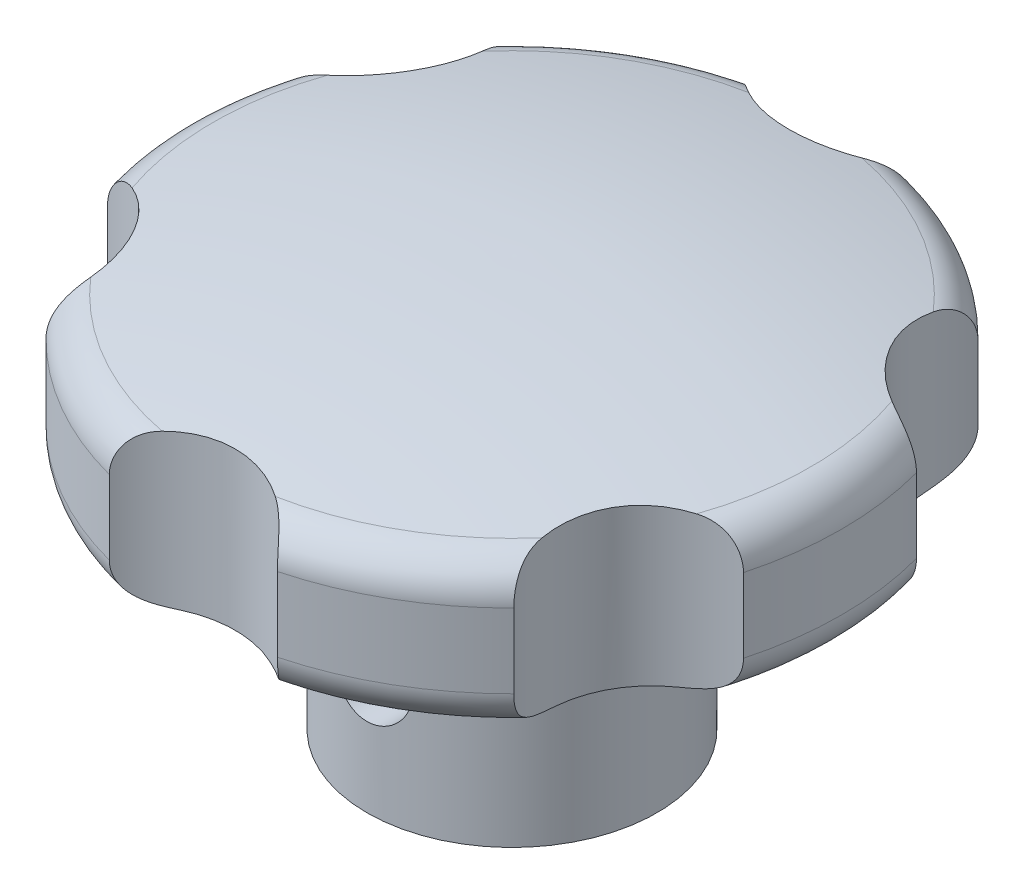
ISO-10303-21;
HEADER;
FILE_DESCRIPTION(('STEP AP214'),'2;1');
FILE_NAME('part.step','',(''),(''),'','','');
FILE_SCHEMA(('AUTOMOTIVE_DESIGN { 1 0 10303 214 1 1 1 1 }'));
ENDSEC;
DATA;
#1=APPLICATION_CONTEXT('core data for automotive mechanical design processes');
#2=APPLICATION_PROTOCOL_DEFINITION('international standard','automotive_design',2000,#1);
#3=PRODUCT_CONTEXT('',#1,'mechanical');
#4=PRODUCT('Part','Part','',(#3));
#5=PRODUCT_RELATED_PRODUCT_CATEGORY('part','',(#4));
#6=PRODUCT_DEFINITION_FORMATION('','',#4);
#7=PRODUCT_DEFINITION_CONTEXT('part definition',#1,'design');
#8=PRODUCT_DEFINITION('design','',#6,#7);
#9=PRODUCT_DEFINITION_SHAPE('','',#8);
#10=(LENGTH_UNIT() NAMED_UNIT(*) SI_UNIT(.MILLI.,.METRE.));
#11=(NAMED_UNIT(*) PLANE_ANGLE_UNIT() SI_UNIT($,.RADIAN.));
#12=(NAMED_UNIT(*) SI_UNIT($,.STERADIAN.) SOLID_ANGLE_UNIT());
#13=UNCERTAINTY_MEASURE_WITH_UNIT(LENGTH_MEASURE(1.E-05),#10,'distance_accuracy_value','');
#14=(GEOMETRIC_REPRESENTATION_CONTEXT(3) GLOBAL_UNCERTAINTY_ASSIGNED_CONTEXT((#13)) GLOBAL_UNIT_ASSIGNED_CONTEXT((#10,
#11,#12)) REPRESENTATION_CONTEXT('',''));
#15=CARTESIAN_POINT('',(0.,0.,0.));
#16=DIRECTION('',(0.,0.,1.));
#17=DIRECTION('',(1.,0.,0.));
#18=AXIS2_PLACEMENT_3D('',#15,#16,#17);
#19=CARTESIAN_POINT('',(0.,0.,0.));
#20=DIRECTION('',(0.,-1.,0.));
#21=DIRECTION('',(0.,0.,-1.));
#22=AXIS2_PLACEMENT_3D('',#19,#20,#21);
#23=CYLINDRICAL_SURFACE('',#22,11.);
#24=CARTESIAN_POINT('',(0.,14.,0.));
#25=DIRECTION('',(0.,-1.,0.));
#26=DIRECTION('',(0.,0.,-1.));
#27=AXIS2_PLACEMENT_3D('',#24,#25,#26);
#28=CIRCLE('',#27,11.);
#29=CARTESIAN_POINT('',(0.,14.,-11.));
#30=VERTEX_POINT('',#29);
#31=EDGE_CURVE('E576',#30,#30,#28,.T.);
#32=ORIENTED_EDGE('',*,*,#31,.T.);
#33=EDGE_LOOP('',(#32));
#34=FACE_BOUND('',#33,.T.);
#35=CARTESIAN_POINT('',(0.,0.,0.));
#36=DIRECTION('',(0.,-1.,0.));
#37=DIRECTION('',(0.,0.,-1.));
#38=AXIS2_PLACEMENT_3D('',#35,#36,#37);
#39=CIRCLE('',#38,11.);
#40=CARTESIAN_POINT('',(0.,0.,-11.));
#41=VERTEX_POINT('',#40);
#42=EDGE_CURVE('E582',#41,#41,#39,.T.);
#43=ORIENTED_EDGE('',*,*,#42,.F.);
#44=EDGE_LOOP('',(#43));
#45=FACE_BOUND('',#44,.T.);
#46=CARTESIAN_POINT('',(0.,6.,11.));
#47=CARTESIAN_POINT('',(-0.165241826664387,6.00000362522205,10.9999976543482));
#48=CARTESIAN_POINT('',(-0.330521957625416,6.01369812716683,10.9962401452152));
#49=CARTESIAN_POINT('',(-0.656311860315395,6.06801166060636,10.981615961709));
#50=CARTESIAN_POINT('',(-0.81681945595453,6.10864278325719,10.97074609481));
#51=CARTESIAN_POINT('',(-1.12831525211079,6.21540346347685,10.9430954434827));
#52=CARTESIAN_POINT('',(-1.27931573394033,6.28149930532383,10.9263224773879));
#53=CARTESIAN_POINT('',(-1.56808899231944,6.43718586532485,10.888633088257));
#54=CARTESIAN_POINT('',(-1.70586072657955,6.52677843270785,10.8677163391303));
#55=CARTESIAN_POINT('',(-1.96759389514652,6.72919967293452,10.8234279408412));
#56=CARTESIAN_POINT('',(-2.09119025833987,6.8424908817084,10.8000128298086));
#57=CARTESIAN_POINT('',(-2.31788587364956,7.0881052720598,10.7536422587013));
#58=CARTESIAN_POINT('',(-2.42098235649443,7.22043102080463,10.7306868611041));
#59=CARTESIAN_POINT('',(-2.60555589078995,7.50330249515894,10.6873876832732));
#60=CARTESIAN_POINT('',(-2.68660853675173,7.65413428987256,10.6670986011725));
#61=CARTESIAN_POINT('',(-2.82205832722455,7.96792765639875,10.6320701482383));
#62=CARTESIAN_POINT('',(-2.87646063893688,8.13088686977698,10.6173297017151));
#63=CARTESIAN_POINT('',(-2.95578912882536,8.46025579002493,10.5955169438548));
#64=CARTESIAN_POINT('',(-2.98137921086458,8.62649389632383,10.5882722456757));
#65=CARTESIAN_POINT('',(-3.00442728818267,8.96104936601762,10.5817565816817));
#66=CARTESIAN_POINT('',(-3.00189080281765,9.12936631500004,10.5824840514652));
#67=CARTESIAN_POINT('',(-2.96928383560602,9.45808310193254,10.5916764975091));
#68=CARTESIAN_POINT('',(-2.94002147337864,9.61857046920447,10.5999143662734));
#69=CARTESIAN_POINT('',(-2.85608967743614,9.93226657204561,10.6228351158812));
#70=CARTESIAN_POINT('',(-2.80141813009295,10.0854747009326,10.6375185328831));
#71=CARTESIAN_POINT('',(-2.66757259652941,10.3823470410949,10.6718723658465));
#72=CARTESIAN_POINT('',(-2.58811903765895,10.5258784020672,10.6915991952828));
#73=CARTESIAN_POINT('',(-2.40715976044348,10.7978528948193,10.7337873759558));
#74=CARTESIAN_POINT('',(-2.30564952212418,10.9262929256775,10.756249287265));
#75=CARTESIAN_POINT('',(-2.07934693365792,11.1690503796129,10.8023178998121));
#76=CARTESIAN_POINT('',(-1.9538772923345,11.2827348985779,10.8259374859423));
#77=CARTESIAN_POINT('',(-1.68536402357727,11.4875819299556,10.8709729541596));
#78=CARTESIAN_POINT('',(-1.54231963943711,11.5787434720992,10.8923887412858));
#79=CARTESIAN_POINT('',(-1.24170790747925,11.7362533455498,10.9307455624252));
#80=CARTESIAN_POINT('',(-1.08407527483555,11.8024826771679,10.9476650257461));
#81=CARTESIAN_POINT('',(-0.759345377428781,11.9073159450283,10.9749671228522));
#82=CARTESIAN_POINT('',(-0.592250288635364,11.9459262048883,10.9853512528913));
#83=CARTESIAN_POINT('',(-0.258736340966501,11.9934212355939,10.9981845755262));
#84=CARTESIAN_POINT('',(-0.0924485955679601,12.0031659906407,11.0008632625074));
#85=CARTESIAN_POINT('',(0.239386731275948,11.9950345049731,10.9986460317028));
#86=CARTESIAN_POINT('',(0.404934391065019,11.977161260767,10.9937509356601));
#87=CARTESIAN_POINT('',(0.727490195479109,11.9150049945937,10.977084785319));
#88=CARTESIAN_POINT('',(0.88459864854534,11.871205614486,10.965439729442));
#89=CARTESIAN_POINT('',(1.18921973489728,11.759005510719,10.9365984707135));
#90=CARTESIAN_POINT('',(1.33673130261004,11.6906020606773,10.9194016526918));
#91=CARTESIAN_POINT('',(1.62128232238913,11.5295671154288,10.8808314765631));
#92=CARTESIAN_POINT('',(1.75804920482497,11.4364730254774,10.8593805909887));
#93=CARTESIAN_POINT('',(2.01432044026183,11.229277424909,10.8147797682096));
#94=CARTESIAN_POINT('',(2.133821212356,11.1151715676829,10.7916294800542));
#95=CARTESIAN_POINT('',(2.35582120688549,10.8651719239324,10.7453880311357));
#96=CARTESIAN_POINT('',(2.45771255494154,10.7287332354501,10.7223188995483));
#97=CARTESIAN_POINT('',(2.63717164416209,10.4402027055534,10.6796005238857));
#98=CARTESIAN_POINT('',(2.71474035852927,10.2881114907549,10.6599511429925));
#99=CARTESIAN_POINT('',(2.84277116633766,9.97331874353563,10.6265249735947));
#100=CARTESIAN_POINT('',(2.8933870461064,9.81068347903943,10.6127149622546));
#101=CARTESIAN_POINT('',(2.9664183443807,9.47876632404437,10.5925362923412));
#102=CARTESIAN_POINT('',(2.98884137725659,9.30948624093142,10.586165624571));
#103=CARTESIAN_POINT('',(3.00439791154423,8.97532319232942,10.5817601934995));
#104=CARTESIAN_POINT('',(2.99851066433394,8.81048882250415,10.5834467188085));
#105=CARTESIAN_POINT('',(2.95989675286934,8.48425870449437,10.5943100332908));
#106=CARTESIAN_POINT('',(2.92717084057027,8.32286286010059,10.6034866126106));
#107=CARTESIAN_POINT('',(2.83638816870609,8.00938736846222,10.6281263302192));
#108=CARTESIAN_POINT('',(2.77854790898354,7.85724049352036,10.6435356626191));
#109=CARTESIAN_POINT('',(2.63934609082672,7.56469344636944,10.6789037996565));
#110=CARTESIAN_POINT('',(2.55798069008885,7.4242951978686,10.6988633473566));
#111=CARTESIAN_POINT('',(2.37110861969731,7.15457880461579,10.7418475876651));
#112=CARTESIAN_POINT('',(2.26493803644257,7.02573259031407,10.7649475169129));
#113=CARTESIAN_POINT('',(2.0327202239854,6.7873671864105,10.8111998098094));
#114=CARTESIAN_POINT('',(1.90666811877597,6.67785275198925,10.834352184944));
#115=CARTESIAN_POINT('',(1.63481545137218,6.47881077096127,10.8787291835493));
#116=CARTESIAN_POINT('',(1.48863173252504,6.38979303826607,10.8998981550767));
#117=CARTESIAN_POINT('',(1.18279979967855,6.23773512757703,10.9373052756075));
#118=CARTESIAN_POINT('',(1.02315990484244,6.17467903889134,10.9535464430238));
#119=CARTESIAN_POINT('',(0.720200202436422,6.08412098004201,10.9772838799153));
#120=CARTESIAN_POINT('',(0.578129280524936,6.0526508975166,10.9857389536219));
#121=CARTESIAN_POINT('',(0.290715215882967,6.01058994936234,10.9970977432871));
#122=CARTESIAN_POINT('',(0.145372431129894,5.9999968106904,11.0000020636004));
#123=CARTESIAN_POINT('',(0.,6.,11.));
#124=B_SPLINE_CURVE_WITH_KNOTS('',3,(#46,#47,#48,#49,#50,#51,#52,#53,#54,#55,#56,#57,#58,#59,
#60,#61,#62,#63,#64,#65,#66,#67,#68,#69,#70,#71,#72,#73,#74,#75,#76,#77,#78,#79,#80,#81,#82,#83,
#84,#85,#86,#87,#88,#89,#90,#91,#92,#93,#94,#95,#96,#97,#98,#99,#100,#101,#102,#103,#104,#105,
#106,#107,#108,#109,#110,#111,#112,#113,#114,#115,#116,#117,#118,#119,#120,#121,#122,#123),
.UNSPECIFIED.,.T.,.F.,(4,2,2,2,2,2,2,2,2,2,2,2,2,2,2,2,2,2,2,2,2,2,2,2,2,2,2,2,2,2,2,2,2,2,2,2,
2,2,4),(0.,0.495192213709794,0.9906068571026,1.48536780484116,1.98016770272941,2.48571756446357,
2.99133567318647,3.50609187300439,4.02074822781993,4.52328609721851,5.02572535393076,
5.51345773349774,6.00123069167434,6.49471853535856,6.98830760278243,7.4987705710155,
8.00925552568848,8.52214699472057,9.03492099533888,9.53225622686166,10.029537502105,
10.5178222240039,11.0061610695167,11.5043893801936,12.0027208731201,12.5158014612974,
13.0288615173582,13.5389619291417,14.0489245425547,14.5413770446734,15.0338157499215,
15.5220911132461,16.0104462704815,16.5137802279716,17.0172378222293,17.532117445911,
18.0466810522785,18.4823766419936,18.9180247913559),.UNSPECIFIED.);
#125=CARTESIAN_POINT('',(0.,6.,11.));
#126=VERTEX_POINT('',#125);
#127=EDGE_CURVE('E231',#126,#126,#124,.T.);
#128=ORIENTED_EDGE('',*,*,#127,.T.);
#129=EDGE_LOOP('',(#128));
#130=FACE_BOUND('',#129,.T.);
#131=CARTESIAN_POINT('',(9.5262794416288,6.,-5.50000000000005));
#132=CARTESIAN_POINT('',(9.60889832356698,6.00000362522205,-5.35689520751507));
#133=CARTESIAN_POINT('',(9.68828429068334,6.01369812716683,-5.21187966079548));
#134=CARTESIAN_POINT('',(9.83851432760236,6.06801166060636,-4.92242523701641));
#135=CARTESIAN_POINT('',(9.9093545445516,6.10864278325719,-4.77798664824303));
#136=CARTESIAN_POINT('',(10.0411562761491,6.21540346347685,-4.49439804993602));
#137=CARTESIAN_POINT('',(10.102130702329,6.28149930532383,-4.35524131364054));
#138=CARTESIAN_POINT('',(10.213877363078,6.43718586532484,-4.08631164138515));
#139=CARTESIAN_POINT('',(10.2646487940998,6.52677843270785,-3.95653944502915));
#140=CARTESIAN_POINT('',(10.357160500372,6.72919967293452,-3.70772767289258));
#141=CARTESIAN_POINT('',(10.398680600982,6.8424908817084,-3.58898252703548));
#142=CARTESIAN_POINT('',(10.4718703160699,7.0881052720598,-3.36947307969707));
#143=CARTESIAN_POINT('',(10.5035386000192,7.22043102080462,-3.268711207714));
#144=CARTESIAN_POINT('',(10.5583271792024,7.50330249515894,-3.08721624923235));
#145=CARTESIAN_POINT('',(10.5812826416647,7.65413428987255,-3.00687805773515));
#146=CARTESIAN_POINT('',(10.6186720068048,7.96792765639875,-2.87206087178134));
#147=CARTESIAN_POINT('',(10.6331075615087,8.13088686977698,-2.81757686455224));
#148=CARTESIAN_POINT('',(10.6538814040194,8.46025579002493,-2.73796999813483));
#149=CARTESIAN_POINT('',(10.6604023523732,8.62649389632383,-2.71218598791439));
#150=CARTESIAN_POINT('',(10.6662836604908,8.96104936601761,-2.6889679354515));
#151=CARTESIAN_POINT('',(10.6656454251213,9.12936631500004,-2.69152833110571));
#152=CARTESIAN_POINT('',(10.6573028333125,9.45808310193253,-2.7243630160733));
#153=CARTESIAN_POINT('',(10.6498058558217,9.61857046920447,-2.7538238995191));
#154=CARTESIAN_POINT('',(10.6276899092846,9.93226657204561,-2.83797134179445));
#155=CARTESIAN_POINT('',(10.613070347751,10.0854747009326,-2.89265999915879));
#156=CARTESIAN_POINT('',(10.5758988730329,10.3823470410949,-3.02575054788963));
#157=CARTESIAN_POINT('',(10.5532560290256,10.5258784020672,-3.10442276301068));
#158=CARTESIAN_POINT('',(10.4993124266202,10.7978528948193,-3.28223218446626));
#159=CARTESIAN_POINT('',(10.4680098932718,10.9262929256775,-3.38137358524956));
#160=CARTESIAN_POINT('',(10.3947551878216,11.1690503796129,-3.60039168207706));
#161=CARTESIAN_POINT('',(10.3524755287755,11.2827348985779,-3.72086137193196));
#162=CARTESIAN_POINT('',(10.2572207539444,11.4875819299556,-3.97591841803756));
#163=CARTESIAN_POINT('',(10.2042451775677,11.5787434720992,-4.11050638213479));
#164=CARTESIAN_POINT('',(10.0871572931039,11.7362533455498,-4.39002218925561));
#165=CARTESIAN_POINT('',(10.0229936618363,11.8024826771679,-4.53499578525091));
#166=CARTESIAN_POINT('',(9.88427302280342,11.9073159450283,-4.82987117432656));
#167=CARTESIAN_POINT('',(9.80971839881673,11.9459262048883,-4.9797718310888));
#168=CARTESIAN_POINT('',(9.65407540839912,11.9934212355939,-5.27502004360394));
#169=CARTESIAN_POINT('',(9.5732513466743,12.0031659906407,-5.42036879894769));
#170=CARTESIAN_POINT('',(9.40541350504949,11.9950345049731,-5.70663800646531));
#171=CARTESIAN_POINT('',(9.31840039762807,11.977161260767,-5.8475589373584));
#172=CARTESIAN_POINT('',(9.1426891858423,11.9150049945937,-6.11856738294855));
#173=CARTESIAN_POINT('',(9.05405004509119,11.871205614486,-6.24880476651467));
#174=CARTESIAN_POINT('',(8.87676223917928,11.759005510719,-6.49819373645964));
#175=CARTESIAN_POINT('',(8.7881135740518,11.6906020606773,-6.61734409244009));
#176=CARTESIAN_POINT('',(8.61243531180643,11.5295671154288,-6.84448741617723));
#177=CARTESIAN_POINT('',(8.52547485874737,11.4364730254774,-6.95220556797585));
#178=CARTESIAN_POINT('',(8.35871379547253,11.229277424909,-7.15184255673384));
#179=CARTESIAN_POINT('',(8.27891467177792,11.1151715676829,-7.24375811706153));
#180=CARTESIAN_POINT('',(8.12786840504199,10.8651719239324,-7.41289502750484));
#181=CARTESIAN_POINT('',(8.05694427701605,10.7287332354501,-7.48960095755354));
#182=CARTESIAN_POINT('',(7.93021953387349,10.4402027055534,-7.62365789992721));
#183=CARTESIAN_POINT('',(7.87441831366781,10.2881114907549,-7.68100968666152));
#184=CARTESIAN_POINT('',(7.78145499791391,9.97331874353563,-7.77517453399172));
#185=CARTESIAN_POINT('',(7.74418723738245,9.81068347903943,-7.81210416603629));
#186=CARTESIAN_POINT('',(7.69019634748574,9.47876632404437,-7.86526179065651));
#187=CARTESIAN_POINT('',(7.67346767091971,9.30948624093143,-7.88149537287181));
#188=CARTESIAN_POINT('',(7.66187418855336,8.97532319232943,-7.89276501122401));
#189=CARTESIAN_POINT('',(7.66627838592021,8.81048882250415,-7.88850976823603));
#190=CARTESIAN_POINT('',(7.69499324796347,8.48425870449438,-7.86050079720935));
#191=CARTESIAN_POINT('',(7.71930335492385,8.32286286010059,-7.83674761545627));
#192=CARTESIAN_POINT('',(7.78603331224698,8.00938736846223,-7.77044737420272));
#193=CARTESIAN_POINT('',(7.82829831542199,7.85724049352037,-7.72806090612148));
#194=CARTESIAN_POINT('',(7.92852892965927,7.56469344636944,-7.62519266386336));
#195=CARTESIAN_POINT('',(7.98649710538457,7.42429519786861,-7.56470793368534));
#196=CARTESIAN_POINT('',(8.11715858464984,7.1545788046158,-7.4243640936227));
#197=CARTESIAN_POINT('',(8.19024900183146,7.02573259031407,-7.34396763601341));
#198=CARTESIAN_POINT('',(8.34641356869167,6.7873671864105,-7.16598725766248));
#199=CARTESIAN_POINT('',(8.42949016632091,6.67785275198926,-7.06839911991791));
#200=CARTESIAN_POINT('',(8.60384810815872,6.47881077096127,-6.85515630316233));
#201=CARTESIAN_POINT('',(8.695272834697,6.38979303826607,-6.73914197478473));
#202=CARTESIAN_POINT('',(8.88058431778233,6.23773512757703,-6.49298731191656));
#203=CARTESIAN_POINT('',(8.97446952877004,6.17467903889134,-6.36285569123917));
#204=CARTESIAN_POINT('',(9.14650660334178,6.08412098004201,-6.11235361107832));
#205=CARTESIAN_POINT('',(9.22486437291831,6.0526508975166,-5.99354412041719));
#206=CARTESIAN_POINT('',(9.3784084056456,6.01058994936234,-5.7503156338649));
#207=CARTESIAN_POINT('',(9.45359501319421,5.9999968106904,-5.62589725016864));
#208=CARTESIAN_POINT('',(9.5262794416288,6.,-5.50000000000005));
#209=B_SPLINE_CURVE_WITH_KNOTS('',3,(#131,#132,#133,#134,#135,#136,#137,#138,#139,#140,#141,
#142,#143,#144,#145,#146,#147,#148,#149,#150,#151,#152,#153,#154,#155,#156,#157,#158,#159,#160,
#161,#162,#163,#164,#165,#166,#167,#168,#169,#170,#171,#172,#173,#174,#175,#176,#177,#178,#179,
#180,#181,#182,#183,#184,#185,#186,#187,#188,#189,#190,#191,#192,#193,#194,#195,#196,#197,#198,
#199,#200,#201,#202,#203,#204,#205,#206,#207,#208),.UNSPECIFIED.,.T.,.F.,(4,2,2,2,2,2,2,2,2,2,2,
2,2,2,2,2,2,2,2,2,2,2,2,2,2,2,2,2,2,2,2,2,2,2,2,2,2,2,4),(0.,0.495192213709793,
0.990606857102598,1.48536780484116,1.98016770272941,2.48571756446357,2.99133567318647,
3.50609187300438,4.02074822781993,4.52328609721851,5.02572535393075,5.51345773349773,
6.00123069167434,6.49471853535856,6.98830760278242,7.4987705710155,8.00925552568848,
8.52214699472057,9.03492099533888,9.53225622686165,10.029537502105,10.5178222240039,
11.0061610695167,11.5043893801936,12.0027208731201,12.5158014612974,13.0288615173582,
13.5389619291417,14.0489245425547,14.5413770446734,15.0338157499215,15.5220911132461,
16.0104462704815,16.5137802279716,17.0172378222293,17.532117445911,18.0466810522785,
18.4823766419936,18.9180247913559),.UNSPECIFIED.);
#210=CARTESIAN_POINT('',(9.5262794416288,6.,-5.50000000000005));
#211=VERTEX_POINT('',#210);
#212=EDGE_CURVE('E419',#211,#211,#209,.T.);
#213=ORIENTED_EDGE('',*,*,#212,.T.);
#214=EDGE_LOOP('',(#213));
#215=FACE_BOUND('',#214,.T.);
#216=ADVANCED_FACE('F39',(#34,#45,#130,#215),#23,.T.);
#217=CARTESIAN_POINT('',(0.,0.,0.));
#218=DIRECTION('',(0.,-1.,0.));
#219=DIRECTION('',(0.,0.,-1.));
#220=AXIS2_PLACEMENT_3D('',#217,#218,#219);
#221=CYLINDRICAL_SURFACE('',#220,5.);
#222=CARTESIAN_POINT('',(0.,18.,0.));
#223=DIRECTION('',(0.,-1.,0.));
#224=DIRECTION('',(0.,0.,-1.));
#225=AXIS2_PLACEMENT_3D('',#222,#223,#224);
#226=CIRCLE('',#225,4.99999999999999);
#227=CARTESIAN_POINT('',(0.,18.,-4.99999999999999));
#228=VERTEX_POINT('',#227);
#229=EDGE_CURVE('E220',#228,#228,#226,.T.);
#230=ORIENTED_EDGE('',*,*,#229,.F.);
#231=EDGE_LOOP('',(#230));
#232=FACE_BOUND('',#231,.T.);
#233=CARTESIAN_POINT('',(0.,0.,0.));
#234=DIRECTION('',(0.,-1.,0.));
#235=DIRECTION('',(0.,0.,-1.));
#236=AXIS2_PLACEMENT_3D('',#233,#234,#235);
#237=CIRCLE('',#236,5.);
#238=CARTESIAN_POINT('',(0.,0.,-5.));
#239=VERTEX_POINT('',#238);
#240=EDGE_CURVE('E224',#239,#239,#237,.T.);
#241=ORIENTED_EDGE('',*,*,#240,.T.);
#242=EDGE_LOOP('',(#241));
#243=FACE_BOUND('',#242,.T.);
#244=CARTESIAN_POINT('',(-3.,9.,3.99999999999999));
#245=CARTESIAN_POINT('',(-2.9999999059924,9.07546161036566,3.99999997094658));
#246=CARTESIAN_POINT('',(-2.99714660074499,9.15091995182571,4.00214560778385));
#247=CARTESIAN_POINT('',(-2.98579602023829,9.30118357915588,4.01061905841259));
#248=CARTESIAN_POINT('',(-2.97729658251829,9.37598860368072,4.01694847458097));
#249=CARTESIAN_POINT('',(-2.94350195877,9.59854240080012,4.04185988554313));
#250=CARTESIAN_POINT('',(-2.90991036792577,9.74446616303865,4.06636523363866));
#251=CARTESIAN_POINT('',(-2.82286888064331,10.026195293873,4.12724466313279));
#252=CARTESIAN_POINT('',(-2.76956233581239,10.1620654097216,4.16353284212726));
#253=CARTESIAN_POINT('',(-2.64505893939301,10.422867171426,4.24371857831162));
#254=CARTESIAN_POINT('',(-2.57385675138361,10.5477955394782,4.28761840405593));
#255=CARTESIAN_POINT('',(-2.40542341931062,10.7999013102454,4.3845721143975));
#256=CARTESIAN_POINT('',(-2.30607419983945,10.9254860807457,4.43808896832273));
#257=CARTESIAN_POINT('',(-2.08854542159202,11.1595253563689,4.54452303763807));
#258=CARTESIAN_POINT('',(-1.97035175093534,11.2679669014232,4.59743977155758));
#259=CARTESIAN_POINT('',(-1.70284578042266,11.4762824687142,4.70351798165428));
#260=CARTESIAN_POINT('',(-1.55155129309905,11.5739664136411,4.75608869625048));
#261=CARTESIAN_POINT('',(-1.31132430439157,11.699746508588,4.82570563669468));
#262=CARTESIAN_POINT('',(-1.22900736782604,11.7382241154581,4.84737661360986));
#263=CARTESIAN_POINT('',(-1.06047221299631,11.8077909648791,4.88701002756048));
#264=CARTESIAN_POINT('',(-0.974256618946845,11.8388850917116,4.90497491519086));
#265=CARTESIAN_POINT('',(-0.806968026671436,11.8906274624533,4.93511193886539));
#266=CARTESIAN_POINT('',(-0.726184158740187,11.9119872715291,4.94767216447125));
#267=CARTESIAN_POINT('',(-0.56266634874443,11.947949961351,4.96892323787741));
#268=CARTESIAN_POINT('',(-0.479933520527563,11.9625566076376,4.97761624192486));
#269=CARTESIAN_POINT('',(-0.313244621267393,11.9847846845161,4.99087754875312));
#270=CARTESIAN_POINT('',(-0.229289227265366,11.9924098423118,4.99544805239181));
#271=CARTESIAN_POINT('',(-0.0609397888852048,12.0005666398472,5.00033941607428));
#272=CARTESIAN_POINT('',(0.0234542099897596,12.0010990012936,5.00066070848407));
#273=CARTESIAN_POINT('',(0.255171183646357,11.9927572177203,4.99565270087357));
#274=CARTESIAN_POINT('',(0.402219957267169,11.9765288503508,4.98590479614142));
#275=CARTESIAN_POINT('',(0.690956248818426,11.9230445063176,4.95416390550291));
#276=CARTESIAN_POINT('',(0.832643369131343,11.8857869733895,4.93217001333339));
#277=CARTESIAN_POINT('',(1.10810607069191,11.791667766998,4.87769707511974));
#278=CARTESIAN_POINT('',(1.2418309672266,11.7346935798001,4.84515792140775));
#279=CARTESIAN_POINT('',(1.49797933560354,11.6032310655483,4.77219304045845));
#280=CARTESIAN_POINT('',(1.62039986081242,11.5287381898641,4.73176526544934));
#281=CARTESIAN_POINT('',(1.86614789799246,11.3543217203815,4.64075842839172));
#282=CARTESIAN_POINT('',(1.98783715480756,11.2524233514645,4.58954363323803));
#283=CARTESIAN_POINT('',(2.2134294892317,11.0311917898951,4.48511110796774));
#284=CARTESIAN_POINT('',(2.31730807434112,10.9118350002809,4.4318907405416));
#285=CARTESIAN_POINT('',(2.51649670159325,10.6426931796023,4.32222149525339));
#286=CARTESIAN_POINT('',(2.60941864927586,10.4909848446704,4.26611322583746));
#287=CARTESIAN_POINT('',(2.76794435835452,10.1705875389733,4.16501759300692));
#288=CARTESIAN_POINT('',(2.83359844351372,10.0019305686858,4.12000980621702));
#289=CARTESIAN_POINT('',(2.92154993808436,9.69521273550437,4.05791730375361));
#290=CARTESIAN_POINT('',(2.95055806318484,9.55991873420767,4.03667777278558));
#291=CARTESIAN_POINT('',(2.98961745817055,9.28525278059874,4.00784301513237));
#292=CARTESIAN_POINT('',(2.9996907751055,9.14588576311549,4.00023192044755));
#293=CARTESIAN_POINT('',(3.00029561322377,8.86689663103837,3.9997782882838));
#294=CARTESIAN_POINT('',(2.99080006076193,8.72727443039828,4.00695621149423));
#295=CARTESIAN_POINT('',(2.95280584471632,8.45202532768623,4.03503040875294));
#296=CARTESIAN_POINT('',(2.92429216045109,8.31640167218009,4.05593752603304));
#297=CARTESIAN_POINT('',(2.84976612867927,8.05257078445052,4.1086353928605));
#298=CARTESIAN_POINT('',(2.80377564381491,7.92435451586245,4.14041253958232));
#299=CARTESIAN_POINT('',(2.69592568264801,7.67704477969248,4.21143069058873));
#300=CARTESIAN_POINT('',(2.63406022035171,7.5579547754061,4.25067450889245));
#301=CARTESIAN_POINT('',(2.48334675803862,7.30951890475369,4.34073681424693));
#302=CARTESIAN_POINT('',(2.391645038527,7.18219456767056,4.39236652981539));
#303=CARTESIAN_POINT('',(2.18975614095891,6.94343279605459,4.49643335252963));
#304=CARTESIAN_POINT('',(2.07955127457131,6.83201075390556,4.54887118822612));
#305=CARTESIAN_POINT('',(1.82651475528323,6.61353600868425,4.65671991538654));
#306=CARTESIAN_POINT('',(1.68130397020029,6.50893529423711,4.71163080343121));
#307=CARTESIAN_POINT('',(1.44944631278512,6.37184550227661,4.78599458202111));
#308=CARTESIAN_POINT('',(1.36978605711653,6.32943799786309,4.80945640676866));
#309=CARTESIAN_POINT('',(1.20623656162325,6.25169611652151,4.85305400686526));
#310=CARTESIAN_POINT('',(1.12235002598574,6.2163572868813,4.87319187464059));
#311=CARTESIAN_POINT('',(0.95714069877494,6.15552035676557,4.9082066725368));
#312=CARTESIAN_POINT('',(0.876069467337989,6.12949628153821,4.9233583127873));
#313=CARTESIAN_POINT('',(0.711460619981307,6.08433501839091,4.94982497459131));
#314=CARTESIAN_POINT('',(0.627924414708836,6.06519397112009,4.96114214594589));
#315=CARTESIAN_POINT('',(0.459119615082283,6.0340996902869,4.9795990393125));
#316=CARTESIAN_POINT('',(0.373852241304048,6.02214156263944,4.98674160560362));
#317=CARTESIAN_POINT('',(0.202384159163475,6.00559323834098,4.99664216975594));
#318=CARTESIAN_POINT('',(0.11618357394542,6.00100208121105,4.99940073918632));
#319=CARTESIAN_POINT('',(-0.119519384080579,5.99867171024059,5.00079353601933));
#320=CARTESIAN_POINT('',(-0.269213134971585,6.0083989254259,4.9949361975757));
#321=CARTESIAN_POINT('',(-0.564325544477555,6.04978205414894,4.97026391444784));
#322=CARTESIAN_POINT('',(-0.709744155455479,6.08143821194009,4.95144882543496));
#323=CARTESIAN_POINT('',(-0.990283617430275,6.16444057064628,4.90298726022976));
#324=CARTESIAN_POINT('',(-1.1255320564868,6.215463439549,4.87351900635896));
#325=CARTESIAN_POINT('',(-1.38556595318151,6.33528094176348,4.8060670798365));
#326=CARTESIAN_POINT('',(-1.51034905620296,6.40407956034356,4.76808149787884));
#327=CARTESIAN_POINT('',(-1.76052652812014,6.56584990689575,4.68186861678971));
#328=CARTESIAN_POINT('',(-1.88451663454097,6.66063506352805,4.63297714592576));
#329=CARTESIAN_POINT('',(-2.11579577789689,6.86750842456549,4.53203789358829));
#330=CARTESIAN_POINT('',(-2.22306604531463,6.97961579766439,4.47998665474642));
#331=CARTESIAN_POINT('',(-2.43181699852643,7.23456104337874,4.37056449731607));
#332=CARTESIAN_POINT('',(-2.53083841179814,7.37949308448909,4.31335603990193));
#333=CARTESIAN_POINT('',(-2.70314606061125,7.68700957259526,4.20752457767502));
#334=CARTESIAN_POINT('',(-2.77644567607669,7.84958478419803,4.15889711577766));
#335=CARTESIAN_POINT('',(-2.86193484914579,8.09662255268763,4.10004730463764));
#336=CARTESIAN_POINT('',(-2.88571236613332,8.17565859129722,4.0832950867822));
#337=CARTESIAN_POINT('',(-2.92679381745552,8.33613044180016,4.05395087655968));
#338=CARTESIAN_POINT('',(-2.94410184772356,8.41756469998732,4.04135625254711));
#339=CARTESIAN_POINT('',(-2.97191221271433,8.58204655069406,4.0209497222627));
#340=CARTESIAN_POINT('',(-2.98242533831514,8.66509136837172,4.01313023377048));
#341=CARTESIAN_POINT('',(-2.99646884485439,8.83209221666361,4.00265571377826));
#342=CARTESIAN_POINT('',(-3.00000010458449,8.91604813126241,4.00000003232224));
#343=CARTESIAN_POINT('',(-3.,9.,3.99999999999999));
#344=B_SPLINE_CURVE_WITH_KNOTS('',3,(#244,#245,#246,#247,#248,#249,#250,#251,#252,#253,#254,
#255,#256,#257,#258,#259,#260,#261,#262,#263,#264,#265,#266,#267,#268,#269,#270,#271,#272,#273,
#274,#275,#276,#277,#278,#279,#280,#281,#282,#283,#284,#285,#286,#287,#288,#289,#290,#291,#292,
#293,#294,#295,#296,#297,#298,#299,#300,#301,#302,#303,#304,#305,#306,#307,#308,#309,#310,#311,
#312,#313,#314,#315,#316,#317,#318,#319,#320,#321,#322,#323,#324,#325,#326,#327,#328,#329,#330,
#331,#332,#333,#334,#335,#336,#337,#338,#339,#340,#341,#342,#343),.UNSPECIFIED.,.T.,.F.,(4,2,2,
2,2,2,2,2,2,2,2,2,2,2,2,2,2,2,2,2,2,2,2,2,2,2,2,2,2,2,2,2,2,2,2,2,2,2,2,2,2,2,2,2,2,2,2,2,2,4),
(0.,0.226288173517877,0.452663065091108,0.905305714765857,1.35471981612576,1.80426809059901,
2.30878181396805,2.81367513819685,3.37309572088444,3.65297634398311,3.93267130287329,
4.18580566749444,4.43879871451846,4.69165661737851,4.94448879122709,5.38694235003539,
5.82942865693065,6.27448283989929,6.71965270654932,7.21799594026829,7.71701907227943,
8.27387316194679,8.82969494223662,9.24786570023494,9.66554925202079,10.0838110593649,
10.5024036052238,10.9204742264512,11.3387027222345,11.8323285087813,12.3264288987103,
12.884776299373,13.1641700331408,13.4433872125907,13.7024631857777,13.9613936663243,
14.2201475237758,14.4788676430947,14.9267946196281,15.3747265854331,15.8154875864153,
16.2563474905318,16.7450674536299,17.2343321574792,17.7856420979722,18.3366648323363,
18.5890061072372,18.8411873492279,19.0929671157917,19.3447151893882),.UNSPECIFIED.);
#345=CARTESIAN_POINT('',(-3.,9.,3.99999999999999));
#346=VERTEX_POINT('',#345);
#347=EDGE_CURVE('E412',#346,#346,#344,.T.);
#348=ORIENTED_EDGE('',*,*,#347,.F.);
#349=EDGE_LOOP('',(#348));
#350=FACE_BOUND('',#349,.T.);
#351=CARTESIAN_POINT('',(4.96410161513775,9.,0.598076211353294));
#352=CARTESIAN_POINT('',(4.96410154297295,9.07546161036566,0.598076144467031));
#353=CARTESIAN_POINT('',(4.96453306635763,9.15091995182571,0.594532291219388));
#354=CARTESIAN_POINT('',(4.96619599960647,9.30118357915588,0.580465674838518));
#355=CARTESIAN_POINT('',(4.96742771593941,9.37598860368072,0.569940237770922));
#356=CARTESIAN_POINT('',(4.97210431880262,9.59854240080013,0.52821752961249));
#357=CARTESIAN_POINT('',(4.97653077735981,9.74446616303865,0.486873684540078));
#358=CARTESIAN_POINT('',(4.9857331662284,10.026195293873,0.381053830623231));
#359=CARTESIAN_POINT('',(4.99050637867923,10.1620654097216,0.316744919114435));
#360=CARTESIAN_POINT('',(4.99769756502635,10.422867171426,0.168828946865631));
#361=CARTESIAN_POINT('',(5.00011483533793,10.5477955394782,0.0852161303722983));
#362=CARTESIAN_POINT('',(4.99986254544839,10.7999013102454,-0.109128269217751));
#363=CARTESIAN_POINT('',(4.99653489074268,10.9254860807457,-0.221925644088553));
#364=CARTESIAN_POINT('',(4.97994510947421,11.1595253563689,-0.46352812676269));
#365=CARTESIAN_POINT('',(4.96667551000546,11.2679669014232,-0.592345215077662));
#366=CARTESIAN_POINT('',(4.92478894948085,11.4762824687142,-0.877051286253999));
#367=CARTESIAN_POINT('',(4.89466928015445,11.5739664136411,-1.03436151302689));
#368=CARTESIAN_POINT('',(4.83484582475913,11.699746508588,-1.27721265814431));
#369=CARTESIAN_POINT('',(4.81245497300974,11.7382241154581,-1.35933670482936));
#370=CARTESIAN_POINT('',(4.76251093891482,11.8077909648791,-1.52510913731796));
#371=CARTESIAN_POINT('',(4.73496119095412,11.8388850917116,-1.60875647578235));
#372=CARTESIAN_POINT('',(4.67741632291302,11.8906274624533,-1.76870115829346));
#373=CARTESIAN_POINT('',(4.64790186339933,11.9119872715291,-1.84494215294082));
#374=CARTESIAN_POINT('',(4.58454692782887,11.947949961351,-1.99717826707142));
#375=CARTESIAN_POINT('',(4.55070887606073,11.9625566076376,-2.07317350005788));
#376=CARTESIAN_POINT('',(4.47884905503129,11.9847846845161,-2.22416097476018));
#377=CARTESIAN_POINT('',(4.44082953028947,11.9924098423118,-2.29915373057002));
#378=CARTESIAN_POINT('',(4.36089085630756,12.0005666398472,-2.44739430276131));
#379=CARTESIAN_POINT('',(4.318972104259,12.0010990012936,-2.52064229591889));
#380=CARTESIAN_POINT('',(4.19877655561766,11.9927572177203,-2.7188110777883));
#381=CARTESIAN_POINT('',(4.11681023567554,11.9765288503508,-2.84128509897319));
#382=CARTESIAN_POINT('',(3.94495367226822,11.9230445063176,-3.07546761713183));
#383=CARTESIAN_POINT('',(3.85506284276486,11.8857869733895,-3.18717531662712));
#384=CARTESIAN_POINT('',(3.67015654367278,11.791667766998,-3.39849654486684));
#385=CARTESIAN_POINT('',(3.57511436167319,11.7346935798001,-3.49803612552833));
#386=CARTESIAN_POINT('',(3.38385073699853,11.6032310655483,-3.68338467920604));
#387=CARTESIAN_POINT('',(3.28762899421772,11.5287381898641,-3.76919007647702));
#388=CARTESIAN_POINT('',(3.08594074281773,11.3543217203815,-3.93651070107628));
#389=CARTESIAN_POINT('',(2.98074280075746,11.2524233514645,-4.01628929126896));
#390=CARTESIAN_POINT('',(2.77750541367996,11.0311917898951,-4.15944172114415));
#391=CARTESIAN_POINT('',(2.67947593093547,10.9118350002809,-4.22279303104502));
#392=CARTESIAN_POINT('',(2.48490526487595,10.6426931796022,-4.34046081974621));
#393=CARTESIAN_POINT('',(2.38985310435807,10.4909848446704,-4.39287945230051));
#394=CARTESIAN_POINT('',(2.22303886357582,10.1705875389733,-4.4796189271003));
#395=CARTESIAN_POINT('',(2.15123393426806,10.0019305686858,-4.51397313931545));
#396=CARTESIAN_POINT('',(2.05348450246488,9.69521273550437,-4.55909511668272));
#397=CARTESIAN_POINT('',(2.02058646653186,9.55991873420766,-4.57359712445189));
#398=CARTESIAN_POINT('',(1.97608513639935,9.28525278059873,-4.59300617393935));
#399=CARTESIAN_POINT('',(1.96445707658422,9.14588576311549,-4.59792437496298));
#400=CARTESIAN_POINT('',(1.96376180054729,8.86689663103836,-4.5982213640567));
#401=CARTESIAN_POINT('',(1.97472584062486,8.72727443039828,-4.59358693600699));
#402=CARTESIAN_POINT('',(2.01803591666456,8.45202532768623,-4.57472007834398));
#403=CARTESIAN_POINT('',(2.05039885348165,8.31640167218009,-4.56048006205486));
#404=CARTESIAN_POINT('',(2.13329956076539,8.05257078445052,-4.52228755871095));
#405=CARTESIAN_POINT('',(2.18381461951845,7.92435451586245,-4.49834720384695));
#406=CARTESIAN_POINT('',(2.29924312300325,7.67704477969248,-4.44045547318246));
#407=CARTESIAN_POINT('',(2.36416199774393,7.5579547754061,-4.40650032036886));
#408=CARTESIAN_POINT('',(2.51751497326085,7.30951890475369,-4.32100978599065));
#409=CARTESIAN_POINT('',(2.6080784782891,7.18219456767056,-4.2674086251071));
#410=CARTESIAN_POINT('',(2.79914743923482,6.94343279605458,-4.14460112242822));
#411=CARTESIAN_POINT('',(2.89966237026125,6.83201075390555,-4.07537982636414));
#412=CARTESIAN_POINT('',(3.11958036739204,6.61353600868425,-3.91016813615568));
#413=CARTESIAN_POINT('',(3.23973998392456,6.50893529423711,-3.81186735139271));
#414=CARTESIAN_POINT('',(3.42006973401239,6.3718455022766,-3.64825461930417));
#415=CARTESIAN_POINT('',(3.48021839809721,6.32943799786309,-3.59099772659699));
#416=CARTESIAN_POINT('',(3.59974977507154,6.25169611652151,-3.47115850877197));
#417=CARTESIAN_POINT('',(3.65913294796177,6.2163572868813,-3.40857957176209));
#418=CARTESIAN_POINT('',(3.77206131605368,6.15552035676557,-3.2830114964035));
#419=CARTESIAN_POINT('',(3.82571863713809,6.12949628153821,-3.22037757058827));
#420=CARTESIAN_POINT('',(3.93094386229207,6.08433501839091,-3.09105545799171));
#421=CARTESIAN_POINT('',(3.98251292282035,6.06519397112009,-3.02436956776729));
#422=CARTESIAN_POINT('',(4.08289946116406,6.0340996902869,-2.88740876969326));
#423=CARTESIAN_POINT('',(4.1317187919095,6.02214156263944,-2.81713634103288));
#424=CARTESIAN_POINT('',(4.22602697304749,6.00559323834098,-2.67359090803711));
#425=CARTESIAN_POINT('',(4.27151625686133,6.00100208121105,-2.60031829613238));
#426=CARTESIAN_POINT('',(4.39057393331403,5.9986717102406,-2.39688994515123));
#427=CARTESIAN_POINT('',(4.46034820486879,6.0083989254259,-2.26432268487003));
#428=CARTESIAN_POINT('',(4.58653758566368,6.04978205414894,-1.99641169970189));
#429=CARTESIAN_POINT('',(4.64295254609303,6.08143821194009,-1.86106794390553));
#430=CARTESIAN_POINT('',(4.74125333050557,6.16444057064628,-1.59388286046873));
#431=CARTESIAN_POINT('',(4.78335729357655,6.215463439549,-1.46202014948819));
#432=CARTESIAN_POINT('',(4.85495916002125,6.33528094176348,-1.20309822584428));
#433=CARTESIAN_POINT('',(4.88445423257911,6.40407956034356,-1.07604009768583));
#434=CARTESIAN_POINT('',(4.93488042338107,6.56584990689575,-0.816273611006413));
#435=CARTESIAN_POINT('',(4.95453422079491,6.66063506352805,-0.684449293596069));
#436=CARTESIAN_POINT('',(4.98275783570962,6.86750842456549,-0.433686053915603));
#437=CARTESIAN_POINT('',(4.99131527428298,6.97961579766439,-0.314761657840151));
#438=CARTESIAN_POINT('',(5.0009283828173,7.23456104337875,-0.0792669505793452));
#439=CARTESIAN_POINT('',(5.00089511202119,7.3794930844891,0.0350923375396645));
#440=CARTESIAN_POINT('',(4.99539620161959,7.68700957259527,0.23723086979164));
#441=CARTESIAN_POINT('',(4.98993339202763,7.84958478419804,0.325023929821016));
#442=CARTESIAN_POINT('',(4.98171254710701,8.09662255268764,0.428484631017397));
#443=CARTESIAN_POINT('',(4.97909345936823,8.17565859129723,0.457452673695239));
#444=CARTESIAN_POINT('',(4.97422135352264,8.33613044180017,0.507702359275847));
#445=CARTESIAN_POINT('',(4.97196810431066,8.41756469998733,0.528988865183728));
#446=CARTESIAN_POINT('',(4.96820071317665,8.58204655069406,0.563276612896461));
#447=CARTESIAN_POINT('',(4.96668540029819,8.66509136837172,0.576290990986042));
#448=CARTESIAN_POINT('',(4.9646359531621,8.83209221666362,0.593690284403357));
#449=CARTESIAN_POINT('',(4.96410169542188,8.91604813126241,0.598076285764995));
#450=CARTESIAN_POINT('',(4.96410161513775,9.,0.598076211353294));
#451=B_SPLINE_CURVE_WITH_KNOTS('',3,(#351,#352,#353,#354,#355,#356,#357,#358,#359,#360,#361,
#362,#363,#364,#365,#366,#367,#368,#369,#370,#371,#372,#373,#374,#375,#376,#377,#378,#379,#380,
#381,#382,#383,#384,#385,#386,#387,#388,#389,#390,#391,#392,#393,#394,#395,#396,#397,#398,#399,
#400,#401,#402,#403,#404,#405,#406,#407,#408,#409,#410,#411,#412,#413,#414,#415,#416,#417,#418,
#419,#420,#421,#422,#423,#424,#425,#426,#427,#428,#429,#430,#431,#432,#433,#434,#435,#436,#437,
#438,#439,#440,#441,#442,#443,#444,#445,#446,#447,#448,#449,#450),.UNSPECIFIED.,.T.,.F.,(4,2,2,
2,2,2,2,2,2,2,2,2,2,2,2,2,2,2,2,2,2,2,2,2,2,2,2,2,2,2,2,2,2,2,2,2,2,2,2,2,2,2,2,2,2,2,2,2,2,4),
(0.,0.226288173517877,0.452663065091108,0.905305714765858,1.35471981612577,1.80426809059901,
2.30878181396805,2.81367513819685,3.37309572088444,3.65297634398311,3.93267130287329,
4.18580566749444,4.43879871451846,4.69165661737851,4.94448879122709,5.38694235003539,
5.82942865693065,6.27448283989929,6.71965270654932,7.21799594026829,7.71701907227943,
8.27387316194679,8.82969494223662,9.24786570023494,9.6655492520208,10.0838110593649,
10.5024036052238,10.9204742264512,11.3387027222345,11.8323285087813,12.3264288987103,
12.884776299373,13.1641700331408,13.4433872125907,13.7024631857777,13.9613936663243,
14.2201475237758,14.4788676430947,14.9267946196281,15.3747265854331,15.8154875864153,
16.2563474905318,16.7450674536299,17.2343321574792,17.7856420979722,18.3366648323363,
18.5890061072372,18.8411873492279,19.0929671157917,19.3447151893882),.UNSPECIFIED.);
#452=CARTESIAN_POINT('',(4.96410161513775,9.,0.598076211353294));
#453=VERTEX_POINT('',#452);
#454=EDGE_CURVE('E44',#453,#453,#451,.T.);
#455=ORIENTED_EDGE('',*,*,#454,.F.);
#456=EDGE_LOOP('',(#455));
#457=FACE_BOUND('',#456,.T.);
#458=ADVANCED_FACE('F420',(#232,#243,#350,#457),#221,.F.);
#459=CARTESIAN_POINT('',(0.,0.,0.));
#460=DIRECTION('',(0.,-1.,0.));
#461=DIRECTION('',(0.,0.,-1.));
#462=AXIS2_PLACEMENT_3D('',#459,#460,#461);
#463=CYLINDRICAL_SURFACE('',#462,25.);
#464=DIRECTION('',(0.,-1.,0.));
#465=VECTOR('',#464,1.);
#466=CARTESIAN_POINT('',(-24.1235329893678,24.0011569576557,6.56164279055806));
#467=LINE('',#466,#465);
#468=CARTESIAN_POINT('',(-24.1235329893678,25.6303723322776,6.56164279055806));
#469=VERTEX_POINT('',#468);
#470=CARTESIAN_POINT('',(-24.1235329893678,20.,6.56164279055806));
#471=VERTEX_POINT('',#470);
#472=EDGE_CURVE('E645',#469,#471,#467,.T.);
#473=ORIENTED_EDGE('',*,*,#472,.F.);
#474=CARTESIAN_POINT('',(0.,25.6303723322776,0.));
#475=DIRECTION('',(0.,1.,0.));
#476=DIRECTION('',(0.,0.,1.));
#477=AXIS2_PLACEMENT_3D('',#474,#475,#476);
#478=CIRCLE('',#477,25.);
#479=CARTESIAN_POINT('',(-24.123532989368,25.6303723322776,-6.56164279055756));
#480=VERTEX_POINT('',#479);
#481=EDGE_CURVE('E503',#469,#480,#478,.F.);
#482=ORIENTED_EDGE('',*,*,#481,.T.);
#483=DIRECTION('',(0.,-1.,0.));
#484=VECTOR('',#483,1.);
#485=CARTESIAN_POINT('',(-24.123532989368,24.0011569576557,-6.56164279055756));
#486=LINE('',#485,#484);
#487=CARTESIAN_POINT('',(-24.123532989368,20.,-6.56164279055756));
#488=VERTEX_POINT('',#487);
#489=EDGE_CURVE('E379',#488,#480,#486,.F.);
#490=ORIENTED_EDGE('',*,*,#489,.F.);
#491=CARTESIAN_POINT('',(0.,20.,0.));
#492=DIRECTION('',(0.,-1.,0.));
#493=DIRECTION('',(0.,0.,-1.));
#494=AXIS2_PLACEMENT_3D('',#491,#492,#493);
#495=CIRCLE('',#494,25.);
#496=EDGE_CURVE('E508',#488,#471,#495,.F.);
#497=ORIENTED_EDGE('',*,*,#496,.T.);
#498=EDGE_LOOP('',(#473,#482,#490,#497));
#499=FACE_BOUND('',#498,.T.);
#500=ADVANCED_FACE('F450',(#499),#463,.T.);
#501=DIRECTION('',(0.,-1.,0.));
#502=VECTOR('',#501,1.);
#503=CARTESIAN_POINT('',(-17.7443158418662,24.0011569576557,-17.6107710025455));
#504=LINE('',#503,#502);
#505=CARTESIAN_POINT('',(-17.7443158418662,25.6303723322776,-17.6107710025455));
#506=VERTEX_POINT('',#505);
#507=CARTESIAN_POINT('',(-17.7443158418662,20.,-17.6107710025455));
#508=VERTEX_POINT('',#507);
#509=EDGE_CURVE('E932',#506,#508,#504,.T.);
#510=ORIENTED_EDGE('',*,*,#509,.F.);
#511=CARTESIAN_POINT('',(-6.37921714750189,25.6303723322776,-24.1724137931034));
#512=VERTEX_POINT('',#511);
#513=EDGE_CURVE('E510',#506,#512,#478,.F.);
#514=ORIENTED_EDGE('',*,*,#513,.T.);
#515=DIRECTION('',(0.,-1.,0.));
#516=VECTOR('',#515,1.);
#517=CARTESIAN_POINT('',(-6.3792171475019,24.0011569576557,-24.1724137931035));
#518=LINE('',#517,#516);
#519=CARTESIAN_POINT('',(-6.3792171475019,20.,-24.1724137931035));
#520=VERTEX_POINT('',#519);
#521=EDGE_CURVE('E63',#520,#512,#518,.F.);
#522=ORIENTED_EDGE('',*,*,#521,.F.);
#523=EDGE_CURVE('E605',#520,#508,#495,.F.);
#524=ORIENTED_EDGE('',*,*,#523,.T.);
#525=EDGE_LOOP('',(#510,#514,#522,#524));
#526=FACE_BOUND('',#525,.T.);
#527=ADVANCED_FACE('F459',(#526),#463,.T.);
#528=DIRECTION('',(0.,-1.,0.));
#529=VECTOR('',#528,1.);
#530=CARTESIAN_POINT('',(6.3792171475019,24.0011569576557,-24.1724137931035));
#531=LINE('',#530,#529);
#532=CARTESIAN_POINT('',(6.37921714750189,25.6303723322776,-24.1724137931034));
#533=VERTEX_POINT('',#532);
#534=CARTESIAN_POINT('',(6.3792171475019,20.,-24.1724137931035));
#535=VERTEX_POINT('',#534);
#536=EDGE_CURVE('E527',#533,#535,#531,.T.);
#537=ORIENTED_EDGE('',*,*,#536,.F.);
#538=CARTESIAN_POINT('',(17.7443158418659,25.6303723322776,-17.6107710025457));
#539=VERTEX_POINT('',#538);
#540=EDGE_CURVE('E495',#533,#539,#478,.F.);
#541=ORIENTED_EDGE('',*,*,#540,.T.);
#542=DIRECTION('',(0.,-1.,0.));
#543=VECTOR('',#542,1.);
#544=CARTESIAN_POINT('',(17.7443158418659,24.0011569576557,-17.6107710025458));
#545=LINE('',#544,#543);
#546=CARTESIAN_POINT('',(17.7443158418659,20.,-17.6107710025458));
#547=VERTEX_POINT('',#546);
#548=EDGE_CURVE('E338',#547,#539,#545,.F.);
#549=ORIENTED_EDGE('',*,*,#548,.F.);
#550=EDGE_CURVE('E602',#547,#535,#495,.F.);
#551=ORIENTED_EDGE('',*,*,#550,.T.);
#552=EDGE_LOOP('',(#537,#541,#549,#551));
#553=FACE_BOUND('',#552,.T.);
#554=ADVANCED_FACE('F470',(#553),#463,.T.);
#555=DIRECTION('',(0.,-1.,0.));
#556=VECTOR('',#555,1.);
#557=CARTESIAN_POINT('',(24.1235329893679,24.0011569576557,-6.5616427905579));
#558=LINE('',#557,#556);
#559=CARTESIAN_POINT('',(24.1235329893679,25.6303723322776,-6.5616427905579));
#560=VERTEX_POINT('',#559);
#561=CARTESIAN_POINT('',(24.1235329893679,20.,-6.5616427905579));
#562=VERTEX_POINT('',#561);
#563=EDGE_CURVE('E331',#560,#562,#558,.T.);
#564=ORIENTED_EDGE('',*,*,#563,.F.);
#565=CARTESIAN_POINT('',(24.1235329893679,25.6303723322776,6.56164279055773));
#566=VERTEX_POINT('',#565);
#567=EDGE_CURVE('E488',#560,#566,#478,.F.);
#568=ORIENTED_EDGE('',*,*,#567,.T.);
#569=DIRECTION('',(0.,-1.,0.));
#570=VECTOR('',#569,1.);
#571=CARTESIAN_POINT('',(24.1235329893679,24.0011569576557,6.56164279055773));
#572=LINE('',#571,#570);
#573=CARTESIAN_POINT('',(24.1235329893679,20.,6.56164279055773));
#574=VERTEX_POINT('',#573);
#575=EDGE_CURVE('E559',#574,#566,#572,.F.);
#576=ORIENTED_EDGE('',*,*,#575,.F.);
#577=EDGE_CURVE('E604',#574,#562,#495,.F.);
#578=ORIENTED_EDGE('',*,*,#577,.T.);
#579=EDGE_LOOP('',(#564,#568,#576,#578));
#580=FACE_BOUND('',#579,.T.);
#581=ADVANCED_FACE('F462',(#580),#463,.T.);
#582=DIRECTION('',(0.,-1.,0.));
#583=VECTOR('',#582,1.);
#584=CARTESIAN_POINT('',(17.744315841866,24.0011569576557,17.6107710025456));
#585=LINE('',#584,#583);
#586=CARTESIAN_POINT('',(17.744315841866,25.6303723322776,17.6107710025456));
#587=VERTEX_POINT('',#586);
#588=CARTESIAN_POINT('',(17.744315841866,20.,17.6107710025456));
#589=VERTEX_POINT('',#588);
#590=EDGE_CURVE('E246',#587,#589,#585,.T.);
#591=ORIENTED_EDGE('',*,*,#590,.F.);
#592=CARTESIAN_POINT('',(6.37921714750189,25.6303723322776,24.1724137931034));
#593=VERTEX_POINT('',#592);
#594=EDGE_CURVE('E476',#587,#593,#478,.F.);
#595=ORIENTED_EDGE('',*,*,#594,.T.);
#596=DIRECTION('',(0.,-1.,0.));
#597=VECTOR('',#596,1.);
#598=CARTESIAN_POINT('',(6.3792171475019,24.0011569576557,24.1724137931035));
#599=LINE('',#598,#597);
#600=CARTESIAN_POINT('',(6.37921714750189,20.,24.1724137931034));
#601=VERTEX_POINT('',#600);
#602=EDGE_CURVE('E664',#601,#593,#599,.F.);
#603=ORIENTED_EDGE('',*,*,#602,.F.);
#604=EDGE_CURVE('E479',#601,#589,#495,.F.);
#605=ORIENTED_EDGE('',*,*,#604,.T.);
#606=EDGE_LOOP('',(#591,#595,#603,#605));
#607=FACE_BOUND('',#606,.T.);
#608=ADVANCED_FACE('F451',(#607),#463,.T.);
#609=CARTESIAN_POINT('',(0.,20.,0.));
#610=DIRECTION('',(0.,-1.,0.));
#611=DIRECTION('',(0.,0.,-1.));
#612=AXIS2_PLACEMENT_3D('',#609,#610,#611);
#613=TOROIDAL_SURFACE('',#612,22.,3.);
#614=CARTESIAN_POINT('',(-24.123532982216,20.0002,6.56164279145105));
#615=CARTESIAN_POINT('',(-24.1235467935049,19.9221100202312,6.56164966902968));
#616=CARTESIAN_POINT('',(-24.1202733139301,19.8440231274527,6.5620500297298));
#617=CARTESIAN_POINT('',(-24.1072147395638,19.6884076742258,6.56369236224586));
#618=CARTESIAN_POINT('',(-24.0974299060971,19.6108790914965,6.56493430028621));
#619=CARTESIAN_POINT('',(-24.0714231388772,19.4569944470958,6.56831292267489));
#620=CARTESIAN_POINT('',(-24.0552069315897,19.3806374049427,6.57044881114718));
#621=CARTESIAN_POINT('',(-24.0164845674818,19.2295937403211,6.57571956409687));
#622=CARTESIAN_POINT('',(-23.9939785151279,19.1549070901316,6.57885441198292));
#623=CARTESIAN_POINT('',(-23.9172336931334,18.9340595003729,6.58996191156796));
#624=CARTESIAN_POINT('',(-23.8537604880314,18.7910653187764,6.59963835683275));
#625=CARTESIAN_POINT('',(-23.7045150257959,18.5179859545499,6.62491547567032));
#626=CARTESIAN_POINT('',(-23.618751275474,18.387895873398,6.64051389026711));
#627=CARTESIAN_POINT('',(-23.4279478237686,18.1436349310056,6.67924543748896));
#628=CARTESIAN_POINT('',(-23.3228759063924,18.0294912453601,6.70239121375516));
#629=CARTESIAN_POINT('',(-23.0976729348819,17.8197583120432,6.75759290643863));
#630=CARTESIAN_POINT('',(-22.977538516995,17.7241732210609,6.78965081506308));
#631=CARTESIAN_POINT('',(-22.7219326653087,17.5492097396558,6.86502076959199));
#632=CARTESIAN_POINT('',(-22.5860445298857,17.4706139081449,6.90872485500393));
#633=CARTESIAN_POINT('',(-22.3080628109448,17.3340301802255,7.00704931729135));
#634=CARTESIAN_POINT('',(-22.1659673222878,17.2760486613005,7.06167306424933));
#635=CARTESIAN_POINT('',(-21.9172387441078,17.1914846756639,7.1658869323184));
#636=CARTESIAN_POINT('',(-21.8109968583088,17.1606578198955,7.21308972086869));
#637=CARTESIAN_POINT('',(-21.5988293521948,17.1081461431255,7.31305758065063));
#638=CARTESIAN_POINT('',(-21.4929038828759,17.0864651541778,7.36582497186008));
#639=CARTESIAN_POINT('',(-21.2822947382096,17.0510320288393,7.47671101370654));
#640=CARTESIAN_POINT('',(-21.1776140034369,17.0372959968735,7.53484025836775));
#641=CARTESIAN_POINT('',(-20.9704676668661,17.0165537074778,7.65606464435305));
#642=CARTESIAN_POINT('',(-20.8680028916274,17.0095499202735,7.7191615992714));
#643=CARTESIAN_POINT('',(-20.6043591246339,16.9984319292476,7.88985846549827));
#644=CARTESIAN_POINT('',(-20.4453946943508,16.9986697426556,8.00117424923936));
#645=CARTESIAN_POINT('',(-20.1361354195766,17.0083940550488,8.23492391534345));
#646=CARTESIAN_POINT('',(-19.9858466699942,17.0178869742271,8.35736546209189));
#647=CARTESIAN_POINT('',(-19.6945741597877,17.0416374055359,8.61277628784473));
#648=CARTESIAN_POINT('',(-19.5536031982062,17.0559013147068,8.74575951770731));
#649=CARTESIAN_POINT('',(-19.281743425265,17.0851461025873,9.02152600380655));
#650=CARTESIAN_POINT('',(-19.1508528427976,17.1001268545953,9.16430753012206));
#651=CARTESIAN_POINT('',(-18.8904877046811,17.1283301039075,9.46990189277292));
#652=CARTESIAN_POINT('',(-18.761810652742,17.1413450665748,9.63341626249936));
#653=CARTESIAN_POINT('',(-18.5174231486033,17.1609908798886,9.97023903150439));
#654=CARTESIAN_POINT('',(-18.4017118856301,17.1676221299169,10.1435468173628));
#655=CARTESIAN_POINT('',(-18.1841770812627,17.1728852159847,10.498666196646));
#656=CARTESIAN_POINT('',(-18.0823459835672,17.171521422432,10.6804730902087));
#657=CARTESIAN_POINT('',(-17.8932591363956,17.1611365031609,11.0512920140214));
#658=CARTESIAN_POINT('',(-17.8060038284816,17.1521151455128,11.240304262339));
#659=CARTESIAN_POINT('',(-17.6465797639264,17.1286128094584,11.6242636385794));
#660=CARTESIAN_POINT('',(-17.5744133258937,17.1141309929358,11.819211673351));
#661=CARTESIAN_POINT('',(-17.4454752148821,17.0833259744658,12.2140461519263));
#662=CARTESIAN_POINT('',(-17.3887085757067,17.067002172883,12.4139341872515));
#663=CARTESIAN_POINT('',(-17.2908906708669,17.037111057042,12.8175895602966));
#664=CARTESIAN_POINT('',(-17.2498272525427,17.0235416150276,13.0213537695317));
#665=CARTESIAN_POINT('',(-17.1836643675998,17.004409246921,13.431695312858));
#666=CARTESIAN_POINT('',(-17.1585522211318,16.9988399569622,13.6382702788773));
#667=CARTESIAN_POINT('',(-17.1227496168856,17.0017076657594,14.0747695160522));
#668=CARTESIAN_POINT('',(-17.1138553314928,17.0116806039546,14.3048628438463));
#669=CARTESIAN_POINT('',(-17.1152827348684,17.0457709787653,14.6478474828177));
#670=CARTESIAN_POINT('',(-17.1182151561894,17.0603115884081,14.7617633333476));
#671=CARTESIAN_POINT('',(-17.1288438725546,17.0968591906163,14.9881901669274));
#672=CARTESIAN_POINT('',(-17.1365393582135,17.1188649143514,15.1007013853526));
#673=CARTESIAN_POINT('',(-17.1547481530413,17.1669308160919,15.3044970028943));
#674=CARTESIAN_POINT('',(-17.164564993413,17.1916762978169,15.3961538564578));
#675=CARTESIAN_POINT('',(-17.1870578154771,17.2475578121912,15.5771327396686));
#676=CARTESIAN_POINT('',(-17.1997330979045,17.2786922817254,15.6664553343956));
#677=CARTESIAN_POINT('',(-17.2276080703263,17.3477998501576,15.8420534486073));
#678=CARTESIAN_POINT('',(-17.2428085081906,17.38577497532,15.928328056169));
#679=CARTESIAN_POINT('',(-17.2752747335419,17.4688368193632,16.09693535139));
#680=CARTESIAN_POINT('',(-17.2925394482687,17.5139198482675,16.1792700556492));
#681=CARTESIAN_POINT('',(-17.3287569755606,17.6117981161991,16.3399360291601));
#682=CARTESIAN_POINT('',(-17.3477240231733,17.6646613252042,16.4182228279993));
#683=CARTESIAN_POINT('',(-17.3865355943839,17.7776896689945,16.5690505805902));
#684=CARTESIAN_POINT('',(-17.406379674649,17.8378511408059,16.6415943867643));
#685=CARTESIAN_POINT('',(-17.446222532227,17.9652095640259,16.7801509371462));
#686=CARTESIAN_POINT('',(-17.4662212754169,18.0324050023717,16.8461650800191));
#687=CARTESIAN_POINT('',(-17.5056190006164,18.1733663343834,16.9709534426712));
#688=CARTESIAN_POINT('',(-17.5250180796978,18.2471311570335,17.0297288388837));
#689=CARTESIAN_POINT('',(-17.5597577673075,18.3894615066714,17.1314924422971));
#690=CARTESIAN_POINT('',(-17.5752792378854,18.4572326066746,17.1755342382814));
#691=CARTESIAN_POINT('',(-17.6049091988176,18.5966506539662,17.2576067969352));
#692=CARTESIAN_POINT('',(-17.6190172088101,18.6682989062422,17.2956355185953));
#693=CARTESIAN_POINT('',(-17.6454082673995,18.8148687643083,17.365401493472));
#694=CARTESIAN_POINT('',(-17.6576924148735,18.8897883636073,17.3971425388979));
#695=CARTESIAN_POINT('',(-17.6801082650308,19.0423551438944,17.4541891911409));
#696=CARTESIAN_POINT('',(-17.6902392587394,19.120003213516,17.4794926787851));
#697=CARTESIAN_POINT('',(-17.713831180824,19.3284798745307,17.5377904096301));
#698=CARTESIAN_POINT('',(-17.7252021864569,19.4611953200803,17.5651594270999));
#699=CARTESIAN_POINT('',(-17.7366369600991,19.6622605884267,17.5925274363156));
#700=CARTESIAN_POINT('',(-17.7395115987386,19.7296178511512,17.5993691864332));
#701=CARTESIAN_POINT('',(-17.7433533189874,19.8647062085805,17.6084917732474));
#702=CARTESIAN_POINT('',(-17.7443200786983,19.932437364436,17.610771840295));
#703=CARTESIAN_POINT('',(-17.7443158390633,20.0002,17.6107709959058));
#704=B_SPLINE_CURVE_WITH_KNOTS('',3,(#614,#615,#616,#617,#618,#619,#620,#621,#622,#623,#624,
#625,#626,#627,#628,#629,#630,#631,#632,#633,#634,#635,#636,#637,#638,#639,#640,#641,#642,#643,
#644,#645,#646,#647,#648,#649,#650,#651,#652,#653,#654,#655,#656,#657,#658,#659,#660,#661,#662,
#663,#664,#665,#666,#667,#668,#669,#670,#671,#672,#673,#674,#675,#676,#677,#678,#679,#680,#681,
#682,#683,#684,#685,#686,#687,#688,#689,#690,#691,#692,#693,#694,#695,#696,#697,#698,#699,#700,
#701,#702,#703),.UNSPECIFIED.,.F.,.F.,(4,2,2,2,2,2,2,2,2,2,2,2,2,2,2,2,2,2,2,2,2,2,2,2,2,2,2,2,
2,2,2,2,2,2,2,2,2,2,2,2,2,2,2,2,4),(0.,0.234194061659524,0.468378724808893,0.702355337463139,
0.936328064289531,1.404136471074,1.87176660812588,2.3401841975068,2.80870658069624,
3.29560248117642,3.78264888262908,4.14299009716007,4.50348214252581,4.86470236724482,
5.2260550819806,5.80730351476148,6.38895544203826,6.97139040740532,7.55372280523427,
8.17846941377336,8.80317693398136,9.42754299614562,10.0519279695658,10.6764088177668,
11.3010935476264,11.9252938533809,12.5489973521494,13.2383490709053,13.5827007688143,
13.926993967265,14.2130720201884,14.4990801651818,14.7851731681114,15.0711181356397,
15.3597284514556,15.6481945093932,15.9365986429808,16.2249558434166,16.4715472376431,
16.7182221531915,16.9647478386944,17.2113545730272,17.617603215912,17.8207482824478,
18.0239276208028),.UNSPECIFIED.);
#705=CARTESIAN_POINT('',(-20.5102842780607,17.,7.9579041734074));
#706=VERTEX_POINT('',#705);
#707=EDGE_CURVE('E644',#471,#706,#704,.T.);
#708=ORIENTED_EDGE('',*,*,#707,.F.);
#709=ORIENTED_EDGE('',*,*,#496,.F.);
#710=CARTESIAN_POINT('',(-17.7443158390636,20.0002,-17.6107709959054));
#711=CARTESIAN_POINT('',(-17.7443287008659,19.9221100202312,-17.6107795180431));
#712=CARTESIAN_POINT('',(-17.7430386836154,19.8440231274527,-17.6077444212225));
#713=CARTESIAN_POINT('',(-17.7379316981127,19.6884076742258,-17.595614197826));
#714=CARTESIAN_POINT('',(-17.7341148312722,19.6108790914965,-17.5865193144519));
#715=CARTESIAN_POINT('',(-17.7240374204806,19.4569944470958,-17.5623074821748));
#716=CARTESIAN_POINT('',(-17.7177790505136,19.3806374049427,-17.5471958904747));
#717=CARTESIAN_POINT('',(-17.7029824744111,19.2295937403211,-17.5110259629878));
#718=CARTESIAN_POINT('',(-17.6944443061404,19.1549070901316,-17.4899677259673));
#719=CARTESIAN_POINT('',(-17.6656912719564,18.9340595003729,-17.4179510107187));
#720=CARTESIAN_POINT('',(-17.642334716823,18.7910653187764,-17.3581433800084));
#721=CARTESIAN_POINT('',(-17.5896026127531,18.5179859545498,-17.216254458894));
#722=CARTESIAN_POINT('',(-17.5602293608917,18.387895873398,-17.134181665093));
#723=CARTESIAN_POINT('',(-17.498370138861,18.1436349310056,-16.9495752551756));
#724=CARTESIAN_POINT('',(-17.4658790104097,18.0294912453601,-16.8470074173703));
#725=CARTESIAN_POINT('',(-17.4010835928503,17.8197583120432,-16.6243750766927));
#726=CARTESIAN_POINT('',(-17.3687793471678,17.7241732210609,-16.5043066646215));
#727=CARTESIAN_POINT('',(-17.3062487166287,17.5492097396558,-16.2452605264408));
#728=CARTESIAN_POINT('',(-17.2761534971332,17.4706139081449,-16.1057259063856));
#729=CARTESIAN_POINT('',(-17.2223141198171,17.3340301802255,-15.8158244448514));
#730=CARTESIAN_POINT('',(-17.1985719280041,17.2760486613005,-15.6654542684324));
#731=CARTESIAN_POINT('',(-17.1644594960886,17.1914846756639,-15.3979420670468));
#732=CARTESIAN_POINT('',(-17.1522173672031,17.1606578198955,-15.2823325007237));
#733=CARTESIAN_POINT('',(-17.1327083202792,17.1081461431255,-15.0486061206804));
#734=CARTESIAN_POINT('',(-17.1254434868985,17.0864651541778,-14.9304882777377));
#735=CARTESIAN_POINT('',(-17.1161690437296,17.0510320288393,-14.6926523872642));
#736=CARTESIAN_POINT('',(-17.1141700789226,17.0372959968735,-14.5729315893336));
#737=CARTESIAN_POINT('',(-17.1155803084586,17.0165537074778,-14.3329254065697));
#738=CARTESIAN_POINT('',(-17.1189914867,17.0095499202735,-14.2126398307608));
#739=CARTESIAN_POINT('',(-17.1349974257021,16.9984319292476,-13.8989691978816));
#740=CARTESIAN_POINT('',(-17.1519175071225,16.9986697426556,-13.7056440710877));
#741=CARTESIAN_POINT('',(-17.1997210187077,17.0083940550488,-13.3209428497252));
#742=CARTESIAN_POINT('',(-17.2306141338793,17.0178869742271,-13.1295682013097));
#743=CARTESIAN_POINT('',(-17.3061701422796,17.0416374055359,-12.7496133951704));
#744=CARTESIAN_POINT('',(-17.3508515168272,17.0559013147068,-12.5610373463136));
#745=CARTESIAN_POINT('',(-17.4537424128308,17.0851461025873,-12.1877166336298));
#746=CARTESIAN_POINT('',(-17.5119495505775,17.1001268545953,-12.0029713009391));
#747=CARTESIAN_POINT('',(-17.6464194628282,17.1283301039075,-11.624691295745));
#748=CARTESIAN_POINT('',(-17.7236885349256,17.1413450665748,-11.4314965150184));
#749=CARTESIAN_POINT('',(-17.8931918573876,17.1609908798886,-11.0514393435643));
#750=CARTESIAN_POINT('',(-17.985425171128,17.1676221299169,-10.8645765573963));
#751=CARTESIAN_POINT('',(-18.1842001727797,17.1728852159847,-10.4986262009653));
#752=CARTESIAN_POINT('',(-18.2907340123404,17.171521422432,-10.3195344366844));
#753=CARTESIAN_POINT('',(-18.5173291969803,17.1611365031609,-9.97037096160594));
#754=CARTESIAN_POINT('',(-18.6373909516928,17.1521151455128,-9.80029952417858));
#755=CARTESIAN_POINT('',(-18.8901974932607,17.1286128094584,-9.47025454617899));
#756=CARTESIAN_POINT('',(-19.0229442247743,17.1141309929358,-9.31028256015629));
#757=CARTESIAN_POINT('',(-19.3004118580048,17.0833259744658,-9.00120164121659));
#758=CARTESIAN_POINT('',(-19.4451366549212,17.067002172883,-8.85209627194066));
#759=CARTESIAN_POINT('',(-19.7458035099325,17.037111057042,-8.56555579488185));
#760=CARTESIAN_POINT('',(-19.90173678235,17.0235416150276,-8.42811172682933));
#761=CARTESIAN_POINT('',(-20.2240215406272,17.004409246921,-8.16564221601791));
#762=CARTESIAN_POINT('',(-20.3903646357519,16.9988399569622,-8.04060697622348));
#763=CARTESIAN_POINT('',(-20.7504827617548,17.0017076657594,-7.79135139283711));
#764=CARTESIAN_POINT('',(-20.9453022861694,17.0116806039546,-7.66860205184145));
#765=CARTESIAN_POINT('',(-21.2430493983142,17.0457709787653,-7.49834589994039));
#766=CARTESIAN_POINT('',(-21.3431696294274,17.0603115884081,-7.44392752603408));
#767=CARTESIAN_POINT('',(-21.5445753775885,17.0968591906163,-7.33991884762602));
#768=CARTESIAN_POINT('',(-21.6458606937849,17.1188649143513,-7.29032772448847));
#769=CARTESIAN_POINT('',(-21.8314572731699,17.1669308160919,-7.20419919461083));
#770=CARTESIAN_POINT('',(-21.9157428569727,17.1916762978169,-7.16687240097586));
#771=CARTESIAN_POINT('',(-22.0837215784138,17.2475578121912,-7.09586231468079));
#772=CARTESIAN_POINT('',(-22.167414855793,17.2786922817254,-7.06217813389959));
#773=CARTESIAN_POINT('',(-22.3334247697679,17.3477998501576,-6.99851951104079));
#774=CARTESIAN_POINT('',(-22.41574099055,17.38577497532,-6.96854617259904));
#775=CARTESIAN_POINT('',(-22.5779923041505,17.4688368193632,-6.91235910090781));
#776=CARTESIAN_POINT('',(-22.6579286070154,17.5139198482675,-6.88614343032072));
#777=CARTESIAN_POINT('',(-22.8151781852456,17.6117981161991,-6.8371757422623));
#778=CARTESIAN_POINT('',(-22.8924600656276,17.6646613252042,-6.81445828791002));
#779=CARTESIAN_POINT('',(-23.0424865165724,17.7776896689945,-6.77265621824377));
#780=CARTESIAN_POINT('',(-23.1152333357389,17.8378511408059,-6.75356979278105));
#781=CARTESIAN_POINT('',(-23.2551482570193,17.9652095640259,-6.71879644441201));
#782=CARTESIAN_POINT('',(-23.3223175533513,18.0324050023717,-6.7031087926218));
#783=CARTESIAN_POINT('',(-23.4500863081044,18.1733663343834,-6.67483404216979));
#784=CARTESIAN_POINT('',(-23.5106868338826,18.2471311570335,-6.6622464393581));
#785=CARTESIAN_POINT('',(-23.6161865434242,18.3894615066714,-6.64145008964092));
#786=CARTESIAN_POINT('',(-23.6620885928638,18.4572326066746,-6.63287117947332));
#787=CARTESIAN_POINT('',(-23.7479804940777,18.5966506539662,-6.6174951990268));
#788=CARTESIAN_POINT('',(-23.787968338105,18.6682989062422,-6.61069873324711));
#789=CARTESIAN_POINT('',(-23.8615829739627,18.8148687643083,-6.59867107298));
#790=CARTESIAN_POINT('',(-23.8952135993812,18.8897883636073,-6.59343893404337));
#791=CARTESIAN_POINT('',(-23.9558253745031,19.0423551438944,-6.58432830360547));
#792=CARTESIAN_POINT('',(-23.9828043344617,19.120003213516,-6.58045025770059));
#793=CARTESIAN_POINT('',(-24.0450876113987,19.3284798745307,-6.57173259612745));
#794=CARTESIAN_POINT('',(-24.0744753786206,19.4611953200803,-6.56789566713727));
#795=CARTESIAN_POINT('',(-24.1038941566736,19.6622605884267,-6.56411446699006));
#796=CARTESIAN_POINT('',(-24.1112566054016,19.7296178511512,-6.5631831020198));
#797=CARTESIAN_POINT('',(-24.1210778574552,19.8647062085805,-6.56194883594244));
#798=CARTESIAN_POINT('',(-24.1235358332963,19.932437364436,-6.56164604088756));
#799=CARTESIAN_POINT('',(-24.1235329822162,20.0002,-6.56164279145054));
#800=B_SPLINE_CURVE_WITH_KNOTS('',3,(#710,#711,#712,#713,#714,#715,#716,#717,#718,#719,#720,
#721,#722,#723,#724,#725,#726,#727,#728,#729,#730,#731,#732,#733,#734,#735,#736,#737,#738,#739,
#740,#741,#742,#743,#744,#745,#746,#747,#748,#749,#750,#751,#752,#753,#754,#755,#756,#757,#758,
#759,#760,#761,#762,#763,#764,#765,#766,#767,#768,#769,#770,#771,#772,#773,#774,#775,#776,#777,
#778,#779,#780,#781,#782,#783,#784,#785,#786,#787,#788,#789,#790,#791,#792,#793,#794,#795,#796,
#797,#798,#799),.UNSPECIFIED.,.F.,.F.,(4,2,2,2,2,2,2,2,2,2,2,2,2,2,2,2,2,2,2,2,2,2,2,2,2,2,2,2,
2,2,2,2,2,2,2,2,2,2,2,2,2,2,2,2,4),(0.,0.234194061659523,0.468378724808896,0.702355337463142,
0.936328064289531,1.40413647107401,1.87176660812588,2.3401841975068,2.80870658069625,
3.29560248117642,3.78264888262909,4.14299009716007,4.50348214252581,4.86470236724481,
5.22605508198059,5.80730351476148,6.38895544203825,6.97139040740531,7.55372280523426,
8.17846941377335,8.80317693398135,9.42754299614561,10.0519279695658,10.6764088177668,
11.3010935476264,11.9252938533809,12.5489973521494,13.2383490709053,13.5827007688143,
13.926993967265,14.2130720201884,14.4990801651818,14.7851731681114,15.0711181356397,
15.3597284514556,15.6481945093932,15.9365986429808,16.2249558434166,16.4715472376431,
16.7182221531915,16.9647478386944,17.2113545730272,17.617603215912,17.8207482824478,
18.0239276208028),.UNSPECIFIED.);
#801=CARTESIAN_POINT('',(-20.5102842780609,17.,-7.95790417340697));
#802=VERTEX_POINT('',#801);
#803=EDGE_CURVE('E381',#802,#488,#800,.T.);
#804=ORIENTED_EDGE('',*,*,#803,.F.);
#805=CARTESIAN_POINT('',(0.,17.,0.));
#806=DIRECTION('',(0.,-1.,0.));
#807=DIRECTION('',(0.,0.,-1.));
#808=AXIS2_PLACEMENT_3D('',#805,#806,#807);
#809=CIRCLE('',#808,22.);
#810=EDGE_CURVE('E586',#706,#802,#809,.T.);
#811=ORIENTED_EDGE('',*,*,#810,.F.);
#812=EDGE_LOOP('',(#708,#709,#804,#811));
#813=FACE_BOUND('',#812,.T.);
#814=ADVANCED_FACE('F346',(#813),#613,.T.);
#815=CARTESIAN_POINT('',(-17.1468893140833,17.,-13.7834751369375));
#816=VERTEX_POINT('',#815);
#817=EDGE_CURVE('E371',#508,#816,#800,.T.);
#818=ORIENTED_EDGE('',*,*,#817,.F.);
#819=ORIENTED_EDGE('',*,*,#523,.F.);
#820=CARTESIAN_POINT('',(6.37921714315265,20.0002,-24.1724137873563));
#821=CARTESIAN_POINT('',(6.37921809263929,19.9221100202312,-24.1724291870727));
#822=CARTESIAN_POINT('',(6.37723463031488,19.8440231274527,-24.1697944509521));
#823=CARTESIAN_POINT('',(6.36928304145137,19.6884076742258,-24.1593065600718));
#824=CARTESIAN_POINT('',(6.36331507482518,19.6108790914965,-24.151453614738));
#825=CARTESIAN_POINT('',(6.34738571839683,19.4569944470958,-24.1306204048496));
#826=CARTESIAN_POINT('',(6.33742788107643,19.3806374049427,-24.1176447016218));
#827=CARTESIAN_POINT('',(6.31350209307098,19.2295937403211,-24.0867455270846));
#828=CARTESIAN_POINT('',(6.29953420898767,19.1549070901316,-24.0688221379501));
#829=CARTESIAN_POINT('',(6.25154242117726,18.9340595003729,-24.0079129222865));
#830=CARTESIAN_POINT('',(6.21142577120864,18.7910653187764,-23.957781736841));
#831=CARTESIAN_POINT('',(6.11491241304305,18.5179859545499,-23.8411699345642));
#832=CARTESIAN_POINT('',(6.05852191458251,18.387895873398,-23.77469555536));
#833=CARTESIAN_POINT('',(5.92957768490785,18.1436349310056,-23.6288206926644));
#834=CARTESIAN_POINT('',(5.85699689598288,18.0294912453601,-23.5493986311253));
#835=CARTESIAN_POINT('',(5.69658934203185,17.8197583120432,-23.3819679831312));
#836=CARTESIAN_POINT('',(5.6087591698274,17.7241732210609,-23.2939574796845));
#837=CARTESIAN_POINT('',(5.41568394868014,17.5492097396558,-23.1102812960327));
#838=CARTESIAN_POINT('',(5.30989103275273,17.4706139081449,-23.0144507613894));
#839=CARTESIAN_POINT('',(5.08574869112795,17.3340301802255,-22.8228737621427));
#840=CARTESIAN_POINT('',(4.96739539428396,17.2760486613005,-22.7271273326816));
#841=CARTESIAN_POINT('',(4.75277924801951,17.1914846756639,-22.5638289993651));
#842=CARTESIAN_POINT('',(4.65877949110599,17.1606578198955,-22.4954222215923));
#843=CARTESIAN_POINT('',(4.46612103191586,17.1081461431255,-22.361663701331));
#844=CARTESIAN_POINT('',(4.36746039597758,17.0864651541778,-22.2963132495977));
#845=CARTESIAN_POINT('',(4.16612569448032,17.0510320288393,-22.1693634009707));
#846=CARTESIAN_POINT('',(4.06344392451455,17.0372959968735,-22.1077718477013));
#847=CARTESIAN_POINT('',(3.85488735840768,17.0165537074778,-21.9889900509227));
#848=CARTESIAN_POINT('',(3.74901140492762,17.0095499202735,-21.9318014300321));
#849=CARTESIAN_POINT('',(3.46936169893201,16.9984319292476,-21.7888276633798));
#850=CARTESIAN_POINT('',(3.29347718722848,16.9986697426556,-21.706818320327));
#851=CARTESIAN_POINT('',(2.9364144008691,17.0083940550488,-21.5558667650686));
#852=CARTESIAN_POINT('',(2.7552325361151,17.0178869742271,-21.4869336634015));
#853=CARTESIAN_POINT('',(2.38840401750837,17.0416374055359,-21.3623896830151));
#854=CARTESIAN_POINT('',(2.2027516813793,17.0559013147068,-21.3067968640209));
#855=CARTESIAN_POINT('',(1.82800101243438,17.0851461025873,-21.2092426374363));
#856=CARTESIAN_POINT('',(1.63890329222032,17.1001268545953,-21.1672788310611));
#857=CARTESIAN_POINT('',(1.24406824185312,17.1283301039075,-21.0945931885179));
#858=CARTESIAN_POINT('',(1.03812211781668,17.1413450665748,-21.0649127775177));
#859=CARTESIAN_POINT('',(0.624231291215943,17.1609908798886,-21.0216783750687));
#860=CARTESIAN_POINT('',(0.416286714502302,17.1676221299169,-21.0081233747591));
#861=CARTESIAN_POINT('',(-2.30915167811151E-05,17.1728852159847,-20.9972923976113));
#862=CARTESIAN_POINT('',(-0.208388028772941,17.171521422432,-21.0000075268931));
#863=CARTESIAN_POINT('',(-0.62407006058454,17.1611365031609,-21.0216629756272));
#864=CARTESIAN_POINT('',(-0.831387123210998,17.1521151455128,-21.0406037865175));
#865=CARTESIAN_POINT('',(-1.24361772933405,17.1286128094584,-21.0945181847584));
#866=CARTESIAN_POINT('',(-1.44853089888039,17.1141309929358,-21.1294942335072));
#867=CARTESIAN_POINT('',(-1.85493664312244,17.0833259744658,-21.2152477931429));
#868=CARTESIAN_POINT('',(-2.05642807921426,17.067002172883,-21.2660304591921));
#869=CARTESIAN_POINT('',(-2.45491283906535,17.037111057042,-21.3831453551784));
#870=CARTESIAN_POINT('',(-2.65190952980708,17.0235416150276,-21.449465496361));
#871=CARTESIAN_POINT('',(-3.04035717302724,17.004409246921,-21.5973375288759));
#872=CARTESIAN_POINT('',(-3.23181241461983,16.9988399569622,-21.6788772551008));
#873=CARTESIAN_POINT('',(-3.62773314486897,17.0017076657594,-21.8661209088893));
#874=CARTESIAN_POINT('',(-3.8314469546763,17.0116806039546,-21.9734648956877));
#875=CARTESIAN_POINT('',(-4.12776666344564,17.0457709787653,-22.1461933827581));
#876=CARTESIAN_POINT('',(-4.22495447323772,17.0603115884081,-22.2056908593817));
#877=CARTESIAN_POINT('',(-4.41573150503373,17.0968591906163,-22.3281090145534));
#878=CARTESIAN_POINT('',(-4.50932133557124,17.1188649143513,-22.3910291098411));
#879=CARTESIAN_POINT('',(-4.67670912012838,17.1669308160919,-22.5086961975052));
#880=CARTESIAN_POINT('',(-4.75117786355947,17.1916762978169,-22.5630262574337));
#881=CARTESIAN_POINT('',(-4.89666376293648,17.2475578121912,-22.6729950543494));
#882=CARTESIAN_POINT('',(-4.96768175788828,17.2786922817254,-22.7286334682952));
#883=CARTESIAN_POINT('',(-5.10581669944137,17.3477998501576,-22.8405729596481));
#884=CARTESIAN_POINT('',(-5.17293248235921,17.3857749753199,-22.8968742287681));
#885=CARTESIAN_POINT('',(-5.30271757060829,17.4688368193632,-23.0092944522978));
#886=CARTESIAN_POINT('',(-5.36538915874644,17.5139198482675,-23.0654134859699));
#887=CARTESIAN_POINT('',(-5.48642120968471,17.6117981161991,-23.1771117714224));
#888=CARTESIAN_POINT('',(-5.5447360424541,17.6646613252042,-23.2326811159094));
#889=CARTESIAN_POINT('',(-5.65595092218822,17.7776896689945,-23.341706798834));
#890=CARTESIAN_POINT('',(-5.70885366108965,17.8378511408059,-23.3951641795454));
#891=CARTESIAN_POINT('',(-5.80892572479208,17.9652095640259,-23.4989473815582));
#892=CARTESIAN_POINT('',(-5.85609627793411,18.0324050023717,-23.5492738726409));
#893=CARTESIAN_POINT('',(-5.94446730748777,18.1733663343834,-23.645787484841));
#894=CARTESIAN_POINT('',(-5.98566875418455,18.2471311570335,-23.6919752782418));
#895=CARTESIAN_POINT('',(-6.05642877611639,18.3894615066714,-23.7729425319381));
#896=CARTESIAN_POINT('',(-6.08680935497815,18.4572326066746,-23.8084054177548));
#897=CARTESIAN_POINT('',(-6.14307129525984,18.5966506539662,-23.875101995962));
#898=CARTESIAN_POINT('',(-6.16895112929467,18.6682989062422,-23.9063342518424));
#899=CARTESIAN_POINT('',(-6.21617470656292,18.8148687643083,-23.964072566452));
#900=CARTESIAN_POINT('',(-6.23752118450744,18.8897883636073,-23.9905814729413));
#901=CARTESIAN_POINT('',(-6.27571710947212,19.0423551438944,-24.0385174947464));
#902=CARTESIAN_POINT('',(-6.29256507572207,19.120003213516,-24.0599429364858));
#903=CARTESIAN_POINT('',(-6.33125643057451,19.3284798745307,-24.1095230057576));
#904=CARTESIAN_POINT('',(-6.34927319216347,19.4611953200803,-24.1330550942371));
#905=CARTESIAN_POINT('',(-6.36725719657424,19.6622605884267,-24.1566419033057));
#906=CARTESIAN_POINT('',(-6.37174500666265,19.7296178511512,-24.1625522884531));
#907=CARTESIAN_POINT('',(-6.3777245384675,19.8647062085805,-24.1704406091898));
#908=CARTESIAN_POINT('',(-6.3792157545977,19.932437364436,-24.1724178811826));
#909=CARTESIAN_POINT('',(-6.37921714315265,20.0002,-24.1724137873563));
#910=B_SPLINE_CURVE_WITH_KNOTS('',3,(#820,#821,#822,#823,#824,#825,#826,#827,#828,#829,#830,
#831,#832,#833,#834,#835,#836,#837,#838,#839,#840,#841,#842,#843,#844,#845,#846,#847,#848,#849,
#850,#851,#852,#853,#854,#855,#856,#857,#858,#859,#860,#861,#862,#863,#864,#865,#866,#867,#868,
#869,#870,#871,#872,#873,#874,#875,#876,#877,#878,#879,#880,#881,#882,#883,#884,#885,#886,#887,
#888,#889,#890,#891,#892,#893,#894,#895,#896,#897,#898,#899,#900,#901,#902,#903,#904,#905,#906,
#907,#908,#909),.UNSPECIFIED.,.F.,.F.,(4,2,2,2,2,2,2,2,2,2,2,2,2,2,2,2,2,2,2,2,2,2,2,2,2,2,2,2,
2,2,2,2,2,2,2,2,2,2,2,2,2,2,2,2,4),(0.,0.23419406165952,0.468378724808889,0.702355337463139,
0.936328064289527,1.404136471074,1.87176660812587,2.34018419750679,2.80870658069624,
3.29560248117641,3.78264888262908,4.14299009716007,4.5034821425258,4.8647023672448,
5.22605508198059,5.80730351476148,6.38895544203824,6.97139040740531,7.55372280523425,
8.17846941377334,8.80317693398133,9.4275429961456,10.0519279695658,10.6764088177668,
11.3010935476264,11.9252938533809,12.5489973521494,13.2383490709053,13.5827007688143,
13.926993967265,14.2130720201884,14.4990801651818,14.7851731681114,15.0711181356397,
15.3597284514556,15.6481945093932,15.9365986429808,16.2249558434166,16.4715472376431,
16.7182221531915,16.9647478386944,17.2113545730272,17.617603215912,17.8207482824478,
18.0239276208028),.UNSPECIFIED.);
#911=CARTESIAN_POINT('',(-3.36339496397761,17.,-21.7413793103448));
#912=VERTEX_POINT('',#911);
#913=EDGE_CURVE('E363',#912,#520,#910,.T.);
#914=ORIENTED_EDGE('',*,*,#913,.F.);
#915=EDGE_CURVE('E590',#816,#912,#809,.T.);
#916=ORIENTED_EDGE('',*,*,#915,.F.);
#917=EDGE_LOOP('',(#818,#819,#914,#916));
#918=FACE_BOUND('',#917,.T.);
#919=ADVANCED_FACE('F468',(#918),#613,.T.);
#920=CARTESIAN_POINT('',(3.36339496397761,17.,-21.7413793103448));
#921=VERTEX_POINT('',#920);
#922=EDGE_CURVE('E547',#535,#921,#910,.T.);
#923=ORIENTED_EDGE('',*,*,#922,.F.);
#924=ORIENTED_EDGE('',*,*,#550,.F.);
#925=CARTESIAN_POINT('',(24.1235329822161,20.0002,-6.56164279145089));
#926=CARTESIAN_POINT('',(24.123546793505,19.9221100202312,-6.56164966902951));
#927=CARTESIAN_POINT('',(24.1202733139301,19.8440231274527,-6.56205002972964));
#928=CARTESIAN_POINT('',(24.1072147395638,19.6884076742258,-6.56369236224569));
#929=CARTESIAN_POINT('',(24.0974299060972,19.6108790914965,-6.56493430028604));
#930=CARTESIAN_POINT('',(24.0714231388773,19.4569944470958,-6.56831292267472));
#931=CARTESIAN_POINT('',(24.0552069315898,19.3806374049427,-6.57044881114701));
#932=CARTESIAN_POINT('',(24.0164845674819,19.2295937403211,-6.5757195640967));
#933=CARTESIAN_POINT('',(23.9939785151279,19.1549070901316,-6.57885441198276));
#934=CARTESIAN_POINT('',(23.9172336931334,18.9340595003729,-6.5899619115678));
#935=CARTESIAN_POINT('',(23.8537604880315,18.7910653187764,-6.59963835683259));
#936=CARTESIAN_POINT('',(23.7045150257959,18.5179859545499,-6.62491547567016));
#937=CARTESIAN_POINT('',(23.618751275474,18.387895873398,-6.64051389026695));
#938=CARTESIAN_POINT('',(23.4279478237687,18.1436349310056,-6.6792454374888));
#939=CARTESIAN_POINT('',(23.3228759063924,18.0294912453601,-6.702391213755));
#940=CARTESIAN_POINT('',(23.0976729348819,17.8197583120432,-6.75759290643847));
#941=CARTESIAN_POINT('',(22.977538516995,17.7241732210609,-6.78965081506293));
#942=CARTESIAN_POINT('',(22.7219326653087,17.5492097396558,-6.86502076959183));
#943=CARTESIAN_POINT('',(22.5860445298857,17.4706139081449,-6.90872485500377));
#944=CARTESIAN_POINT('',(22.3080628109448,17.3340301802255,-7.0070493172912));
#945=CARTESIAN_POINT('',(22.1659673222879,17.2760486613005,-7.06167306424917));
#946=CARTESIAN_POINT('',(21.9172387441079,17.1914846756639,-7.16588693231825));
#947=CARTESIAN_POINT('',(21.8109968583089,17.1606578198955,-7.21308972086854));
#948=CARTESIAN_POINT('',(21.5988293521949,17.1081461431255,-7.31305758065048));
#949=CARTESIAN_POINT('',(21.492903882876,17.0864651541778,-7.36582497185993));
#950=CARTESIAN_POINT('',(21.2822947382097,17.0510320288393,-7.4767110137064));
#951=CARTESIAN_POINT('',(21.177614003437,17.0372959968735,-7.5348402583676));
#952=CARTESIAN_POINT('',(20.9704676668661,17.0165537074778,-7.65606464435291));
#953=CARTESIAN_POINT('',(20.8680028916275,17.0095499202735,-7.71916159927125));
#954=CARTESIAN_POINT('',(20.604359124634,16.9984319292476,-7.88985846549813));
#955=CARTESIAN_POINT('',(20.4453946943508,16.9986697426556,-8.00117424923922));
#956=CARTESIAN_POINT('',(20.1361354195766,17.0083940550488,-8.23492391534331));
#957=CARTESIAN_POINT('',(19.9858466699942,17.0178869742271,-8.35736546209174));
#958=CARTESIAN_POINT('',(19.6945741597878,17.0416374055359,-8.61277628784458));
#959=CARTESIAN_POINT('',(19.5536031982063,17.0559013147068,-8.74575951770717));
#960=CARTESIAN_POINT('',(19.2817434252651,17.0851461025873,-9.02152600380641));
#961=CARTESIAN_POINT('',(19.1508528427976,17.1001268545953,-9.16430753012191));
#962=CARTESIAN_POINT('',(18.8904877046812,17.1283301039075,-9.46990189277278));
#963=CARTESIAN_POINT('',(18.7618106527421,17.1413450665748,-9.63341626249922));
#964=CARTESIAN_POINT('',(18.5174231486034,17.1609908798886,-9.97023903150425));
#965=CARTESIAN_POINT('',(18.4017118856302,17.1676221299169,-10.1435468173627));
#966=CARTESIAN_POINT('',(18.1841770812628,17.1728852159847,-10.4986661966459));
#967=CARTESIAN_POINT('',(18.0823459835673,17.171521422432,-10.6804730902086));
#968=CARTESIAN_POINT('',(17.8932591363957,17.1611365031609,-11.0512920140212));
#969=CARTESIAN_POINT('',(17.8060038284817,17.1521151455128,-11.2403042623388));
#970=CARTESIAN_POINT('',(17.6465797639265,17.1286128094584,-11.6242636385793));
#971=CARTESIAN_POINT('',(17.5744133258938,17.1141309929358,-11.8192116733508));
#972=CARTESIAN_POINT('',(17.4454752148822,17.0833259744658,-12.2140461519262));
#973=CARTESIAN_POINT('',(17.3887085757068,17.067002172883,-12.4139341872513));
#974=CARTESIAN_POINT('',(17.290890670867,17.037111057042,-12.8175895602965));
#975=CARTESIAN_POINT('',(17.2498272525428,17.0235416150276,-13.0213537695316));
#976=CARTESIAN_POINT('',(17.1836643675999,17.004409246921,-13.4316953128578));
#977=CARTESIAN_POINT('',(17.1585522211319,16.9988399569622,-13.6382702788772));
#978=CARTESIAN_POINT('',(17.1227496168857,17.0017076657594,-14.0747695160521));
#979=CARTESIAN_POINT('',(17.1138553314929,17.0116806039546,-14.3048628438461));
#980=CARTESIAN_POINT('',(17.1152827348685,17.0457709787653,-14.6478474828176));
#981=CARTESIAN_POINT('',(17.1182151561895,17.0603115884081,-14.7617633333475));
#982=CARTESIAN_POINT('',(17.1288438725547,17.0968591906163,-14.9881901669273));
#983=CARTESIAN_POINT('',(17.1365393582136,17.1188649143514,-15.1007013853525));
#984=CARTESIAN_POINT('',(17.1547481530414,17.1669308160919,-15.3044970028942));
#985=CARTESIAN_POINT('',(17.1645649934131,17.1916762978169,-15.3961538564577));
#986=CARTESIAN_POINT('',(17.1870578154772,17.2475578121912,-15.5771327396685));
#987=CARTESIAN_POINT('',(17.1997330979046,17.2786922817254,-15.6664553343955));
#988=CARTESIAN_POINT('',(17.2276080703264,17.3477998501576,-15.8420534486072));
#989=CARTESIAN_POINT('',(17.2428085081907,17.38577497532,-15.9283280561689));
#990=CARTESIAN_POINT('',(17.275274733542,17.4688368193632,-16.0969353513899));
#991=CARTESIAN_POINT('',(17.2925394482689,17.5139198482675,-16.1792700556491));
#992=CARTESIAN_POINT('',(17.3287569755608,17.6117981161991,-16.33993602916));
#993=CARTESIAN_POINT('',(17.3477240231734,17.6646613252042,-16.4182228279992));
#994=CARTESIAN_POINT('',(17.386535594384,17.7776896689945,-16.5690505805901));
#995=CARTESIAN_POINT('',(17.4063796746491,17.8378511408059,-16.6415943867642));
#996=CARTESIAN_POINT('',(17.4462225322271,17.9652095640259,-16.7801509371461));
#997=CARTESIAN_POINT('',(17.466221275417,18.0324050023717,-16.846165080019));
#998=CARTESIAN_POINT('',(17.5056190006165,18.1733663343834,-16.9709534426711));
#999=CARTESIAN_POINT('',(17.5250180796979,18.2471311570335,-17.0297288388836));
#1000=CARTESIAN_POINT('',(17.5597577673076,18.3894615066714,-17.131492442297));
#1001=CARTESIAN_POINT('',(17.5752792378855,18.4572326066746,-17.1755342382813));
#1002=CARTESIAN_POINT('',(17.6049091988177,18.5966506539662,-17.2576067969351));
#1003=CARTESIAN_POINT('',(17.6190172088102,18.6682989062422,-17.2956355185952));
#1004=CARTESIAN_POINT('',(17.6454082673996,18.8148687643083,-17.3654014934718));
#1005=CARTESIAN_POINT('',(17.6576924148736,18.8897883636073,-17.3971425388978));
#1006=CARTESIAN_POINT('',(17.6801082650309,19.0423551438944,-17.4541891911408));
#1007=CARTESIAN_POINT('',(17.6902392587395,19.120003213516,-17.479492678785));
#1008=CARTESIAN_POINT('',(17.7138311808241,19.3284798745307,-17.53779040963));
#1009=CARTESIAN_POINT('',(17.725202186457,19.4611953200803,-17.5651594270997));
#1010=CARTESIAN_POINT('',(17.7366369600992,19.6622605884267,-17.5925274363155));
#1011=CARTESIAN_POINT('',(17.7395115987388,19.7296178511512,-17.5993691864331));
#1012=CARTESIAN_POINT('',(17.7433533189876,19.8647062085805,-17.6084917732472));
#1013=CARTESIAN_POINT('',(17.7443200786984,19.932437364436,-17.6107718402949));
#1014=CARTESIAN_POINT('',(17.7443158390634,20.0002,-17.6107709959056));
#1015=B_SPLINE_CURVE_WITH_KNOTS('',3,(#925,#926,#927,#928,#929,#930,#931,#932,#933,#934,#935,
#936,#937,#938,#939,#940,#941,#942,#943,#944,#945,#946,#947,#948,#949,#950,#951,#952,#953,#954,
#955,#956,#957,#958,#959,#960,#961,#962,#963,#964,#965,#966,#967,#968,#969,#970,#971,#972,#973,
#974,#975,#976,#977,#978,#979,#980,#981,#982,#983,#984,#985,#986,#987,#988,#989,#990,#991,#992,
#993,#994,#995,#996,#997,#998,#999,#1000,#1001,#1002,#1003,#1004,#1005,#1006,#1007,#1008,#1009,
#1010,#1011,#1012,#1013,#1014),.UNSPECIFIED.,.F.,.F.,(4,2,2,2,2,2,2,2,2,2,2,2,2,2,2,2,2,2,2,2,2,
2,2,2,2,2,2,2,2,2,2,2,2,2,2,2,2,2,2,2,2,2,2,2,4),(0.,0.23419406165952,0.468378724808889,
0.702355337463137,0.936328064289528,1.404136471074,1.87176660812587,2.34018419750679,
2.80870658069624,3.29560248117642,3.78264888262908,4.14299009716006,4.50348214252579,
4.8647023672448,5.22605508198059,5.80730351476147,6.38895544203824,6.9713904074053,
7.55372280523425,8.17846941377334,8.80317693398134,9.4275429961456,10.0519279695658,
10.6764088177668,11.3010935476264,11.9252938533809,12.5489973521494,13.2383490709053,
13.5827007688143,13.926993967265,14.2130720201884,14.4990801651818,14.7851731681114,
15.0711181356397,15.3597284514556,15.6481945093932,15.9365986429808,16.2249558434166,
16.4715472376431,16.7182221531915,16.9647478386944,17.2113545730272,17.6176032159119,
17.8207482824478,18.0239276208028),.UNSPECIFIED.);
#1016=CARTESIAN_POINT('',(17.1468893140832,17.,-13.7834751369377));
#1017=VERTEX_POINT('',#1016);
#1018=EDGE_CURVE('E339',#1017,#547,#1015,.T.);
#1019=ORIENTED_EDGE('',*,*,#1018,.F.);
#1020=EDGE_CURVE('E580',#921,#1017,#809,.T.);
#1021=ORIENTED_EDGE('',*,*,#1020,.F.);
#1022=EDGE_LOOP('',(#923,#924,#1019,#1021));
#1023=FACE_BOUND('',#1022,.T.);
#1024=ADVANCED_FACE('F601',(#1023),#613,.T.);
#1025=CARTESIAN_POINT('',(20.5102842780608,17.,-7.95790417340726));
#1026=VERTEX_POINT('',#1025);
#1027=EDGE_CURVE('E330',#562,#1026,#1015,.T.);
#1028=ORIENTED_EDGE('',*,*,#1027,.F.);
#1029=ORIENTED_EDGE('',*,*,#577,.F.);
#1030=CARTESIAN_POINT('',(17.7443158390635,20.0002,17.6107709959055));
#1031=CARTESIAN_POINT('',(17.7443287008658,19.9221100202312,17.6107795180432));
#1032=CARTESIAN_POINT('',(17.7430386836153,19.8440231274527,17.6077444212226));
#1033=CARTESIAN_POINT('',(17.7379316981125,19.6884076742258,17.5956141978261));
#1034=CARTESIAN_POINT('',(17.7341148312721,19.6108790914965,17.586519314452));
#1035=CARTESIAN_POINT('',(17.7240374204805,19.4569944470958,17.5623074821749));
#1036=CARTESIAN_POINT('',(17.7177790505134,19.3806374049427,17.5471958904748));
#1037=CARTESIAN_POINT('',(17.702982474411,19.2295937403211,17.5110259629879));
#1038=CARTESIAN_POINT('',(17.6944443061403,19.1549070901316,17.4899677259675));
#1039=CARTESIAN_POINT('',(17.6656912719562,18.9340595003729,17.4179510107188));
#1040=CARTESIAN_POINT('',(17.6423347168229,18.7910653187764,17.3581433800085));
#1041=CARTESIAN_POINT('',(17.5896026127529,18.5179859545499,17.2162544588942));
#1042=CARTESIAN_POINT('',(17.5602293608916,18.387895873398,17.1341816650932));
#1043=CARTESIAN_POINT('',(17.4983701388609,18.1436349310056,16.9495752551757));
#1044=CARTESIAN_POINT('',(17.4658790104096,18.0294912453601,16.8470074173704));
#1045=CARTESIAN_POINT('',(17.4010835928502,17.8197583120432,16.6243750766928));
#1046=CARTESIAN_POINT('',(17.3687793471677,17.7241732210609,16.5043066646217));
#1047=CARTESIAN_POINT('',(17.3062487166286,17.5492097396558,16.2452605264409));
#1048=CARTESIAN_POINT('',(17.276153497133,17.4706139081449,16.1057259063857));
#1049=CARTESIAN_POINT('',(17.222314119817,17.3340301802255,15.8158244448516));
#1050=CARTESIAN_POINT('',(17.198571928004,17.2760486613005,15.6654542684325));
#1051=CARTESIAN_POINT('',(17.1644594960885,17.1914846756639,15.3979420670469));
#1052=CARTESIAN_POINT('',(17.152217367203,17.1606578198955,15.2823325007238));
#1053=CARTESIAN_POINT('',(17.1327083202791,17.1081461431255,15.0486061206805));
#1054=CARTESIAN_POINT('',(17.1254434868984,17.0864651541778,14.9304882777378));
#1055=CARTESIAN_POINT('',(17.1161690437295,17.0510320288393,14.6926523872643));
#1056=CARTESIAN_POINT('',(17.1141700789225,17.0372959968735,14.5729315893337));
#1057=CARTESIAN_POINT('',(17.1155803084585,17.0165537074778,14.3329254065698));
#1058=CARTESIAN_POINT('',(17.1189914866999,17.0095499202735,14.2126398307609));
#1059=CARTESIAN_POINT('',(17.134997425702,16.9984319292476,13.8989691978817));
#1060=CARTESIAN_POINT('',(17.1519175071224,16.9986697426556,13.7056440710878));
#1061=CARTESIAN_POINT('',(17.1997210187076,17.0083940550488,13.3209428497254));
#1062=CARTESIAN_POINT('',(17.2306141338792,17.0178869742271,13.1295682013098));
#1063=CARTESIAN_POINT('',(17.3061701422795,17.0416374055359,12.7496133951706));
#1064=CARTESIAN_POINT('',(17.3508515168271,17.0559013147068,12.5610373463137));
#1065=CARTESIAN_POINT('',(17.4537424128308,17.0851461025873,12.18771663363));
#1066=CARTESIAN_POINT('',(17.5119495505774,17.1001268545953,12.0029713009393));
#1067=CARTESIAN_POINT('',(17.6464194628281,17.1283301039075,11.6246912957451));
#1068=CARTESIAN_POINT('',(17.7236885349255,17.1413450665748,11.4314965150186));
#1069=CARTESIAN_POINT('',(17.8931918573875,17.1609908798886,11.0514393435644));
#1070=CARTESIAN_POINT('',(17.9854251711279,17.1676221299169,10.8645765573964));
#1071=CARTESIAN_POINT('',(18.1842001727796,17.1728852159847,10.4986262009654));
#1072=CARTESIAN_POINT('',(18.2907340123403,17.171521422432,10.3195344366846));
#1073=CARTESIAN_POINT('',(18.5173291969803,17.1611365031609,9.97037096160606));
#1074=CARTESIAN_POINT('',(18.6373909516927,17.1521151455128,9.80029952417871));
#1075=CARTESIAN_POINT('',(18.8901974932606,17.1286128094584,9.47025454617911));
#1076=CARTESIAN_POINT('',(19.0229442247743,17.1141309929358,9.31028256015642));
#1077=CARTESIAN_POINT('',(19.3004118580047,17.0833259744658,9.00120164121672));
#1078=CARTESIAN_POINT('',(19.4451366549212,17.067002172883,8.85209627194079));
#1079=CARTESIAN_POINT('',(19.7458035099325,17.037111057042,8.56555579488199));
#1080=CARTESIAN_POINT('',(19.90173678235,17.0235416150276,8.42811172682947));
#1081=CARTESIAN_POINT('',(20.2240215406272,17.004409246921,8.16564221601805));
#1082=CARTESIAN_POINT('',(20.3903646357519,16.9988399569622,8.04060697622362));
#1083=CARTESIAN_POINT('',(20.7504827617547,17.0017076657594,7.79135139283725));
#1084=CARTESIAN_POINT('',(20.9453022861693,17.0116806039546,7.66860205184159));
#1085=CARTESIAN_POINT('',(21.2430493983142,17.0457709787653,7.49834589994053));
#1086=CARTESIAN_POINT('',(21.3431696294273,17.0603115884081,7.44392752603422));
#1087=CARTESIAN_POINT('',(21.5445753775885,17.0968591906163,7.33991884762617));
#1088=CARTESIAN_POINT('',(21.6458606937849,17.1188649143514,7.29032772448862));
#1089=CARTESIAN_POINT('',(21.8314572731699,17.1669308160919,7.20419919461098));
#1090=CARTESIAN_POINT('',(21.9157428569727,17.1916762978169,7.16687240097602));
#1091=CARTESIAN_POINT('',(22.0837215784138,17.2475578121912,7.09586231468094));
#1092=CARTESIAN_POINT('',(22.167414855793,17.2786922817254,7.06217813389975));
#1093=CARTESIAN_POINT('',(22.3334247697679,17.3477998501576,6.99851951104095));
#1094=CARTESIAN_POINT('',(22.41574099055,17.3857749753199,6.9685461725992));
#1095=CARTESIAN_POINT('',(22.5779923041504,17.4688368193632,6.91235910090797));
#1096=CARTESIAN_POINT('',(22.6579286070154,17.5139198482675,6.88614343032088));
#1097=CARTESIAN_POINT('',(22.8151781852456,17.6117981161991,6.83717574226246));
#1098=CARTESIAN_POINT('',(22.8924600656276,17.6646613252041,6.81445828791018));
#1099=CARTESIAN_POINT('',(23.0424865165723,17.7776896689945,6.77265621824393));
#1100=CARTESIAN_POINT('',(23.1152333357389,17.8378511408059,6.75356979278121));
#1101=CARTESIAN_POINT('',(23.2551482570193,17.9652095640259,6.71879644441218));
#1102=CARTESIAN_POINT('',(23.3223175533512,18.0324050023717,6.70310879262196));
#1103=CARTESIAN_POINT('',(23.4500863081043,18.1733663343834,6.67483404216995));
#1104=CARTESIAN_POINT('',(23.5106868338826,18.2471311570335,6.66224643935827));
#1105=CARTESIAN_POINT('',(23.6161865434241,18.3894615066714,6.64145008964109));
#1106=CARTESIAN_POINT('',(23.6620885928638,18.4572326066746,6.63287117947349));
#1107=CARTESIAN_POINT('',(23.7479804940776,18.5966506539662,6.61749519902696));
#1108=CARTESIAN_POINT('',(23.7879683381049,18.6682989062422,6.61069873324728));
#1109=CARTESIAN_POINT('',(23.8615829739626,18.8148687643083,6.59867107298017));
#1110=CARTESIAN_POINT('',(23.8952135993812,18.8897883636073,6.59343893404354));
#1111=CARTESIAN_POINT('',(23.9558253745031,19.0423551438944,6.58432830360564));
#1112=CARTESIAN_POINT('',(23.9828043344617,19.120003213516,6.58045025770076));
#1113=CARTESIAN_POINT('',(24.0450876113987,19.3284798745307,6.57173259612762));
#1114=CARTESIAN_POINT('',(24.0744753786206,19.4611953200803,6.56789566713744));
#1115=CARTESIAN_POINT('',(24.1038941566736,19.6622605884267,6.56411446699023));
#1116=CARTESIAN_POINT('',(24.1112566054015,19.7296178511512,6.56318310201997));
#1117=CARTESIAN_POINT('',(24.1210778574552,19.8647062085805,6.56194883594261));
#1118=CARTESIAN_POINT('',(24.1235358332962,19.932437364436,6.56164604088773));
#1119=CARTESIAN_POINT('',(24.1235329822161,20.0002,6.56164279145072));
#1120=B_SPLINE_CURVE_WITH_KNOTS('',3,(#1030,#1031,#1032,#1033,#1034,#1035,#1036,#1037,#1038,
#1039,#1040,#1041,#1042,#1043,#1044,#1045,#1046,#1047,#1048,#1049,#1050,#1051,#1052,#1053,#1054,
#1055,#1056,#1057,#1058,#1059,#1060,#1061,#1062,#1063,#1064,#1065,#1066,#1067,#1068,#1069,#1070,
#1071,#1072,#1073,#1074,#1075,#1076,#1077,#1078,#1079,#1080,#1081,#1082,#1083,#1084,#1085,#1086,
#1087,#1088,#1089,#1090,#1091,#1092,#1093,#1094,#1095,#1096,#1097,#1098,#1099,#1100,#1101,#1102,
#1103,#1104,#1105,#1106,#1107,#1108,#1109,#1110,#1111,#1112,#1113,#1114,#1115,#1116,#1117,#1118,
#1119),.UNSPECIFIED.,.F.,.F.,(4,2,2,2,2,2,2,2,2,2,2,2,2,2,2,2,2,2,2,2,2,2,2,2,2,2,2,2,2,2,2,2,2,
2,2,2,2,2,2,2,2,2,2,2,4),(0.,0.23419406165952,0.46837872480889,0.702355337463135,
0.936328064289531,1.404136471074,1.87176660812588,2.3401841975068,2.80870658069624,
3.29560248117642,3.78264888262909,4.14299009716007,4.50348214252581,4.86470236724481,
5.2260550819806,5.80730351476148,6.38895544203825,6.97139040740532,7.55372280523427,
8.17846941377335,8.80317693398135,9.42754299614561,10.0519279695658,10.6764088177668,
11.3010935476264,11.9252938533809,12.5489973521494,13.2383490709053,13.5827007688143,
13.926993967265,14.2130720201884,14.4990801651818,14.7851731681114,15.0711181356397,
15.3597284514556,15.6481945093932,15.9365986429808,16.2249558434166,16.4715472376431,
16.7182221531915,16.9647478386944,17.2113545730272,17.617603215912,17.8207482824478,
18.0239276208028),.UNSPECIFIED.);
#1121=CARTESIAN_POINT('',(20.5102842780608,17.,7.95790417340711));
#1122=VERTEX_POINT('',#1121);
#1123=EDGE_CURVE('E557',#1122,#574,#1120,.T.);
#1124=ORIENTED_EDGE('',*,*,#1123,.F.);
#1125=EDGE_CURVE('E573',#1026,#1122,#809,.T.);
#1126=ORIENTED_EDGE('',*,*,#1125,.F.);
#1127=EDGE_LOOP('',(#1028,#1029,#1124,#1126));
#1128=FACE_BOUND('',#1127,.T.);
#1129=ADVANCED_FACE('F832',(#1128),#613,.T.);
#1130=CARTESIAN_POINT('',(17.1468893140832,17.,13.7834751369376));
#1131=VERTEX_POINT('',#1130);
#1132=EDGE_CURVE('E258',#589,#1131,#1120,.T.);
#1133=ORIENTED_EDGE('',*,*,#1132,.F.);
#1134=ORIENTED_EDGE('',*,*,#604,.F.);
#1135=CARTESIAN_POINT('',(-6.37921714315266,20.0002,24.1724137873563));
#1136=CARTESIAN_POINT('',(-6.37921809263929,19.9221100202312,24.1724291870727));
#1137=CARTESIAN_POINT('',(-6.37723463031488,19.8440231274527,24.1697944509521));
#1138=CARTESIAN_POINT('',(-6.36928304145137,19.6884076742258,24.1593065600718));
#1139=CARTESIAN_POINT('',(-6.36331507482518,19.6108790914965,24.151453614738));
#1140=CARTESIAN_POINT('',(-6.34738571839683,19.4569944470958,24.1306204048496));
#1141=CARTESIAN_POINT('',(-6.33742788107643,19.3806374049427,24.1176447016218));
#1142=CARTESIAN_POINT('',(-6.31350209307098,19.2295937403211,24.0867455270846));
#1143=CARTESIAN_POINT('',(-6.29953420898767,19.1549070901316,24.0688221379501));
#1144=CARTESIAN_POINT('',(-6.25154242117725,18.9340595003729,24.0079129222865));
#1145=CARTESIAN_POINT('',(-6.21142577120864,18.7910653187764,23.957781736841));
#1146=CARTESIAN_POINT('',(-6.11491241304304,18.5179859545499,23.8411699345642));
#1147=CARTESIAN_POINT('',(-6.05852191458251,18.387895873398,23.77469555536));
#1148=CARTESIAN_POINT('',(-5.92957768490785,18.1436349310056,23.6288206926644));
#1149=CARTESIAN_POINT('',(-5.85699689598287,18.0294912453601,23.5493986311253));
#1150=CARTESIAN_POINT('',(-5.69658934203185,17.8197583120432,23.3819679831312));
#1151=CARTESIAN_POINT('',(-5.6087591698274,17.7241732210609,23.2939574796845));
#1152=CARTESIAN_POINT('',(-5.41568394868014,17.5492097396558,23.1102812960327));
#1153=CARTESIAN_POINT('',(-5.30989103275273,17.4706139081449,23.0144507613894));
#1154=CARTESIAN_POINT('',(-5.08574869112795,17.3340301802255,22.8228737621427));
#1155=CARTESIAN_POINT('',(-4.96739539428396,17.2760486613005,22.7271273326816));
#1156=CARTESIAN_POINT('',(-4.75277924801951,17.1914846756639,22.5638289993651));
#1157=CARTESIAN_POINT('',(-4.65877949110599,17.1606578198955,22.4954222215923));
#1158=CARTESIAN_POINT('',(-4.46612103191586,17.1081461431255,22.361663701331));
#1159=CARTESIAN_POINT('',(-4.36746039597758,17.0864651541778,22.2963132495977));
#1160=CARTESIAN_POINT('',(-4.16612569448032,17.0510320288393,22.1693634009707));
#1161=CARTESIAN_POINT('',(-4.06344392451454,17.0372959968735,22.1077718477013));
#1162=CARTESIAN_POINT('',(-3.85488735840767,17.0165537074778,21.9889900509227));
#1163=CARTESIAN_POINT('',(-3.74901140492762,17.0095499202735,21.9318014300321));
#1164=CARTESIAN_POINT('',(-3.46936169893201,16.9984319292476,21.7888276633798));
#1165=CARTESIAN_POINT('',(-3.29347718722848,16.9986697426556,21.706818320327));
#1166=CARTESIAN_POINT('',(-2.9364144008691,17.0083940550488,21.5558667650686));
#1167=CARTESIAN_POINT('',(-2.7552325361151,17.0178869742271,21.4869336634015));
#1168=CARTESIAN_POINT('',(-2.38840401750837,17.0416374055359,21.3623896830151));
#1169=CARTESIAN_POINT('',(-2.2027516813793,17.0559013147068,21.3067968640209));
#1170=CARTESIAN_POINT('',(-1.82800101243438,17.0851461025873,21.2092426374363));
#1171=CARTESIAN_POINT('',(-1.63890329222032,17.1001268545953,21.1672788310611));
#1172=CARTESIAN_POINT('',(-1.24406824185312,17.1283301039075,21.0945931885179));
#1173=CARTESIAN_POINT('',(-1.03812211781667,17.1413450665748,21.0649127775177));
#1174=CARTESIAN_POINT('',(-0.624231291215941,17.1609908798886,21.0216783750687));
#1175=CARTESIAN_POINT('',(-0.4162867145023,17.1676221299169,21.0081233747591));
#1176=CARTESIAN_POINT('',(2.3091516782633E-05,17.1728852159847,20.9972923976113));
#1177=CARTESIAN_POINT('',(0.208388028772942,17.171521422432,21.0000075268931));
#1178=CARTESIAN_POINT('',(0.62407006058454,17.1611365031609,21.0216629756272));
#1179=CARTESIAN_POINT('',(0.831387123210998,17.1521151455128,21.0406037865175));
#1180=CARTESIAN_POINT('',(1.24361772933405,17.1286128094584,21.0945181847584));
#1181=CARTESIAN_POINT('',(1.44853089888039,17.1141309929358,21.1294942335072));
#1182=CARTESIAN_POINT('',(1.85493664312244,17.0833259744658,21.2152477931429));
#1183=CARTESIAN_POINT('',(2.05642807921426,17.067002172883,21.2660304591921));
#1184=CARTESIAN_POINT('',(2.45491283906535,17.037111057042,21.3831453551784));
#1185=CARTESIAN_POINT('',(2.65190952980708,17.0235416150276,21.449465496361));
#1186=CARTESIAN_POINT('',(3.04035717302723,17.004409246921,21.5973375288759));
#1187=CARTESIAN_POINT('',(3.23181241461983,16.9988399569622,21.6788772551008));
#1188=CARTESIAN_POINT('',(3.62773314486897,17.0017076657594,21.8661209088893));
#1189=CARTESIAN_POINT('',(3.8314469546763,17.0116806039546,21.9734648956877));
#1190=CARTESIAN_POINT('',(4.12776666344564,17.0457709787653,22.1461933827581));
#1191=CARTESIAN_POINT('',(4.22495447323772,17.0603115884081,22.2056908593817));
#1192=CARTESIAN_POINT('',(4.41573150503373,17.0968591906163,22.3281090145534));
#1193=CARTESIAN_POINT('',(4.50932133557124,17.1188649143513,22.3910291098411));
#1194=CARTESIAN_POINT('',(4.67670912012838,17.1669308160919,22.5086961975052));
#1195=CARTESIAN_POINT('',(4.75117786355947,17.1916762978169,22.5630262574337));
#1196=CARTESIAN_POINT('',(4.89666376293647,17.2475578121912,22.6729950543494));
#1197=CARTESIAN_POINT('',(4.96768175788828,17.2786922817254,22.7286334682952));
#1198=CARTESIAN_POINT('',(5.10581669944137,17.3477998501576,22.8405729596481));
#1199=CARTESIAN_POINT('',(5.17293248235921,17.3857749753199,22.8968742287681));
#1200=CARTESIAN_POINT('',(5.30271757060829,17.4688368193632,23.0092944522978));
#1201=CARTESIAN_POINT('',(5.36538915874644,17.5139198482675,23.0654134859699));
#1202=CARTESIAN_POINT('',(5.48642120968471,17.6117981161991,23.1771117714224));
#1203=CARTESIAN_POINT('',(5.5447360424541,17.6646613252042,23.2326811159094));
#1204=CARTESIAN_POINT('',(5.65595092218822,17.7776896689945,23.341706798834));
#1205=CARTESIAN_POINT('',(5.70885366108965,17.8378511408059,23.3951641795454));
#1206=CARTESIAN_POINT('',(5.80892572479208,17.9652095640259,23.4989473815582));
#1207=CARTESIAN_POINT('',(5.85609627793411,18.0324050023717,23.5492738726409));
#1208=CARTESIAN_POINT('',(5.94446730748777,18.1733663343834,23.645787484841));
#1209=CARTESIAN_POINT('',(5.98566875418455,18.2471311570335,23.6919752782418));
#1210=CARTESIAN_POINT('',(6.05642877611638,18.3894615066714,23.7729425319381));
#1211=CARTESIAN_POINT('',(6.08680935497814,18.4572326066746,23.8084054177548));
#1212=CARTESIAN_POINT('',(6.14307129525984,18.5966506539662,23.875101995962));
#1213=CARTESIAN_POINT('',(6.16895112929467,18.6682989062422,23.9063342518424));
#1214=CARTESIAN_POINT('',(6.21617470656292,18.8148687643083,23.964072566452));
#1215=CARTESIAN_POINT('',(6.23752118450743,18.8897883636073,23.9905814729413));
#1216=CARTESIAN_POINT('',(6.27571710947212,19.0423551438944,24.0385174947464));
#1217=CARTESIAN_POINT('',(6.29256507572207,19.120003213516,24.0599429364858));
#1218=CARTESIAN_POINT('',(6.33125643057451,19.3284798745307,24.1095230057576));
#1219=CARTESIAN_POINT('',(6.34927319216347,19.4611953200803,24.1330550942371));
#1220=CARTESIAN_POINT('',(6.36725719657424,19.6622605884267,24.1566419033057));
#1221=CARTESIAN_POINT('',(6.37174500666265,19.7296178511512,24.1625522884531));
#1222=CARTESIAN_POINT('',(6.3777245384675,19.8647062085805,24.1704406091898));
#1223=CARTESIAN_POINT('',(6.3792157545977,19.932437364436,24.1724178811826));
#1224=CARTESIAN_POINT('',(6.37921714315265,20.0002,24.1724137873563));
#1225=B_SPLINE_CURVE_WITH_KNOTS('',3,(#1135,#1136,#1137,#1138,#1139,#1140,#1141,#1142,#1143,
#1144,#1145,#1146,#1147,#1148,#1149,#1150,#1151,#1152,#1153,#1154,#1155,#1156,#1157,#1158,#1159,
#1160,#1161,#1162,#1163,#1164,#1165,#1166,#1167,#1168,#1169,#1170,#1171,#1172,#1173,#1174,#1175,
#1176,#1177,#1178,#1179,#1180,#1181,#1182,#1183,#1184,#1185,#1186,#1187,#1188,#1189,#1190,#1191,
#1192,#1193,#1194,#1195,#1196,#1197,#1198,#1199,#1200,#1201,#1202,#1203,#1204,#1205,#1206,#1207,
#1208,#1209,#1210,#1211,#1212,#1213,#1214,#1215,#1216,#1217,#1218,#1219,#1220,#1221,#1222,#1223,
#1224),.UNSPECIFIED.,.F.,.F.,(4,2,2,2,2,2,2,2,2,2,2,2,2,2,2,2,2,2,2,2,2,2,2,2,2,2,2,2,2,2,2,2,2,
2,2,2,2,2,2,2,2,2,2,2,4),(0.,0.23419406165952,0.46837872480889,0.702355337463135,
0.936328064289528,1.404136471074,1.87176660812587,2.34018419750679,2.80870658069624,
3.29560248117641,3.78264888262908,4.14299009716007,4.5034821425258,4.86470236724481,
5.22605508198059,5.80730351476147,6.38895544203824,6.9713904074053,7.55372280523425,
8.17846941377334,8.80317693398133,9.4275429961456,10.0519279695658,10.6764088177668,
11.3010935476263,11.9252938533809,12.5489973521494,13.2383490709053,13.5827007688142,
13.926993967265,14.2130720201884,14.4990801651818,14.7851731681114,15.0711181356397,
15.3597284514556,15.6481945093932,15.9365986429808,16.2249558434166,16.4715472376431,
16.7182221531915,16.9647478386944,17.2113545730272,17.617603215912,17.8207482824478,
18.0239276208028),.UNSPECIFIED.);
#1226=CARTESIAN_POINT('',(3.36339496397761,17.,21.7413793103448));
#1227=VERTEX_POINT('',#1226);
#1228=EDGE_CURVE('E351',#1227,#601,#1225,.T.);
#1229=ORIENTED_EDGE('',*,*,#1228,.F.);
#1230=EDGE_CURVE('E569',#1131,#1227,#809,.T.);
#1231=ORIENTED_EDGE('',*,*,#1230,.F.);
#1232=EDGE_LOOP('',(#1133,#1134,#1229,#1231));
#1233=FACE_BOUND('',#1232,.T.);
#1234=ADVANCED_FACE('F347',(#1233),#613,.T.);
#1235=CARTESIAN_POINT('',(0.,25.6303723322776,0.));
#1236=DIRECTION('',(0.,1.,0.));
#1237=DIRECTION('',(0.,0.,1.));
#1238=AXIS2_PLACEMENT_3D('',#1235,#1236,#1237);
#1239=TOROIDAL_SURFACE('',#1238,22.,3.);
#1240=CARTESIAN_POINT('',(-17.7286118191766,25.1572725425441,17.5732977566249));
#1241=CARTESIAN_POINT('',(-17.7337330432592,25.234144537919,17.5855837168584));
#1242=CARTESIAN_POINT('',(-17.7376177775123,25.3115766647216,17.5948548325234));
#1243=CARTESIAN_POINT('',(-17.742866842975,25.4670088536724,17.607348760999));
#1244=CARTESIAN_POINT('',(-17.7442312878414,25.5450088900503,17.6105718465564));
#1245=CARTESIAN_POINT('',(-17.744392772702,25.7009843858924,17.610952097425));
#1246=CARTESIAN_POINT('',(-17.7431913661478,25.7789598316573,17.608112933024));
#1247=CARTESIAN_POINT('',(-17.7382628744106,25.9343532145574,17.5963959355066));
#1248=CARTESIAN_POINT('',(-17.7345358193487,26.0117711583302,17.5875181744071));
#1249=CARTESIAN_POINT('',(-17.7196706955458,26.2424508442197,17.5518399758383));
#1250=CARTESIAN_POINT('',(-17.7048486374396,26.394198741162,17.515994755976));
#1251=CARTESIAN_POINT('',(-17.6668252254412,26.6888868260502,17.4208219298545));
#1252=CARTESIAN_POINT('',(-17.6436266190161,26.831829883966,17.3615020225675));
#1253=CARTESIAN_POINT('',(-17.5911720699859,27.1050048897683,17.2205880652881));
#1254=CARTESIAN_POINT('',(-17.561918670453,27.2352421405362,17.13900336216));
#1255=CARTESIAN_POINT('',(-17.5002963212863,27.4796643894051,16.9555301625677));
#1256=CARTESIAN_POINT('',(-17.4679271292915,27.593848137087,16.8536400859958));
#1257=CARTESIAN_POINT('',(-17.402855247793,27.8052636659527,16.6308455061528));
#1258=CARTESIAN_POINT('',(-17.3701542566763,27.9022349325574,16.5096941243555));
#1259=CARTESIAN_POINT('',(-17.3080738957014,28.0761694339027,16.2531200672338));
#1260=CARTESIAN_POINT('',(-17.2786948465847,28.1531307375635,16.1176960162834));
#1261=CARTESIAN_POINT('',(-17.2237797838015,28.2927996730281,15.8253692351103));
#1262=CARTESIAN_POINT('',(-17.1987305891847,28.3539013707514,15.667614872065));
#1263=CARTESIAN_POINT('',(-17.1577638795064,28.4555161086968,15.3444833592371));
#1264=CARTESIAN_POINT('',(-17.141853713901,28.4960125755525,15.1791001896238));
#1265=CARTESIAN_POINT('',(-17.1221234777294,28.5544342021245,14.8714417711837));
#1266=CARTESIAN_POINT('',(-17.1167698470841,28.574942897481,14.7297307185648));
#1267=CARTESIAN_POINT('',(-17.1136584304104,28.6057956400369,14.4450678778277));
#1268=CARTESIAN_POINT('',(-17.1159055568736,28.6161331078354,14.3021153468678));
#1269=CARTESIAN_POINT('',(-17.1281035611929,28.62874007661,14.0160260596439));
#1270=CARTESIAN_POINT('',(-17.1380651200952,28.6309983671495,13.8728893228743));
#1271=CARTESIAN_POINT('',(-17.1656596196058,28.6294567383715,13.5874584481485));
#1272=CARTESIAN_POINT('',(-17.1832905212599,28.6256584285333,13.4451640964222));
#1273=CARTESIAN_POINT('',(-17.2293084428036,28.6130531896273,13.1409319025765));
#1274=CARTESIAN_POINT('',(-17.2589015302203,28.6035879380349,12.9792050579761));
#1275=CARTESIAN_POINT('',(-17.3279216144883,28.5818782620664,12.658133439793));
#1276=CARTESIAN_POINT('',(-17.3673455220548,28.5696347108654,12.4987879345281));
#1277=CARTESIAN_POINT('',(-17.4704891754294,28.5407027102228,12.1308145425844));
#1278=CARTESIAN_POINT('',(-17.5379346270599,28.5238778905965,11.923231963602));
#1279=CARTESIAN_POINT('',(-17.689725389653,28.4944631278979,11.513891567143));
#1280=CARTESIAN_POINT('',(-17.7740769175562,28.4818747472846,11.3121359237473));
#1281=CARTESIAN_POINT('',(-17.9128318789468,28.4686810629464,11.0151022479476));
#1282=CARTESIAN_POINT('',(-17.9611073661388,28.4652314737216,10.917049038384));
#1283=CARTESIAN_POINT('',(-18.0616557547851,28.4604349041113,10.7229657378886));
#1284=CARTESIAN_POINT('',(-18.1139282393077,28.4590877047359,10.6269354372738));
#1285=CARTESIAN_POINT('',(-18.2223511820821,28.458594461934,10.4371235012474));
#1286=CARTESIAN_POINT('',(-18.2785004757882,28.4594477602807,10.3433412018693));
#1287=CARTESIAN_POINT('',(-18.3945675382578,28.4632932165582,10.1581958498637));
#1288=CARTESIAN_POINT('',(-18.4544849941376,28.4662851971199,10.0668325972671));
#1289=CARTESIAN_POINT('',(-18.581450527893,28.474430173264,9.88161529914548));
#1290=CARTESIAN_POINT('',(-18.6487101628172,28.47969545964,9.78791108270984));
#1291=CARTESIAN_POINT('',(-18.7871353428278,28.4919800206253,9.6035986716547));
#1292=CARTESIAN_POINT('',(-18.8583000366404,28.4989989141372,9.51298980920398));
#1293=CARTESIAN_POINT('',(-19.0778511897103,28.5219484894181,9.24554553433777));
#1294=CARTESIAN_POINT('',(-19.2319904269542,28.5397480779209,9.07353610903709));
#1295=CARTESIAN_POINT('',(-19.5376609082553,28.5728506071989,8.76075500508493));
#1296=CARTESIAN_POINT('',(-19.68777665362,28.5882198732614,8.618598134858));
#1297=CARTESIAN_POINT('',(-19.9989810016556,28.6135163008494,8.34598976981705));
#1298=CARTESIAN_POINT('',(-20.1600772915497,28.6234396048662,8.21554662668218));
#1299=CARTESIAN_POINT('',(-20.4915008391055,28.6322798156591,7.9679045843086));
#1300=CARTESIAN_POINT('',(-20.6617865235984,28.6312427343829,7.85065240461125));
#1301=CARTESIAN_POINT('',(-21.0101070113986,28.6122626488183,7.63018243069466));
#1302=CARTESIAN_POINT('',(-21.1881287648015,28.5943471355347,7.52694212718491));
#1303=CARTESIAN_POINT('',(-21.5375563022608,28.5370949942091,7.34176851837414));
#1304=CARTESIAN_POINT('',(-21.7086800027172,28.4991674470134,7.25890670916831));
#1305=CARTESIAN_POINT('',(-21.9646084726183,28.4233312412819,7.14571766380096));
#1306=CARTESIAN_POINT('',(-22.0498170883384,28.3948837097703,7.10982954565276));
#1307=CARTESIAN_POINT('',(-22.2191772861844,28.3311767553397,7.04184766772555));
#1308=CARTESIAN_POINT('',(-22.3033293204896,28.295920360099,7.00975223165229));
#1309=CARTESIAN_POINT('',(-22.4705470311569,28.2178003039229,6.9490888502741));
#1310=CARTESIAN_POINT('',(-22.5535921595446,28.1748609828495,6.92056128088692));
#1311=CARTESIAN_POINT('',(-22.7165887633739,28.0814278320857,6.86742314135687));
#1312=CARTESIAN_POINT('',(-22.7965417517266,28.0309377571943,6.84281063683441));
#1313=CARTESIAN_POINT('',(-22.9522580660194,27.9223786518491,6.79738584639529));
#1314=CARTESIAN_POINT('',(-23.0280223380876,27.8643113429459,6.77657269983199));
#1315=CARTESIAN_POINT('',(-23.1742467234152,27.7407896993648,6.73854354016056));
#1316=CARTESIAN_POINT('',(-23.2447075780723,27.6753364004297,6.72132702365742));
#1317=CARTESIAN_POINT('',(-23.3713779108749,27.5455297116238,6.69202831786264));
#1318=CARTESIAN_POINT('',(-23.4282903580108,27.4819430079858,6.67958113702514));
#1319=CARTESIAN_POINT('',(-23.5364658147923,27.3497510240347,6.65703412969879));
#1320=CARTESIAN_POINT('',(-23.5877293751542,27.2811462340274,6.64693407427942));
#1321=CARTESIAN_POINT('',(-23.6840217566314,27.1394049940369,6.62882098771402));
#1322=CARTESIAN_POINT('',(-23.7290492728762,27.0662676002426,6.62080839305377));
#1323=CARTESIAN_POINT('',(-23.8123387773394,26.9160979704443,6.60661423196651));
#1324=CARTESIAN_POINT('',(-23.850601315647,26.8390660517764,6.60043251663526));
#1325=CARTESIAN_POINT('',(-23.948758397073,26.6163303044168,6.58516133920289));
#1326=CARTESIAN_POINT('',(-24.0002492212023,26.4666949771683,6.57791689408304));
#1327=CARTESIAN_POINT('',(-24.0772427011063,26.1609958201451,6.56746309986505));
#1328=CARTESIAN_POINT('',(-24.1027920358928,26.0049440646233,6.56424650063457));
#1329=CARTESIAN_POINT('',(-24.1186382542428,25.802095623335,6.56225583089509));
#1330=CARTESIAN_POINT('',(-24.1210877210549,25.7560693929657,6.56194871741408));
#1331=CARTESIAN_POINT('',(-24.1237078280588,25.6640240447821,6.56162052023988));
#1332=CARTESIAN_POINT('',(-24.1238820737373,25.6180050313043,6.56159898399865));
#1333=CARTESIAN_POINT('',(-24.1229235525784,25.5719923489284,6.56171891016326));
#1334=B_SPLINE_CURVE_WITH_KNOTS('',3,(#1240,#1241,#1242,#1243,#1244,#1245,#1246,#1247,#1248,
#1249,#1250,#1251,#1252,#1253,#1254,#1255,#1256,#1257,#1258,#1259,#1260,#1261,#1262,#1263,#1264,
#1265,#1266,#1267,#1268,#1269,#1270,#1271,#1272,#1273,#1274,#1275,#1276,#1277,#1278,#1279,#1280,
#1281,#1282,#1283,#1284,#1285,#1286,#1287,#1288,#1289,#1290,#1291,#1292,#1293,#1294,#1295,#1296,
#1297,#1298,#1299,#1300,#1301,#1302,#1303,#1304,#1305,#1306,#1307,#1308,#1309,#1310,#1311,#1312,
#1313,#1314,#1315,#1316,#1317,#1318,#1319,#1320,#1321,#1322,#1323,#1324,#1325,#1326,#1327,#1328,
#1329,#1330,#1331,#1332,#1333),.UNSPECIFIED.,.F.,.F.,(4,2,2,2,2,2,2,2,2,2,2,2,2,2,2,2,2,2,2,2,2,
2,2,2,2,2,2,2,2,2,2,2,2,2,2,2,2,2,2,2,2,2,2,2,2,2,4),(0.,0.233971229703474,0.46793190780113,
0.701750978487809,0.935567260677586,1.403021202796,1.87032196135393,2.33742684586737,
2.80456809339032,3.27826802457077,3.75201365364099,4.26317762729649,4.77475209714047,
5.20400256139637,5.63353051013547,6.06365422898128,6.49366366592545,6.98734163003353,
7.48086465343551,8.13685877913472,8.79309458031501,9.12104233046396,9.44895591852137,
9.77677143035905,10.1045597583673,10.4508222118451,10.7970094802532,11.4909938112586,
12.1123444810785,12.7341347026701,13.353315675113,13.9714898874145,14.5510209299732,
14.8409594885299,15.1307694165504,15.423608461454,15.7163023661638,16.0089298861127,
16.3015164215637,16.5598829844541,16.818224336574,17.0766196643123,17.3349939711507,
17.8078141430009,18.2797820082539,18.4180199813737,18.5560388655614),.UNSPECIFIED.);
#1335=CARTESIAN_POINT('',(-17.7443158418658,25.6303723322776,17.6107710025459));
#1336=VERTEX_POINT('',#1335);
#1337=CARTESIAN_POINT('',(-17.1220470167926,28.5570133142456,14.8419231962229));
#1338=VERTEX_POINT('',#1337);
#1339=EDGE_CURVE('E11',#1336,#1338,#1334,.T.);
#1340=ORIENTED_EDGE('',*,*,#1339,.F.);
#1341=CARTESIAN_POINT('',(-6.37921714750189,25.6303723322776,24.1724137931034));
#1342=VERTEX_POINT('',#1341);
#1343=EDGE_CURVE('E491',#1342,#1336,#478,.F.);
#1344=ORIENTED_EDGE('',*,*,#1343,.F.);
#1345=CARTESIAN_POINT('',(-4.29136720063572,28.5572133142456,22.2483951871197));
#1346=CARTESIAN_POINT('',(-4.37625349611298,28.5416857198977,22.3023296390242));
#1347=CARTESIAN_POINT('',(-4.45976689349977,28.5232491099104,22.3576780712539));
#1348=CARTESIAN_POINT('',(-4.62364723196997,28.4798395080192,22.4707013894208));
#1349=CARTESIAN_POINT('',(-4.70400901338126,28.4548562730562,22.5283798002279));
#1350=CARTESIAN_POINT('',(-4.86130844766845,28.3975362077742,22.6456815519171));
#1351=CARTESIAN_POINT('',(-4.93822690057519,28.3651631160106,22.7053131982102));
#1352=CARTESIAN_POINT('',(-5.08753857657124,28.2926235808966,22.8253633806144));
#1353=CARTESIAN_POINT('',(-5.15993473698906,28.2524622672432,22.8857813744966));
#1354=CARTESIAN_POINT('',(-5.34489120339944,28.1352246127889,23.0455769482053));
#1355=CARTESIAN_POINT('',(-5.45316659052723,28.0510664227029,23.1448951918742));
#1356=CARTESIAN_POINT('',(-5.65313717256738,27.8602666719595,23.3377259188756));
#1357=CARTESIAN_POINT('',(-5.74487897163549,27.7536902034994,23.4312542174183));
#1358=CARTESIAN_POINT('',(-5.91078515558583,27.518953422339,23.6076557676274));
#1359=CARTESIAN_POINT('',(-5.98487164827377,27.3907015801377,23.6904810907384));
#1360=CARTESIAN_POINT('',(-6.11413347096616,27.1161319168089,23.8398448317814));
#1361=CARTESIAN_POINT('',(-6.16928623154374,26.969792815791,23.9063637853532));
#1362=CARTESIAN_POINT('',(-6.25743210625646,26.6739872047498,24.0151099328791));
#1363=CARTESIAN_POINT('',(-6.291644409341,26.5253598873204,24.0586473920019));
#1364=CARTESIAN_POINT('',(-6.34352083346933,26.2210195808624,24.1254166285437));
#1365=CARTESIAN_POINT('',(-6.36121735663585,26.0653210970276,24.1486881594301));
#1366=CARTESIAN_POINT('',(-6.37359567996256,25.862218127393,24.164994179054));
#1367=CARTESIAN_POINT('',(-6.37570745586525,25.8158403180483,24.1677795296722));
#1368=CARTESIAN_POINT('',(-6.37851729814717,25.7230387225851,24.1714880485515));
#1369=CARTESIAN_POINT('',(-6.37921752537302,25.6766151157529,24.1724140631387));
#1370=CARTESIAN_POINT('',(-6.37921714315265,25.6301723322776,24.1724137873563));
#1371=B_SPLINE_CURVE_WITH_KNOTS('',3,(#1345,#1346,#1347,#1348,#1349,#1350,#1351,#1352,#1353,
#1354,#1355,#1356,#1357,#1358,#1359,#1360,#1361,#1362,#1363,#1364,#1365,#1366,#1367,#1368,#1369,
#1370),.UNSPECIFIED.,.F.,.F.,(4,2,2,2,2,2,2,2,2,2,2,2,4),(0.,0.305299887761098,
0.611080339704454,0.918394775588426,1.22550748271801,1.73112359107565,2.23529140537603,
2.74164396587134,3.2485980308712,3.72219874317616,4.19486833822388,4.3343572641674,
4.47363249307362),.UNSPECIFIED.);
#1372=CARTESIAN_POINT('',(-4.29245902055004,28.5570133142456,22.2490892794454));
#1373=VERTEX_POINT('',#1372);
#1374=EDGE_CURVE('E292',#1373,#1342,#1371,.T.);
#1375=ORIENTED_EDGE('',*,*,#1374,.F.);
#1376=CARTESIAN_POINT('',(0.,28.5570133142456,0.));
#1377=DIRECTION('',(0.,-1.,0.));
#1378=DIRECTION('',(0.,0.,-1.));
#1379=AXIS2_PLACEMENT_3D('',#1376,#1377,#1378);
#1380=CIRCLE('',#1379,22.659372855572);
#1381=EDGE_CURVE('E612',#1338,#1373,#1380,.F.);
#1382=ORIENTED_EDGE('',*,*,#1381,.F.);
#1383=EDGE_LOOP('',(#1340,#1344,#1375,#1382));
#1384=FACE_BOUND('',#1383,.T.);
#1385=ADVANCED_FACE('F636',(#1384),#1239,.T.);
#1386=CARTESIAN_POINT('',(-21.4145060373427,28.5570133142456,7.40716608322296));
#1387=VERTEX_POINT('',#1386);
#1388=EDGE_CURVE('E55',#1387,#469,#1334,.T.);
#1389=ORIENTED_EDGE('',*,*,#1388,.F.);
#1390=CARTESIAN_POINT('',(-21.4145060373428,28.5570133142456,-7.40716608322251));
#1391=VERTEX_POINT('',#1390);
#1392=EDGE_CURVE('E642',#1391,#1387,#1380,.F.);
#1393=ORIENTED_EDGE('',*,*,#1392,.F.);
#1394=CARTESIAN_POINT('',(-24.0472124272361,24.9814314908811,-6.57154542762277));
#1395=CARTESIAN_POINT('',(-24.0653072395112,25.0572774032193,-6.56911726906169));
#1396=CARTESIAN_POINT('',(-24.0802203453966,25.1338933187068,-6.56716441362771));
#1397=CARTESIAN_POINT('',(-24.1036040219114,25.2881156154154,-6.56414566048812));
#1398=CARTESIAN_POINT('',(-24.112074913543,25.3657219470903,-6.56307971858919));
#1399=CARTESIAN_POINT('',(-24.1224937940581,25.5213374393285,-6.56177129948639));
#1400=CARTESIAN_POINT('',(-24.1244456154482,25.599346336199,-6.56152833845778));
#1401=CARTESIAN_POINT('',(-24.1218331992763,25.755231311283,-6.56185554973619));
#1402=CARTESIAN_POINT('',(-24.117269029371,25.8331073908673,-6.56242571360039));
#1403=CARTESIAN_POINT('',(-24.0938144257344,26.0657912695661,-6.56539001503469));
#1404=CARTESIAN_POINT('',(-24.0651662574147,26.2197207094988,-6.56903738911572));
#1405=CARTESIAN_POINT('',(-23.9827560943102,26.5204114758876,-6.58038423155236));
#1406=CARTESIAN_POINT('',(-23.92900134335,26.6671748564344,-6.58808253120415));
#1407=CARTESIAN_POINT('',(-23.7982132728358,26.949479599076,-6.60879433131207));
#1408=CARTESIAN_POINT('',(-23.7211891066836,27.085025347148,-6.62180574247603));
#1409=CARTESIAN_POINT('',(-23.5466581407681,27.3412648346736,-6.65468413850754));
#1410=CARTESIAN_POINT('',(-23.4491505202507,27.4619579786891,-6.67455139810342));
#1411=CARTESIAN_POINT('',(-23.2365443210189,27.6866121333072,-6.72283236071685));
#1412=CARTESIAN_POINT('',(-23.121306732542,27.7904262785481,-6.75131548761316));
#1413=CARTESIAN_POINT('',(-22.8784149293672,27.978495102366,-6.81789710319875));
#1414=CARTESIAN_POINT('',(-22.7507601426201,28.0627488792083,-6.8559960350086));
#1415=CARTESIAN_POINT('',(-22.4796480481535,28.2161617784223,-6.9450100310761));
#1416=CARTESIAN_POINT('',(-22.335701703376,28.2840727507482,-6.99656955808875));
#1417=CARTESIAN_POINT('',(-22.0441475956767,28.3992509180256,-7.11108684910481));
#1418=CARTESIAN_POINT('',(-21.8965374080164,28.4465040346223,-7.17405234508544));
#1419=CARTESIAN_POINT('',(-21.631546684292,28.5152797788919,-7.2969274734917));
#1420=CARTESIAN_POINT('',(-21.5140753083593,28.5400701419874,-7.35489088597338));
#1421=CARTESIAN_POINT('',(-21.2808073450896,28.5798437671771,-7.47729841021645));
#1422=CARTESIAN_POINT('',(-21.1650117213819,28.5948215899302,-7.54174609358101));
#1423=CARTESIAN_POINT('',(-20.9360585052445,28.6166692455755,-7.67677860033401));
#1424=CARTESIAN_POINT('',(-20.8229054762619,28.6235259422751,-7.74737316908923));
#1425=CARTESIAN_POINT('',(-20.600174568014,28.6307805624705,-7.89420492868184));
#1426=CARTESIAN_POINT('',(-20.4905961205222,28.631179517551,-7.97044121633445));
#1427=CARTESIAN_POINT('',(-20.2064415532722,28.6258529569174,-8.17887890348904));
#1428=CARTESIAN_POINT('',(-20.0352562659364,28.6160350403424,-8.31561294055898));
#1429=CARTESIAN_POINT('',(-19.7049976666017,28.5899852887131,-8.60232289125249));
#1430=CARTESIAN_POINT('',(-19.5459255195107,28.5737528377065,-8.75230007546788));
#1431=CARTESIAN_POINT('',(-19.2407738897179,28.5406920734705,-9.06454638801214));
#1432=CARTESIAN_POINT('',(-19.094680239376,28.5238644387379,-9.22680174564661));
#1433=CARTESIAN_POINT('',(-18.8160018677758,28.494445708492,-9.56303759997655));
#1434=CARTESIAN_POINT('',(-18.683420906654,28.4818557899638,-9.73702133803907));
#1435=CARTESIAN_POINT('',(-18.495559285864,28.4686679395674,-10.0057338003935));
#1436=CARTESIAN_POINT('',(-18.4348047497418,28.4652218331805,-10.0965409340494));
#1437=CARTESIAN_POINT('',(-18.3170440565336,28.4604308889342,-10.2806036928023));
#1438=CARTESIAN_POINT('',(-18.2600375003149,28.4590858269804,-10.3738590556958));
#1439=CARTESIAN_POINT('',(-18.1499070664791,28.4585954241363,-10.56260435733));
#1440=CARTESIAN_POINT('',(-18.0967821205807,28.4594494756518,-10.6580936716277));
#1441=CARTESIAN_POINT('',(-17.9945091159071,28.4632950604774,-10.8511250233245));
#1442=CARTESIAN_POINT('',(-17.9453607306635,28.46628641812,-10.9486668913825));
#1443=CARTESIAN_POINT('',(-17.8484585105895,28.4744298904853,-11.1511935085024));
#1444=CARTESIAN_POINT('',(-17.8009411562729,28.4796947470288,-11.2562869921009));
#1445=CARTESIAN_POINT('',(-17.7105401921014,28.4919782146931,-11.4683078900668));
#1446=CARTESIAN_POINT('',(-17.6676555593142,28.4989964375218,-11.5752348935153));
#1447=CARTESIAN_POINT('',(-17.5458129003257,28.521946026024,-11.8991004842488));
#1448=CARTESIAN_POINT('',(-17.4739123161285,28.5397468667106,-12.1186087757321));
#1449=CARTESIAN_POINT('',(-17.3558658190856,28.5728508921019,-12.5397368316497));
#1450=CARTESIAN_POINT('',(-17.307811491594,28.5882204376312,-12.7408230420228));
#1451=CARTESIAN_POINT('',(-17.2273270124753,28.6135171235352,-13.1466455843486));
#1452=CARTESIAN_POINT('',(-17.1949079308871,28.6234404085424,-13.3513843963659));
#1453=CARTESIAN_POINT('',(-17.1461565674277,28.632279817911,-13.7622267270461));
#1454=CARTESIAN_POINT('',(-17.1297567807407,28.6312423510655,-13.9683208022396));
#1455=CARTESIAN_POINT('',(-17.112985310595,28.6122619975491,-14.3802026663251));
#1456=CARTESIAN_POINT('',(-17.1125876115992,28.5943465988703,-14.5859904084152));
#1457=CARTESIAN_POINT('',(-17.1269361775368,28.5370950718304,-14.9811860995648));
#1458=CARTESIAN_POINT('',(-17.1407375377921,28.4991676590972,-15.1708139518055));
#1459=CARTESIAN_POINT('',(-17.1706771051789,28.4233316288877,-15.4490488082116));
#1460=CARTESIAN_POINT('',(-17.1822014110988,28.394884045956,-15.5407859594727));
#1461=CARTESIAN_POINT('',(-17.2080075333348,28.3311769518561,-15.721447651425));
#1462=CARTESIAN_POINT('',(-17.2222881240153,28.2959204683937,-15.8103734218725));
#1463=CARTESIAN_POINT('',(-17.2533610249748,28.2178002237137,-15.9855203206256));
#1464=CARTESIAN_POINT('',(-17.2701780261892,28.1748608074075,-16.0717034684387));
#1465=CARTESIAN_POINT('',(-17.3056574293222,28.0814274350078,-16.2394320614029));
#1466=CARTESIAN_POINT('',(-17.3243189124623,28.0309372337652,-16.3209797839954));
#1467=CARTESIAN_POINT('',(-17.3628380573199,27.9223780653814,-16.4785464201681));
#1468=CARTESIAN_POINT('',(-17.3826954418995,27.8643108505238,-16.554566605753));
#1469=CARTESIAN_POINT('',(-17.4228733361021,27.7407894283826,-16.7002148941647));
#1470=CARTESIAN_POINT('',(-17.443193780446,27.675336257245,-16.7698438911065));
#1471=CARTESIAN_POINT('',(-17.4811553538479,27.545530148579,-16.8941924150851));
#1472=CARTESIAN_POINT('',(-17.4988318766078,27.4819439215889,-16.9497032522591));
#1473=CARTESIAN_POINT('',(-17.533393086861,27.3497529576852,-17.0546587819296));
#1474=CARTESIAN_POINT('',(-17.5502778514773,27.2811487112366,-17.1041040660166));
#1475=CARTESIAN_POINT('',(-17.5827376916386,27.1394075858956,-17.1965524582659));
#1476=CARTESIAN_POINT('',(-17.5983124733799,27.0662696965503,-17.2395541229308));
#1477=CARTESIAN_POINT('',(-17.6276649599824,26.9160990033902,-17.3187826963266));
#1478=CARTESIAN_POINT('',(-17.6414428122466,26.8390665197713,-17.3550101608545));
#1479=CARTESIAN_POINT('',(-17.6772967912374,26.6163267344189,-17.4476540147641));
#1480=CARTESIAN_POINT('',(-17.6967686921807,26.4666879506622,-17.4958694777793));
#1481=CARTESIAN_POINT('',(-17.7262118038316,26.1609870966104,-17.567773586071));
#1482=CARTESIAN_POINT('',(-17.7362005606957,26.0049374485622,-17.5915075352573));
#1483=CARTESIAN_POINT('',(-17.7423330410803,25.8042654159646,-17.6060680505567));
#1484=CARTESIAN_POINT('',(-17.7432665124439,25.7604159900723,-17.6082830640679));
#1485=CARTESIAN_POINT('',(-17.7443240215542,25.6727202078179,-17.6107915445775));
#1486=CARTESIAN_POINT('',(-17.7444493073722,25.6288739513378,-17.6110879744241));
#1487=CARTESIAN_POINT('',(-17.7441717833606,25.5850282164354,-17.610429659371));
#1488=B_SPLINE_CURVE_WITH_KNOTS('',3,(#1394,#1395,#1396,#1397,#1398,#1399,#1400,#1401,#1402,
#1403,#1404,#1405,#1406,#1407,#1408,#1409,#1410,#1411,#1412,#1413,#1414,#1415,#1416,#1417,#1418,
#1419,#1420,#1421,#1422,#1423,#1424,#1425,#1426,#1427,#1428,#1429,#1430,#1431,#1432,#1433,#1434,
#1435,#1436,#1437,#1438,#1439,#1440,#1441,#1442,#1443,#1444,#1445,#1446,#1447,#1448,#1449,#1450,
#1451,#1452,#1453,#1454,#1455,#1456,#1457,#1458,#1459,#1460,#1461,#1462,#1463,#1464,#1465,#1466,
#1467,#1468,#1469,#1470,#1471,#1472,#1473,#1474,#1475,#1476,#1477,#1478,#1479,#1480,#1481,#1482,
#1483,#1484,#1485,#1486,#1487),.UNSPECIFIED.,.F.,.F.,(4,2,2,2,2,2,2,2,2,2,2,2,2,2,2,2,2,2,2,2,2,
2,2,2,2,2,2,2,2,2,2,2,2,2,2,2,2,2,2,2,2,2,2,2,2,2,4),(0.,0.233960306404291,0.467908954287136,
0.701720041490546,0.935528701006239,1.40295007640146,1.87023667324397,2.33733969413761,
2.80446143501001,3.27545216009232,3.74646459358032,4.24646574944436,4.74680712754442,
5.14620794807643,5.5458299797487,5.94609753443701,6.34630114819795,7.00319762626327,
7.6601571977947,8.31639057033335,8.97280605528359,9.30064578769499,9.62845055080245,
9.95616475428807,10.2838520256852,10.6300910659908,10.9762534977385,11.670286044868,
12.2916481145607,12.9134494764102,13.5326191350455,14.1507821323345,14.7303115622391,
15.0202509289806,15.3100616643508,15.6029013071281,15.8955958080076,16.1882227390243,
16.4808086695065,16.7391733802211,16.997512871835,17.2559101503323,17.5142862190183,
17.9871185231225,18.4590742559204,18.5907872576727,18.7222968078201),.UNSPECIFIED.);
#1489=EDGE_CURVE('E401',#480,#1391,#1488,.T.);
#1490=ORIENTED_EDGE('',*,*,#1489,.F.);
#1491=ORIENTED_EDGE('',*,*,#481,.F.);
#1492=EDGE_LOOP('',(#1389,#1393,#1490,#1491));
#1493=FACE_BOUND('',#1492,.T.);
#1494=ADVANCED_FACE('F852',(#1493),#1239,.T.);
#1495=CARTESIAN_POINT('',(4.29136720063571,28.5572133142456,-22.2483951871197));
#1496=CARTESIAN_POINT('',(4.37625349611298,28.5416857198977,-22.3023296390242));
#1497=CARTESIAN_POINT('',(4.45976689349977,28.5232491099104,-22.3576780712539));
#1498=CARTESIAN_POINT('',(4.62364723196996,28.4798395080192,-22.4707013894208));
#1499=CARTESIAN_POINT('',(4.70400901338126,28.4548562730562,-22.5283798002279));
#1500=CARTESIAN_POINT('',(4.86130844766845,28.3975362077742,-22.6456815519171));
#1501=CARTESIAN_POINT('',(4.93822690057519,28.3651631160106,-22.7053131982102));
#1502=CARTESIAN_POINT('',(5.08753857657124,28.2926235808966,-22.8253633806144));
#1503=CARTESIAN_POINT('',(5.15993473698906,28.2524622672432,-22.8857813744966));
#1504=CARTESIAN_POINT('',(5.34489120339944,28.1352246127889,-23.0455769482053));
#1505=CARTESIAN_POINT('',(5.45316659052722,28.0510664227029,-23.1448951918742));
#1506=CARTESIAN_POINT('',(5.65313717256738,27.8602666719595,-23.3377259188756));
#1507=CARTESIAN_POINT('',(5.74487897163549,27.7536902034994,-23.4312542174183));
#1508=CARTESIAN_POINT('',(5.91078515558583,27.518953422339,-23.6076557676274));
#1509=CARTESIAN_POINT('',(5.98487164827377,27.3907015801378,-23.6904810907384));
#1510=CARTESIAN_POINT('',(6.11413347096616,27.1161319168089,-23.8398448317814));
#1511=CARTESIAN_POINT('',(6.16928623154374,26.969792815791,-23.9063637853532));
#1512=CARTESIAN_POINT('',(6.25743210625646,26.6739872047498,-24.0151099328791));
#1513=CARTESIAN_POINT('',(6.29164440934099,26.5253598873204,-24.0586473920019));
#1514=CARTESIAN_POINT('',(6.34352083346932,26.2210195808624,-24.1254166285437));
#1515=CARTESIAN_POINT('',(6.36121735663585,26.0653210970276,-24.1486881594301));
#1516=CARTESIAN_POINT('',(6.37359567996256,25.862218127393,-24.164994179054));
#1517=CARTESIAN_POINT('',(6.37570745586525,25.8158403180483,-24.1677795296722));
#1518=CARTESIAN_POINT('',(6.37851729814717,25.7230387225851,-24.1714880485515));
#1519=CARTESIAN_POINT('',(6.37921752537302,25.6766151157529,-24.1724140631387));
#1520=CARTESIAN_POINT('',(6.37921714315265,25.6301723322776,-24.1724137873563));
#1521=B_SPLINE_CURVE_WITH_KNOTS('',3,(#1495,#1496,#1497,#1498,#1499,#1500,#1501,#1502,#1503,
#1504,#1505,#1506,#1507,#1508,#1509,#1510,#1511,#1512,#1513,#1514,#1515,#1516,#1517,#1518,#1519,
#1520),.UNSPECIFIED.,.F.,.F.,(4,2,2,2,2,2,2,2,2,2,2,2,4),(0.,0.305299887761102,
0.611080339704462,0.918394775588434,1.22550748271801,1.73112359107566,2.23529140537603,
2.74164396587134,3.24859803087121,3.72219874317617,4.19486833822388,4.3343572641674,
4.47363249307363),.UNSPECIFIED.);
#1522=CARTESIAN_POINT('',(4.29245902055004,28.5570133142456,-22.2490892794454));
#1523=VERTEX_POINT('',#1522);
#1524=EDGE_CURVE('E402',#1523,#533,#1521,.T.);
#1525=ORIENTED_EDGE('',*,*,#1524,.F.);
#1526=CARTESIAN_POINT('',(17.1220470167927,28.5570133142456,-14.8419231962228));
#1527=VERTEX_POINT('',#1526);
#1528=EDGE_CURVE('E534',#1527,#1523,#1380,.F.);
#1529=ORIENTED_EDGE('',*,*,#1528,.F.);
#1530=CARTESIAN_POINT('',(17.7286118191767,25.1572725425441,-17.5732977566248));
#1531=CARTESIAN_POINT('',(17.7337330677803,25.2341449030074,-17.5855837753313));
#1532=CARTESIAN_POINT('',(17.7376178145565,25.3115774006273,-17.5948549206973));
#1533=CARTESIAN_POINT('',(17.7428668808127,25.4670103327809,-17.6073488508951));
#1534=CARTESIAN_POINT('',(17.7442313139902,25.5450107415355,-17.6105719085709));
#1535=CARTESIAN_POINT('',(17.7443927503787,25.7009862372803,-17.6109520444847));
#1536=CARTESIAN_POINT('',(17.7431913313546,25.7789613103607,-17.6081128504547));
#1537=CARTESIAN_POINT('',(17.7382628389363,25.9343539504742,-17.5963958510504));
#1538=CARTESIAN_POINT('',(17.7345357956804,26.011771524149,-17.5875181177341));
#1539=CARTESIAN_POINT('',(17.7196707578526,26.242449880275,-17.5518401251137));
#1540=CARTESIAN_POINT('',(17.7048488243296,26.3941968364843,-17.5159952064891));
#1541=CARTESIAN_POINT('',(17.6668255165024,26.6888850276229,-17.4208226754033));
#1542=CARTESIAN_POINT('',(17.6436267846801,26.8318290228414,-17.3615024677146));
#1543=CARTESIAN_POINT('',(17.5911715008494,27.1050078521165,-17.2205865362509));
#1544=CARTESIAN_POINT('',(17.5619173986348,27.2352477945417,-17.1389998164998));
#1545=CARTESIAN_POINT('',(17.5002949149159,27.4796693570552,-16.9555257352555));
#1546=CARTESIAN_POINT('',(17.4679264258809,27.5938504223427,-16.8536376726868));
#1547=CARTESIAN_POINT('',(17.4028579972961,27.8052547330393,-16.6308549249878));
#1548=CARTESIAN_POINT('',(17.3701597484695,27.9022186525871,-16.5097144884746));
#1549=CARTESIAN_POINT('',(17.3080788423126,28.0761564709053,-16.2531428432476));
#1550=CARTESIAN_POINT('',(17.2786970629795,28.1531250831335,-16.117707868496));
#1551=CARTESIAN_POINT('',(17.2237707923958,28.2928225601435,-15.8253213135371));
#1552=CARTESIAN_POINT('',(17.1987148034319,28.3539399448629,-15.6675151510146));
#1553=CARTESIAN_POINT('',(17.1577537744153,28.4555417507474,-15.344378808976));
#1554=CARTESIAN_POINT('',(17.1418503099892,28.4960226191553,-15.1790473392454));
#1555=CARTESIAN_POINT('',(17.1221355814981,28.5543983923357,-14.8716303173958));
#1556=CARTESIAN_POINT('',(17.116784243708,28.5748878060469,-14.7301113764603));
#1557=CARTESIAN_POINT('',(17.1136566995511,28.6057254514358,-14.4458426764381));
#1558=CARTESIAN_POINT('',(17.1158849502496,28.6160677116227,-14.303092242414));
#1559=CARTESIAN_POINT('',(17.1280388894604,28.6287171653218,-14.0170511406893));
#1560=CARTESIAN_POINT('',(17.1379942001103,28.6309932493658,-13.8737605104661));
#1561=CARTESIAN_POINT('',(17.1655999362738,28.629469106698,-13.5879387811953));
#1562=CARTESIAN_POINT('',(17.1832531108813,28.625666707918,-13.445407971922));
#1563=CARTESIAN_POINT('',(17.2380224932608,28.6106692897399,-13.0833272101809));
#1564=CARTESIAN_POINT('',(17.2805032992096,28.5965517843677,-12.8647015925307));
#1565=CARTESIAN_POINT('',(17.3834621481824,28.5648737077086,-12.4319267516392));
#1566=CARTESIAN_POINT('',(17.4439501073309,28.5473112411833,-12.2177800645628));
#1567=CARTESIAN_POINT('',(17.5824159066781,28.5144332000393,-11.7956854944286));
#1568=CARTESIAN_POINT('',(17.660343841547,28.4991114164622,-11.5877218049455));
#1569=CARTESIAN_POINT('',(17.8333611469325,28.4750082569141,-11.1787295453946));
#1570=CARTESIAN_POINT('',(17.9284435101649,28.46622421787,-10.9776981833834));
#1571=CARTESIAN_POINT('',(18.1348721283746,28.4576293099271,-10.5845619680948));
#1572=CARTESIAN_POINT('',(18.2461788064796,28.4577969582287,-10.3924368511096));
#1573=CARTESIAN_POINT('',(18.4842847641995,28.4670065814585,-10.0182248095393));
#1574=CARTESIAN_POINT('',(18.611087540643,28.4760505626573,-9.83614016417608));
#1575=CARTESIAN_POINT('',(18.8796591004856,28.5005700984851,-9.48270075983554));
#1576=CARTESIAN_POINT('',(19.0214868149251,28.5160717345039,-9.31139279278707));
#1577=CARTESIAN_POINT('',(19.3187718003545,28.5490932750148,-8.98129328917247));
#1578=CARTESIAN_POINT('',(19.4742275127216,28.5666129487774,-8.82250032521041));
#1579=CARTESIAN_POINT('',(19.7692335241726,28.5952134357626,-8.54525621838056));
#1580=CARTESIAN_POINT('',(19.9067042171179,28.6068851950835,-8.4246494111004));
#1581=CARTESIAN_POINT('',(20.189882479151,28.6241532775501,-8.19291921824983));
#1582=CARTESIAN_POINT('',(20.3355913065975,28.6297486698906,-8.08179728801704));
#1583=CARTESIAN_POINT('',(20.6335666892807,28.6308953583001,-7.87034621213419));
#1584=CARTESIAN_POINT('',(20.7857936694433,28.6265006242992,-7.76996212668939));
#1585=CARTESIAN_POINT('',(21.0959623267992,28.6035438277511,-7.5802901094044));
#1586=CARTESIAN_POINT('',(21.2538979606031,28.5849963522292,-7.49099086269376));
#1587=CARTESIAN_POINT('',(21.5029080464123,28.5416111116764,-7.36102695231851));
#1588=CARTESIAN_POINT('',(21.592938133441,28.5230963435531,-7.31620451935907));
#1589=CARTESIAN_POINT('',(21.7732976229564,28.4795059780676,-7.23056162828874));
#1590=CARTESIAN_POINT('',(21.8636269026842,28.454432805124,-7.18973969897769));
#1591=CARTESIAN_POINT('',(22.0437528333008,28.3970568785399,-7.1122627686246));
#1592=CARTESIAN_POINT('',(22.1335496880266,28.364757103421,-7.07560606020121));
#1593=CARTESIAN_POINT('',(22.311614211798,28.2923964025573,-7.00656020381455));
#1594=CARTESIAN_POINT('',(22.3998821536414,28.2523368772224,-6.97417028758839));
#1595=CARTESIAN_POINT('',(22.6303246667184,28.1353141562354,-6.89403818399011));
#1596=CARTESIAN_POINT('',(22.7703061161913,28.0512735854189,-6.84997502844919));
#1597=CARTESIAN_POINT('',(23.0373191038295,27.8605291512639,-6.77318334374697));
#1598=CARTESIAN_POINT('',(23.1643559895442,27.753834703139,-6.74045012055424));
#1599=CARTESIAN_POINT('',(23.4002643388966,27.518911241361,-6.6849278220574));
#1600=CARTESIAN_POINT('',(23.5090715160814,27.3906090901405,-6.66217349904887));
#1601=CARTESIAN_POINT('',(23.7030382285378,27.1160297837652,-6.6249172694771));
#1602=CARTESIAN_POINT('',(23.7881863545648,26.9697440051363,-6.6104193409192));
#1603=CARTESIAN_POINT('',(23.9264167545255,26.6739714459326,-6.58845893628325));
#1604=CARTESIAN_POINT('',(23.9812317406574,26.5253194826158,-6.5805984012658));
#1605=CARTESIAN_POINT('',(24.0649872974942,26.2210130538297,-6.56905774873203));
#1606=CARTESIAN_POINT('',(24.0939824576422,26.0653740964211,-6.5653688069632));
#1607=CARTESIAN_POINT('',(24.1189175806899,25.8159999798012,-6.5622172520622));
#1608=CARTESIAN_POINT('',(24.1235395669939,25.7230718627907,-6.56164150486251));
#1609=CARTESIAN_POINT('',(24.1235316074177,25.6107763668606,-6.56164306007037));
#1610=CARTESIAN_POINT('',(24.1233284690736,25.5913816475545,-6.56166848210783));
#1611=CARTESIAN_POINT('',(24.1229235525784,25.5719923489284,-6.5617189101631));
#1612=B_SPLINE_CURVE_WITH_KNOTS('',3,(#1530,#1531,#1532,#1533,#1534,#1535,#1536,#1537,#1538,
#1539,#1540,#1541,#1542,#1543,#1544,#1545,#1546,#1547,#1548,#1549,#1550,#1551,#1552,#1553,#1554,
#1555,#1556,#1557,#1558,#1559,#1560,#1561,#1562,#1563,#1564,#1565,#1566,#1567,#1568,#1569,#1570,
#1571,#1572,#1573,#1574,#1575,#1576,#1577,#1578,#1579,#1580,#1581,#1582,#1583,#1584,#1585,#1586,
#1587,#1588,#1589,#1590,#1591,#1592,#1593,#1594,#1595,#1596,#1597,#1598,#1599,#1600,#1601,#1602,
#1603,#1604,#1605,#1606,#1607,#1608,#1609,#1610,#1611),.UNSPECIFIED.,.F.,.F.,(4,2,2,2,2,2,2,2,2,
2,2,2,2,2,2,2,2,2,2,2,2,2,2,2,2,2,2,2,2,2,2,2,2,2,2,2,2,2,2,2,4),(0.,0.233972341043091,
0.46793412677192,0.701752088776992,0.935567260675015,1.40301827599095,1.87032196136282,
2.33743696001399,2.80456809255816,3.278228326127,3.75201366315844,4.2633388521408,
4.77475204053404,5.20342620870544,5.63235249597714,6.06293126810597,6.49366393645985,
7.16221032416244,7.83112554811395,8.49815057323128,9.16490374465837,9.83005687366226,
10.495360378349,11.1633773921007,11.8313181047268,12.3806145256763,12.9299950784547,
13.4764147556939,14.0222720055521,14.3288106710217,14.6352361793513,14.9415356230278,
15.2477798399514,15.7527764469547,16.2575635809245,16.7640949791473,17.270870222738,
17.7445072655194,18.2171405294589,18.4958167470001,18.5539999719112),.UNSPECIFIED.);
#1613=EDGE_CURVE('E306',#539,#1527,#1612,.T.);
#1614=ORIENTED_EDGE('',*,*,#1613,.F.);
#1615=ORIENTED_EDGE('',*,*,#540,.F.);
#1616=EDGE_LOOP('',(#1525,#1529,#1614,#1615));
#1617=FACE_BOUND('',#1616,.T.);
#1618=ADVANCED_FACE('F531',(#1617),#1239,.T.);
#1619=CARTESIAN_POINT('',(-17.1220470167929,28.5570133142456,-14.8419231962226));
#1620=VERTEX_POINT('',#1619);
#1621=EDGE_CURVE('E395',#1620,#506,#1488,.T.);
#1622=ORIENTED_EDGE('',*,*,#1621,.F.);
#1623=CARTESIAN_POINT('',(-4.29245902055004,28.5570133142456,-22.2490892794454));
#1624=VERTEX_POINT('',#1623);
#1625=EDGE_CURVE('E927',#1624,#1620,#1380,.F.);
#1626=ORIENTED_EDGE('',*,*,#1625,.F.);
#1627=CARTESIAN_POINT('',(-6.37921714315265,25.6301723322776,-24.1724137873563));
#1628=CARTESIAN_POINT('',(-6.37921809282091,25.7082657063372,-24.1724291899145));
#1629=CARTESIAN_POINT('',(-6.37723445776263,25.7863559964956,-24.1697942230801));
#1630=CARTESIAN_POINT('',(-6.36928217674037,25.9419781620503,-24.1593054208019));
#1631=CARTESIAN_POINT('',(-6.36331369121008,26.0195100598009,-24.151451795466));
#1632=CARTESIAN_POINT('',(-6.34738364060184,26.1733945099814,-24.1306176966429));
#1633=CARTESIAN_POINT('',(-6.33742597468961,26.2497481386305,-24.1176422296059));
#1634=CARTESIAN_POINT('',(-6.31350087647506,26.4007850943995,-24.0867439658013));
#1635=CARTESIAN_POINT('',(-6.29953351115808,26.4754684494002,-24.0688212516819));
#1636=CARTESIAN_POINT('',(-6.25154402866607,26.6963054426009,-24.0079149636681));
#1637=CARTESIAN_POINT('',(-6.21142980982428,26.8392926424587,-23.9577867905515));
#1638=CARTESIAN_POINT('',(-6.11491808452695,27.1123732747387,-23.8411766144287));
#1639=CARTESIAN_POINT('',(-6.05852515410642,27.2424703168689,-23.7746992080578));
#1640=CARTESIAN_POINT('',(-5.92956814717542,27.4867554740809,-23.6288099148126));
#1641=CARTESIAN_POINT('',(-5.85697543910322,27.6009148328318,-23.5493751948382));
#1642=CARTESIAN_POINT('',(-5.69656326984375,27.8106424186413,-23.3819418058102));
#1643=CARTESIAN_POINT('',(-5.60874489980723,27.9062119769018,-23.2939437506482));
#1644=CARTESIAN_POINT('',(-5.41572918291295,28.081121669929,-23.1103244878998));
#1645=CARTESIAN_POINT('',(-5.30998873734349,28.1596859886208,-23.0145399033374));
#1646=CARTESIAN_POINT('',(-5.08585625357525,28.2962895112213,-22.8229600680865));
#1647=CARTESIAN_POINT('',(-4.96744889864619,28.3543034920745,-22.727164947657));
#1648=CARTESIAN_POINT('',(-4.75628812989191,28.4375044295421,-22.5665010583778));
#1649=CARTESIAN_POINT('',(-4.66600613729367,28.4673330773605,-22.5006931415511));
#1650=CARTESIAN_POINT('',(-4.48151538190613,28.5183938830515,-22.3721270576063));
#1651=CARTESIAN_POINT('',(-4.38732430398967,28.5396609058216,-22.3093574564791));
#1652=CARTESIAN_POINT('',(-4.29136720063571,28.5572133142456,-22.2483951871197));
#1653=B_SPLINE_CURVE_WITH_KNOTS('',3,(#1627,#1628,#1629,#1630,#1631,#1632,#1633,#1634,#1635,
#1636,#1637,#1638,#1639,#1640,#1641,#1642,#1643,#1644,#1645,#1646,#1647,#1648,#1649,#1650,#1651,
#1652),.UNSPECIFIED.,.F.,.F.,(4,2,2,2,2,2,2,2,2,2,2,2,4),(0.,0.234204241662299,
0.468399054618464,0.702365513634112,0.936328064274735,1.40411302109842,1.8717666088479,
2.34025336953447,2.80870656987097,3.29538011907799,3.78264894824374,4.12914368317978,
4.4742127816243),.UNSPECIFIED.);
#1654=EDGE_CURVE('E307',#512,#1624,#1653,.T.);
#1655=ORIENTED_EDGE('',*,*,#1654,.F.);
#1656=ORIENTED_EDGE('',*,*,#513,.F.);
#1657=EDGE_LOOP('',(#1622,#1626,#1655,#1656));
#1658=FACE_BOUND('',#1657,.T.);
#1659=ADVANCED_FACE('F866',(#1658),#1239,.T.);
#1660=CARTESIAN_POINT('',(21.4145060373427,28.5570133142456,-7.40716608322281));
#1661=VERTEX_POINT('',#1660);
#1662=EDGE_CURVE('E298',#1661,#560,#1612,.T.);
#1663=ORIENTED_EDGE('',*,*,#1662,.F.);
#1664=CARTESIAN_POINT('',(21.4145060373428,28.5570133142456,7.40716608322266));
#1665=VERTEX_POINT('',#1664);
#1666=EDGE_CURVE('E615',#1665,#1661,#1380,.F.);
#1667=ORIENTED_EDGE('',*,*,#1666,.F.);
#1668=CARTESIAN_POINT('',(24.0472124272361,24.9814314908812,6.57154542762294));
#1669=CARTESIAN_POINT('',(24.0653072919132,25.0572776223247,6.56911726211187));
#1670=CARTESIAN_POINT('',(24.0802204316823,25.1338937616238,6.56716440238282));
#1671=CARTESIAN_POINT('',(24.103604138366,25.2881165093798,6.56414564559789));
#1672=CARTESIAN_POINT('',(24.112075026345,25.3657230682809,6.56307970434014));
#1673=CARTESIAN_POINT('',(24.1224938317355,25.5213385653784,6.56177129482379));
#1674=CARTESIAN_POINT('',(24.1244456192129,25.5993472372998,6.56152833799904));
#1675=CARTESIAN_POINT('',(24.1218331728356,25.7552317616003,6.56185555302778));
#1676=CARTESIAN_POINT('',(24.1172690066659,25.8331076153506,6.56242571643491));
#1677=CARTESIAN_POINT('',(24.0938144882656,26.0657906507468,6.56539000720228));
#1678=CARTESIAN_POINT('',(24.0651664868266,26.2197194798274,6.56903736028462));
#1679=CARTESIAN_POINT('',(23.9827565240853,26.5204103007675,6.58038416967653));
#1680=CARTESIAN_POINT('',(23.9290016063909,26.667174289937,6.58808248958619));
#1681=CARTESIAN_POINT('',(23.7982123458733,26.9494815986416,6.60879447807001));
#1682=CARTESIAN_POINT('',(23.7211869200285,27.0850291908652,6.62180611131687));
#1683=CARTESIAN_POINT('',(23.5466553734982,27.3412682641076,6.65468470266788));
#1684=CARTESIAN_POINT('',(23.4491490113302,27.4619595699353,6.67455174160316));
#1685=CARTESIAN_POINT('',(23.2365502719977,27.6866058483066,6.72283100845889));
#1686=CARTESIAN_POINT('',(23.1213195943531,27.7904147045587,6.7513123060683));
#1687=CARTESIAN_POINT('',(22.878429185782,27.9784856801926,6.81789285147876));
#1688=CARTESIAN_POINT('',(22.7507675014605,28.0627447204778,6.85599361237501));
#1689=CARTESIAN_POINT('',(22.4796186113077,28.2161784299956,6.945019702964));
#1690=CARTESIAN_POINT('',(22.3356409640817,28.2841013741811,6.99659134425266));
#1691=CARTESIAN_POINT('',(22.0440852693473,28.3992708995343,7.11111340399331));
#1692=CARTESIAN_POINT('',(21.8965062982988,28.4465121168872,7.1740667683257));
#1693=CARTESIAN_POINT('',(21.6316504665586,28.5152528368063,7.29687935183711));
#1694=CARTESIAN_POINT('',(21.5142825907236,28.5400263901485,7.35478859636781));
#1695=CARTESIAN_POINT('',(21.281221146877,28.5797816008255,7.47707480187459));
#1696=CARTESIAN_POINT('',(21.1655284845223,28.5947581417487,7.54145512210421));
#1697=CARTESIAN_POINT('',(20.9365975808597,28.6166319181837,7.6764468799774));
#1698=CARTESIAN_POINT('',(20.8233682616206,28.6235034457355,7.74707738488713));
#1699=CARTESIAN_POINT('',(20.6004293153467,28.6307796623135,7.89402771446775));
#1700=CARTESIAN_POINT('',(20.4907210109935,28.6311819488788,7.97034964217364));
#1701=CARTESIAN_POINT('',(20.2094063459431,28.6259083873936,8.17670405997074));
#1702=CARTESIAN_POINT('',(20.0410071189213,28.6163622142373,8.31102250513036));
#1703=CARTESIAN_POINT('',(19.7158061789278,28.5909580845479,8.59255694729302));
#1704=CARTESIAN_POINT('',(19.5590124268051,28.5750958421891,8.73978164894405));
#1705=CARTESIAN_POINT('',(19.2580167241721,28.5426281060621,9.0461149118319));
#1706=CARTESIAN_POINT('',(19.1137977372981,28.5260236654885,9.20520683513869));
#1707=CARTESIAN_POINT('',(18.8384911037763,28.496700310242,9.53464020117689));
#1708=CARTESIAN_POINT('',(18.7073988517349,28.4839800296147,9.7049776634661));
#1709=CARTESIAN_POINT('',(18.4558611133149,28.4655099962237,10.0606248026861));
#1710=CARTESIAN_POINT('',(18.3357928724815,28.4599552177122,10.2462126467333));
#1711=CARTESIAN_POINT('',(18.1114016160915,28.457973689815,10.6267468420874));
#1712=CARTESIAN_POINT('',(18.0070800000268,28.4615477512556,10.8216940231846));
#1713=CARTESIAN_POINT('',(17.8147683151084,28.4768677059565,11.2198334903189));
#1714=CARTESIAN_POINT('',(17.7268260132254,28.4886370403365,11.4230478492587));
#1715=CARTESIAN_POINT('',(17.5681781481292,28.5171285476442,11.8357303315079));
#1716=CARTESIAN_POINT('',(17.4974721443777,28.5338505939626,12.0451982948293));
#1717=CARTESIAN_POINT('',(17.38444523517,28.5644542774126,12.4321910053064));
#1718=CARTESIAN_POINT('',(17.3393236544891,28.5783219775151,12.6089060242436));
#1719=CARTESIAN_POINT('',(17.2612081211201,28.602837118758,12.9652826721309));
#1720=CARTESIAN_POINT('',(17.2282163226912,28.6134839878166,13.1449448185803));
#1721=CARTESIAN_POINT('',(17.1747262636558,28.6278565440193,13.505390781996));
#1722=CARTESIAN_POINT('',(17.1541588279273,28.6316207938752,13.6861626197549));
#1723=CARTESIAN_POINT('',(17.1254247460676,28.6283835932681,14.0485255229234));
#1724=CARTESIAN_POINT('',(17.1172441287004,28.6213942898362,14.2301154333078));
#1725=CARTESIAN_POINT('',(17.1144314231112,28.6011828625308,14.4829429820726));
#1726=CARTESIAN_POINT('',(17.1146031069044,28.5942645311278,14.5546654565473));
#1727=CARTESIAN_POINT('',(17.1168636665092,28.5777889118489,14.6978882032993));
#1728=CARTESIAN_POINT('',(17.1189553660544,28.5682277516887,14.7693879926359));
#1729=CARTESIAN_POINT('',(17.1262908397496,28.5416190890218,14.941495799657));
#1730=CARTESIAN_POINT('',(17.1324836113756,28.5231117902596,15.0418454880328));
#1731=CARTESIAN_POINT('',(17.1484859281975,28.4795378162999,15.2408173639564));
#1732=CARTESIAN_POINT('',(17.1582950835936,28.4544718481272,15.3394397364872));
#1733=CARTESIAN_POINT('',(17.1812597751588,28.397098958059,15.5341899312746));
#1734=CARTESIAN_POINT('',(17.1944154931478,28.3647916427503,15.6303176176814));
#1735=CARTESIAN_POINT('',(17.2236589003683,28.2924145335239,15.8191028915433));
#1736=CARTESIAN_POINT('',(17.2397457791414,28.2523468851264,15.9117614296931));
#1737=CARTESIAN_POINT('',(17.2855766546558,28.135308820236,16.1514277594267));
#1738=CARTESIAN_POINT('',(17.3174101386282,28.0512612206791,16.2946970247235));
#1739=CARTESIAN_POINT('',(17.3844135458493,27.8605134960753,16.5643305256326));
#1740=CARTESIAN_POINT('',(17.4195815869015,27.7538261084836,16.6907042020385));
#1741=CARTESIAN_POINT('',(17.4894488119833,27.5189135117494,16.9227571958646));
#1742=CARTESIAN_POINT('',(17.5241459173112,27.3906140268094,17.0283623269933));
#1743=CARTESIAN_POINT('',(17.5888646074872,27.1160354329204,17.2149715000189));
#1744=CARTESIAN_POINT('',(17.6188837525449,26.9697470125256,17.2959627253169));
#1745=CARTESIAN_POINT('',(17.6689813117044,26.6739706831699,17.4266555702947));
#1746=CARTESIAN_POINT('',(17.6895814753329,26.5253178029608,17.4780571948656));
#1747=CARTESIAN_POINT('',(17.721464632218,26.2210117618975,17.5563617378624));
#1748=CARTESIAN_POINT('',(17.7327673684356,26.0653741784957,17.5833165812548));
#1749=CARTESIAN_POINT('',(17.7425056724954,25.8159994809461,17.6064866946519));
#1750=CARTESIAN_POINT('',(17.7443181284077,25.7230703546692,17.6107772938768));
#1751=CARTESIAN_POINT('',(17.744315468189,25.6151228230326,17.6107699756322));
#1752=CARTESIAN_POINT('',(17.7442674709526,25.6000741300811,17.6106561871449));
#1753=CARTESIAN_POINT('',(17.7441717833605,25.5850282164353,17.6104296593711));
#1754=B_SPLINE_CURVE_WITH_KNOTS('',3,(#1668,#1669,#1670,#1671,#1672,#1673,#1674,#1675,#1676,
#1677,#1678,#1679,#1680,#1681,#1682,#1683,#1684,#1685,#1686,#1687,#1688,#1689,#1690,#1691,#1692,
#1693,#1694,#1695,#1696,#1697,#1698,#1699,#1700,#1701,#1702,#1703,#1704,#1705,#1706,#1707,#1708,
#1709,#1710,#1711,#1712,#1713,#1714,#1715,#1716,#1717,#1718,#1719,#1720,#1721,#1722,#1723,#1724,
#1725,#1726,#1727,#1728,#1729,#1730,#1731,#1732,#1733,#1734,#1735,#1736,#1737,#1738,#1739,#1740,
#1741,#1742,#1743,#1744,#1745,#1746,#1747,#1748,#1749,#1750,#1751,#1752,#1753),.UNSPECIFIED.,
.F.,.F.,(4,2,2,2,2,2,2,2,2,2,2,2,2,2,2,2,2,2,2,2,2,2,2,2,2,2,2,2,2,2,2,2,2,2,2,2,2,2,2,2,2,2,4),
(0.,0.233960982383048,0.467910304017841,0.701720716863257,0.93552870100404,1.40294821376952,
1.87023667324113,2.33734630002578,2.80446143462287,3.27542595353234,3.74646459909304,
4.24657103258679,4.74680709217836,5.14585578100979,5.54511270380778,5.94563263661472,
6.34630130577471,6.99216899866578,7.63847569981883,8.28389271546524,8.92908249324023,
9.59148137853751,10.2539391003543,10.9182994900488,11.5826428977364,12.1309701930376,
12.6793948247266,13.224737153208,13.769463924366,13.9855708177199,14.2019960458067,
14.5084105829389,14.8147921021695,15.1211902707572,15.4275038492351,15.932537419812,
16.4372876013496,16.9438092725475,17.4505942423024,17.9242335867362,18.396864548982,
18.6755407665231,18.7206864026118),.UNSPECIFIED.);
#1755=EDGE_CURVE('E291',#566,#1665,#1754,.T.);
#1756=ORIENTED_EDGE('',*,*,#1755,.F.);
#1757=ORIENTED_EDGE('',*,*,#567,.F.);
#1758=EDGE_LOOP('',(#1663,#1667,#1756,#1757));
#1759=FACE_BOUND('',#1758,.T.);
#1760=ADVANCED_FACE('F455',(#1759),#1239,.T.);
#1761=CARTESIAN_POINT('',(0.,-68.9976860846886,-0.680277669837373));
#1762=DIRECTION('',(-1.,0.,0.));
#1763=DIRECTION('',(0.,0.,-1.));
#1764=AXIS2_PLACEMENT_3D('',#1761,#1762,#1763);
#1765=CIRCLE('',#1764,100.);
#1766=TRIMMED_CURVE('',#1765,(PARAMETER_VALUE(-1.57759915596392)),
(PARAMETER_VALUE(1.57759915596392)),.T.,.PARAMETER.);
#1767=CARTESIAN_POINT('',(0.,-68.9976860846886,0.));
#1768=DIRECTION('',(0.,-1.,0.));
#1769=AXIS1_PLACEMENT('',#1767,#1768);
#1770=SURFACE_OF_REVOLUTION('',#1766,#1769);
#1771=CARTESIAN_POINT('',(-21.5943606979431,26.4207078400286,21.683797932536));
#1772=CARTESIAN_POINT('',(-21.3842458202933,26.4900788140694,21.5808539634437));
#1773=CARTESIAN_POINT('',(-21.1786931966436,26.5595536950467,21.468672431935));
#1774=CARTESIAN_POINT('',(-20.7781168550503,26.6982244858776,21.2266932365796));
#1775=CARTESIAN_POINT('',(-20.5830936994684,26.7674203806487,21.096894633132));
#1776=CARTESIAN_POINT('',(-20.2051008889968,26.9050034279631,20.8206226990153));
#1777=CARTESIAN_POINT('',(-20.0221250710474,26.9733909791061,20.6741580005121));
#1778=CARTESIAN_POINT('',(-19.6694746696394,27.1089052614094,20.3654939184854));
#1779=CARTESIAN_POINT('',(-19.4997992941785,27.176032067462,20.2032954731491));
#1780=CARTESIAN_POINT('',(-19.1802688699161,27.3064121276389,19.8697029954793));
#1781=CARTESIAN_POINT('',(-19.0299516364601,27.3697205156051,19.6987730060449));
#1782=CARTESIAN_POINT('',(-18.7441032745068,27.4942763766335,19.3442618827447));
#1783=CARTESIAN_POINT('',(-18.6085719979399,27.5555238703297,19.160680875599));
#1784=CARTESIAN_POINT('',(-18.3532976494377,27.6755590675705,18.7819524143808));
#1785=CARTESIAN_POINT('',(-18.2335621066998,27.734345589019,18.5867995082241));
#1786=CARTESIAN_POINT('',(-18.0109536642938,27.8490044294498,18.1862925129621));
#1787=CARTESIAN_POINT('',(-17.9080800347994,27.9048768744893,17.9809388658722));
#1788=CARTESIAN_POINT('',(-17.7198379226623,28.0134500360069,17.5608176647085));
#1789=CARTESIAN_POINT('',(-17.6345192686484,28.0661414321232,17.3460253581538));
#1790=CARTESIAN_POINT('',(-17.4825775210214,28.1677761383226,16.909074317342));
#1791=CARTESIAN_POINT('',(-17.4159531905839,28.2167196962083,16.6869160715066));
#1792=CARTESIAN_POINT('',(-17.3022448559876,28.310354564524,16.2374101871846));
#1793=CARTESIAN_POINT('',(-17.2551118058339,28.3550563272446,16.0100771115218));
#1794=CARTESIAN_POINT('',(-17.1807401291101,28.4399634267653,15.5514693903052));
#1795=CARTESIAN_POINT('',(-17.1534870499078,28.4801720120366,15.3201977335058));
#1796=CARTESIAN_POINT('',(-17.1303649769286,28.5312121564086,15.0064489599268));
#1797=CARTESIAN_POINT('',(-17.1256086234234,28.5441627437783,14.9248874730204));
#1798=CARTESIAN_POINT('',(-17.1128349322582,28.590250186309,14.6273439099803));
#1799=CARTESIAN_POINT('',(-17.1123007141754,28.6215911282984,14.4106948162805));
#1800=CARTESIAN_POINT('',(-17.1288787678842,28.6798338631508,13.9773762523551));
#1801=CARTESIAN_POINT('',(-17.146001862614,28.7067329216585,13.7607068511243));
#1802=CARTESIAN_POINT('',(-17.1979827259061,28.7559262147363,13.328470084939));
#1803=CARTESIAN_POINT('',(-17.2328797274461,28.7782101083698,13.1129062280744));
#1804=CARTESIAN_POINT('',(-17.3203013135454,28.8179211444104,12.6849293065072));
#1805=CARTESIAN_POINT('',(-17.3728258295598,28.8353483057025,12.4725162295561));
#1806=CARTESIAN_POINT('',(-17.4951996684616,28.8652033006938,12.052451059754));
#1807=CARTESIAN_POINT('',(-17.5650435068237,28.8776327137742,11.8447974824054));
#1808=CARTESIAN_POINT('',(-17.72162931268,28.8974003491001,11.4356998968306));
#1809=CARTESIAN_POINT('',(-17.8083720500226,28.9047383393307,11.2342561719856));
#1810=CARTESIAN_POINT('',(-17.9981269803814,28.9142610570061,10.8391422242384));
#1811=CARTESIAN_POINT('',(-18.1011334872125,28.9164475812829,10.6454693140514));
#1812=CARTESIAN_POINT('',(-18.3226924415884,28.9156547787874,10.2672507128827));
#1813=CARTESIAN_POINT('',(-18.4412442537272,28.9126756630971,10.0827046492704));
#1814=CARTESIAN_POINT('',(-18.6915925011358,28.9016391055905,9.7260977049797));
#1815=CARTESIAN_POINT('',(-18.8232242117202,28.893639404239,9.55391934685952));
#1816=CARTESIAN_POINT('',(-19.0998545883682,28.8726777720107,9.22098155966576));
#1817=CARTESIAN_POINT('',(-19.2448532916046,28.859715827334,9.0602221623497));
#1818=CARTESIAN_POINT('',(-19.5469813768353,28.828947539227,8.75137223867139));
#1819=CARTESIAN_POINT('',(-19.7040980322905,28.8111462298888,8.60326875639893));
#1820=CARTESIAN_POINT('',(-20.0293736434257,28.7708379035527,8.32055853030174));
#1821=CARTESIAN_POINT('',(-20.1975285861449,28.7483325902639,8.18594692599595));
#1822=CARTESIAN_POINT('',(-20.5365592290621,28.6998054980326,7.93625317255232));
#1823=CARTESIAN_POINT('',(-20.7070374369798,28.6739667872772,7.82059492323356));
#1824=CARTESIAN_POINT('',(-21.0557723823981,28.6183190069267,7.60311664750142));
#1825=CARTESIAN_POINT('',(-21.2340222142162,28.5885134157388,7.50128465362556));
#1826=CARTESIAN_POINT('',(-21.6007266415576,28.5245119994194,7.31005566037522));
#1827=CARTESIAN_POINT('',(-21.7893106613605,28.4902436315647,7.22093112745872));
#1828=CARTESIAN_POINT('',(-22.1723730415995,28.4179822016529,7.05783210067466));
#1829=CARTESIAN_POINT('',(-22.366855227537,28.3799866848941,6.98386769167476));
#1830=CARTESIAN_POINT('',(-22.7712217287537,28.2983438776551,6.84781621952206));
#1831=CARTESIAN_POINT('',(-22.9813634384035,28.2545003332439,6.78661084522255));
#1832=CARTESIAN_POINT('',(-23.4053285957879,28.1632550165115,6.68171084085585));
#1833=CARTESIAN_POINT('',(-23.6191539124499,28.1158513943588,6.63802539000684));
#1834=CARTESIAN_POINT('',(-24.0495727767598,28.01768744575,6.56822342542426));
#1835=CARTESIAN_POINT('',(-24.2661726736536,27.9669175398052,6.54215964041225));
#1836=CARTESIAN_POINT('',(-24.6999606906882,27.8625239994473,6.50779422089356));
#1837=CARTESIAN_POINT('',(-24.9171483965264,27.8089020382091,6.49948228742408));
#1838=CARTESIAN_POINT('',(-25.1339806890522,27.7540123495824,6.50002314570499));
#1839=B_SPLINE_CURVE_WITH_KNOTS('',3,(#1771,#1772,#1773,#1774,#1775,#1776,#1777,#1778,#1779,
#1780,#1781,#1782,#1783,#1784,#1785,#1786,#1787,#1788,#1789,#1790,#1791,#1792,#1793,#1794,#1795,
#1796,#1797,#1798,#1799,#1800,#1801,#1802,#1803,#1804,#1805,#1806,#1807,#1808,#1809,#1810,#1811,
#1812,#1813,#1814,#1815,#1816,#1817,#1818,#1819,#1820,#1821,#1822,#1823,#1824,#1825,#1826,#1827,
#1828,#1829,#1830,#1831,#1832,#1833,#1834,#1835,#1836,#1837,#1838),.UNSPECIFIED.,.F.,.F.,(4,2,2,
2,2,2,2,2,2,2,2,2,2,2,2,2,2,2,2,2,2,2,2,2,2,2,2,2,2,2,2,2,2,4),(0.,0.731918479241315,
1.46387601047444,2.19545613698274,2.92699266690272,3.63498224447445,4.34296473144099,
5.05128347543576,5.75957155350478,6.46984313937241,7.1800677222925,7.88849412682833,
8.59640499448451,8.84454793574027,9.50041747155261,10.1566892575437,10.8144159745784,
11.4721401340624,12.1296562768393,12.7872023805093,13.4445190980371,14.1018089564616,
14.7516746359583,15.4015421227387,16.0507361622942,16.6996954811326,17.321919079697,
17.9436006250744,18.5770727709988,19.2109649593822,19.8798697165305,20.5491244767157,
21.220373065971,21.891232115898),.UNSPECIFIED.);
#1840=EDGE_CURVE('E70',#1338,#1387,#1839,.T.);
#1841=ORIENTED_EDGE('',*,*,#1840,.F.);
#1842=ORIENTED_EDGE('',*,*,#1381,.T.);
#1843=CARTESIAN_POINT('',(4.29354969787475,28.5568133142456,22.2497828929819));
#1844=CARTESIAN_POINT('',(4.11092178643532,28.5903166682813,22.1335905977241));
#1845=CARTESIAN_POINT('',(3.92326655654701,28.6216958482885,22.0246709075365));
#1846=CARTESIAN_POINT('',(3.53917455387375,28.6799963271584,21.8221678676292));
#1847=CARTESIAN_POINT('',(3.34273705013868,28.7069172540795,21.7285857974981));
#1848=CARTESIAN_POINT('',(2.94242390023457,28.7560811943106,21.5575856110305));
#1849=CARTESIAN_POINT('',(2.73854972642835,28.7783251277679,21.4801643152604));
#1850=CARTESIAN_POINT('',(2.32474324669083,28.8179687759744,21.3421196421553));
#1851=CARTESIAN_POINT('',(2.11481125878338,28.8353687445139,21.2814953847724));
#1852=CARTESIAN_POINT('',(1.69012785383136,28.8652034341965,21.1775124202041));
#1853=CARTESIAN_POINT('',(1.47537155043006,28.8776328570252,21.1341721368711));
#1854=CARTESIAN_POINT('',(1.0427947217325,28.8974001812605,21.0652317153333));
#1855=CARTESIAN_POINT('',(0.824974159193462,28.9047380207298,21.039631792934));
#1856=CARTESIAN_POINT('',(0.387921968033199,28.9142608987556,21.006406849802));
#1857=CARTESIAN_POINT('',(0.168690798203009,28.9164475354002,20.9987762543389));
#1858=CARTESIAN_POINT('',(-0.269640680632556,28.9156548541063,21.0015422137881));
#1859=CARTESIAN_POINT('',(-0.48874099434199,28.9126757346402,21.0119380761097));
#1860=CARTESIAN_POINT('',(-0.922683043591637,28.9016407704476,21.0504369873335));
#1861=CARTESIAN_POINT('',(-1.1375446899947,28.8936442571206,21.0783330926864));
#1862=CARTESIAN_POINT('',(-1.56406057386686,28.8726922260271,21.151399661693));
#1863=CARTESIAN_POINT('',(-1.77571486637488,28.8597367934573,21.1965698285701));
#1864=CARTESIAN_POINT('',(-2.19425284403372,28.8289748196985,21.3037735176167));
#1865=CARTESIAN_POINT('',(-2.40113843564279,28.8111702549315,21.3658001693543));
#1866=CARTESIAN_POINT('',(-2.80874292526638,28.7708524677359,21.5061749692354));
#1867=CARTESIAN_POINT('',(-3.00946393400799,28.7483408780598,21.5845174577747));
#1868=CARTESIAN_POINT('',(-3.39541065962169,28.6997889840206,21.7533660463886));
#1869=CARTESIAN_POINT('',(-3.58093440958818,28.6739304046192,21.8432444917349));
#1870=CARTESIAN_POINT('',(-3.94363995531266,28.6182793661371,22.0365295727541));
#1871=CARTESIAN_POINT('',(-4.12083946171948,28.5884958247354,22.139905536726));
#1872=CARTESIAN_POINT('',(-4.29354969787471,28.5568133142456,22.2497828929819));
#1873=B_SPLINE_CURVE_WITH_KNOTS('',3,(#1843,#1844,#1845,#1846,#1847,#1848,#1849,#1850,#1851,
#1852,#1853,#1854,#1855,#1856,#1857,#1858,#1859,#1860,#1861,#1862,#1863,#1864,#1865,#1866,#1867,
#1868,#1869,#1870,#1871,#1872),.UNSPECIFIED.,.F.,.F.,(4,2,2,2,2,2,2,2,2,2,2,2,2,2,4),(0.,
0.656930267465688,1.31391531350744,1.97077098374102,2.62759223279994,3.28511176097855,
3.94263928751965,4.59996279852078,5.25726105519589,5.9069294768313,6.55658673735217,
7.20597960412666,7.85514758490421,8.47779567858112,9.09905272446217),.UNSPECIFIED.);
#1874=CARTESIAN_POINT('',(4.29245902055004,28.5570133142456,22.2490892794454));
#1875=VERTEX_POINT('',#1874);
#1876=EDGE_CURVE('E629',#1875,#1373,#1873,.T.);
#1877=ORIENTED_EDGE('',*,*,#1876,.F.);
#1878=CARTESIAN_POINT('',(17.1220470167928,28.5570133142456,14.8419231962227));
#1879=VERTEX_POINT('',#1878);
#1880=EDGE_CURVE('E613',#1875,#1879,#1380,.F.);
#1881=ORIENTED_EDGE('',*,*,#1880,.T.);
#1882=CARTESIAN_POINT('',(25.1339806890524,27.7540123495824,6.50002314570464));
#1883=CARTESIAN_POINT('',(24.9103030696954,27.810635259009,6.49946299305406));
#1884=CARTESIAN_POINT('',(24.6862454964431,27.8659090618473,6.50832650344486));
#1885=CARTESIAN_POINT('',(24.238795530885,27.9734135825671,6.5449353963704));
#1886=CARTESIAN_POINT('',(24.015403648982,28.0256423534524,6.57269271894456));
#1887=CARTESIAN_POINT('',(23.5722413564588,28.1263565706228,6.64691615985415));
#1888=CARTESIAN_POINT('',(23.3524576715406,28.1748613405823,6.69327664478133));
#1889=CARTESIAN_POINT('',(22.9169375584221,28.2680679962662,6.80453703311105));
#1890=CARTESIAN_POINT('',(22.7011988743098,28.3127720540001,6.86942625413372));
#1891=CARTESIAN_POINT('',(22.3047508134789,28.3921595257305,7.00722191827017));
#1892=CARTESIAN_POINT('',(22.1233261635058,28.4273734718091,7.0777754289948));
#1893=CARTESIAN_POINT('',(21.765458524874,28.4945726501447,7.23223932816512));
#1894=CARTESIAN_POINT('',(21.5890195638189,28.5265553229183,7.31616017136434));
#1895=CARTESIAN_POINT('',(21.2238974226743,28.5902804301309,7.50656507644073));
#1896=CARTESIAN_POINT('',(21.0359003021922,28.6216376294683,7.61449818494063));
#1897=CARTESIAN_POINT('',(20.6687385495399,28.6799050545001,7.84566446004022));
#1898=CARTESIAN_POINT('',(20.4895771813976,28.7068136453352,7.96890322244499));
#1899=CARTESIAN_POINT('',(20.141279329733,28.7559939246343,8.23005957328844));
#1900=CARTESIAN_POINT('',(19.9721547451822,28.7782601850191,8.36799406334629));
#1901=CARTESIAN_POINT('',(19.6454346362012,28.8179417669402,8.65753654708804));
#1902=CARTESIAN_POINT('',(19.4878389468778,28.8353571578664,8.80914434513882));
#1903=CARTESIAN_POINT('',(19.1853523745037,28.8652009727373,9.12503692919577));
#1904=CARTESIAN_POINT('',(19.0404630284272,28.8776287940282,9.289323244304));
#1905=CARTESIAN_POINT('',(18.7645084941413,28.8973947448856,9.62941926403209));
#1906=CARTESIAN_POINT('',(18.6334437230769,28.9047327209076,9.80522931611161));
#1907=CARTESIAN_POINT('',(18.3861338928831,28.9142588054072,10.167110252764));
#1908=CARTESIAN_POINT('',(18.2698886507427,28.9164469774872,10.3531810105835));
#1909=CARTESIAN_POINT('',(18.0530800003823,28.9156557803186,10.7342261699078));
#1910=CARTESIAN_POINT('',(17.952516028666,28.9126765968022,10.9292002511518));
#1911=CARTESIAN_POINT('',(17.7688310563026,28.9016383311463,11.3243728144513));
#1912=CARTESIAN_POINT('',(17.6855254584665,28.8936371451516,11.5244871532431));
#1913=CARTESIAN_POINT('',(17.5354915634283,28.8726711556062,11.9305839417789));
#1914=CARTESIAN_POINT('',(17.4687633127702,28.8597063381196,12.1365664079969));
#1915=CARTESIAN_POINT('',(17.3523655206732,28.8289354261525,12.552642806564));
#1916=CARTESIAN_POINT('',(17.3026734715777,28.8111357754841,12.7627309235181));
#1917=CARTESIAN_POINT('',(17.2204932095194,28.7708319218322,13.1857237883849));
#1918=CARTESIAN_POINT('',(17.1879990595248,28.7483293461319,13.3986275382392));
#1919=CARTESIAN_POINT('',(17.1412858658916,28.6998151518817,13.8169719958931));
#1920=CARTESIAN_POINT('',(17.1263649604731,28.6739877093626,14.0223561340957));
#1921=CARTESIAN_POINT('',(17.1123774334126,28.6183436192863,14.4331062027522));
#1922=CARTESIAN_POINT('',(17.1133099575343,28.5885271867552,14.638472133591));
#1923=CARTESIAN_POINT('',(17.1318651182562,28.521599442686,15.0705527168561));
#1924=CARTESIAN_POINT('',(17.1513183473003,28.484046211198,15.2971221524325));
#1925=CARTESIAN_POINT('',(17.2092835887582,28.404550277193,15.7471180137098));
#1926=CARTESIAN_POINT('',(17.2478036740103,28.3626057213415,15.9705430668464));
#1927=CARTESIAN_POINT('',(17.3434952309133,28.2746053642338,16.4128720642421));
#1928=CARTESIAN_POINT('',(17.4006927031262,28.228543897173,16.631769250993));
#1929=CARTESIAN_POINT('',(17.5331447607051,28.1326911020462,17.0632835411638));
#1930=CARTESIAN_POINT('',(17.6084064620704,28.0828983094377,17.275898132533));
#1931=CARTESIAN_POINT('',(17.7760143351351,27.9801153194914,17.6927208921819));
#1932=CARTESIAN_POINT('',(17.8683102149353,27.9271348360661,17.8969516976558));
#1933=CARTESIAN_POINT('',(18.069370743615,27.8181981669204,18.2964249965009));
#1934=CARTESIAN_POINT('',(18.1781426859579,27.7622406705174,18.4916634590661));
#1935=CARTESIAN_POINT('',(18.4112531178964,27.6477514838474,18.8718455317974));
#1936=CARTESIAN_POINT('',(18.5355932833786,27.5892195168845,19.0567880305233));
#1937=CARTESIAN_POINT('',(18.798822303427,27.4700052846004,19.4151433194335));
#1938=CARTESIAN_POINT('',(18.9377052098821,27.4093239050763,19.5885607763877));
#1939=CARTESIAN_POINT('',(19.2335359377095,27.284290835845,19.9280489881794));
#1940=CARTESIAN_POINT('',(19.3909079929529,27.2198836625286,20.0937297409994));
#1941=CARTESIAN_POINT('',(19.7188626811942,27.0896460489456,20.4107133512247));
#1942=CARTESIAN_POINT('',(19.889440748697,27.0238161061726,20.5620211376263));
#1943=CARTESIAN_POINT('',(20.2423809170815,26.8912525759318,20.8491604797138));
#1944=CARTESIAN_POINT('',(20.4247259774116,26.8245204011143,20.9850136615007));
#1945=CARTESIAN_POINT('',(20.8000953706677,26.6905309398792,21.2405767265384));
#1946=CARTESIAN_POINT('',(20.9931135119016,26.6232739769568,21.3602958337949));
#1947=CARTESIAN_POINT('',(21.2570680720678,26.533425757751,21.5088646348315));
#1948=CARTESIAN_POINT('',(21.3238677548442,26.510862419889,21.5452181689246));
#1949=CARTESIAN_POINT('',(21.4584039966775,26.4657657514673,21.6159677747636));
#1950=CARTESIAN_POINT('',(21.5261394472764,26.4432324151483,21.6503659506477));
#1951=CARTESIAN_POINT('',(21.5943606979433,26.4207078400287,21.6837979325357));
#1952=B_SPLINE_CURVE_WITH_KNOTS('',3,(#1882,#1883,#1884,#1885,#1886,#1887,#1888,#1889,#1890,
#1891,#1892,#1893,#1894,#1895,#1896,#1897,#1898,#1899,#1900,#1901,#1902,#1903,#1904,#1905,#1906,
#1907,#1908,#1909,#1910,#1911,#1912,#1913,#1914,#1915,#1916,#1917,#1918,#1919,#1920,#1921,#1922,
#1923,#1924,#1925,#1926,#1927,#1928,#1929,#1930,#1931,#1932,#1933,#1934,#1935,#1936,#1937,#1938,
#1939,#1940,#1941,#1942,#1943,#1944,#1945,#1946,#1947,#1948,#1949,#1950,#1951),.UNSPECIFIED.,
.F.,.F.,(4,2,2,2,2,2,2,2,2,2,2,2,2,2,2,2,2,2,2,2,2,2,2,2,2,2,2,2,2,2,2,2,2,2,4),(0.,
0.692029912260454,1.38449756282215,2.07308762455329,2.76128149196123,3.35421808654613,
3.94762072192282,4.60395889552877,5.26053773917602,5.91788003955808,6.57521293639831,
7.23262523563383,7.89005736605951,8.54748137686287,9.2048817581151,9.85483909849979,
10.5047982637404,11.1538953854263,11.8027682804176,12.4247376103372,13.0466734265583,
13.7372471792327,14.4281135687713,15.1199458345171,15.8120510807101,16.5021447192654,
17.1925447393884,17.8830191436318,18.5732122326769,19.2846331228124,19.9958091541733,
20.7059774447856,21.4157379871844,21.653699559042,21.8914000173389),.UNSPECIFIED.);
#1953=EDGE_CURVE('E249',#1665,#1879,#1952,.T.);
#1954=ORIENTED_EDGE('',*,*,#1953,.F.);
#1955=ORIENTED_EDGE('',*,*,#1666,.T.);
#1956=CARTESIAN_POINT('',(21.5943606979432,26.4207078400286,-21.6837979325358));
#1957=CARTESIAN_POINT('',(21.3842458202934,26.4900788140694,-21.5808539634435));
#1958=CARTESIAN_POINT('',(21.1786931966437,26.5595536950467,-21.4686724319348));
#1959=CARTESIAN_POINT('',(20.7781168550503,26.6982244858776,-21.2266932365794));
#1960=CARTESIAN_POINT('',(20.5830936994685,26.7674203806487,-21.0968946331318));
#1961=CARTESIAN_POINT('',(20.2051008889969,26.9050034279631,-20.8206226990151));
#1962=CARTESIAN_POINT('',(20.0221250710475,26.9733909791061,-20.6741580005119));
#1963=CARTESIAN_POINT('',(19.6694746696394,27.1089052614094,-20.3654939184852));
#1964=CARTESIAN_POINT('',(19.4997992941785,27.176032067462,-20.2032954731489));
#1965=CARTESIAN_POINT('',(19.1802688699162,27.3064121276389,-19.8697029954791));
#1966=CARTESIAN_POINT('',(19.0299516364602,27.3697205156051,-19.6987730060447));
#1967=CARTESIAN_POINT('',(18.7441032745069,27.4942763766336,-19.3442618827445));
#1968=CARTESIAN_POINT('',(18.60857199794,27.5555238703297,-19.1606808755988));
#1969=CARTESIAN_POINT('',(18.3532976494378,27.6755590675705,-18.7819524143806));
#1970=CARTESIAN_POINT('',(18.2335621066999,27.734345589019,-18.5867995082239));
#1971=CARTESIAN_POINT('',(18.0109536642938,27.8490044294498,-18.1862925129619));
#1972=CARTESIAN_POINT('',(17.9080800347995,27.9048768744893,-17.980938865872));
#1973=CARTESIAN_POINT('',(17.7198379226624,28.0134500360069,-17.5608176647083));
#1974=CARTESIAN_POINT('',(17.6345192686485,28.0661414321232,-17.3460253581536));
#1975=CARTESIAN_POINT('',(17.4825775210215,28.1677761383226,-16.9090743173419));
#1976=CARTESIAN_POINT('',(17.415953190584,28.2167196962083,-16.6869160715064));
#1977=CARTESIAN_POINT('',(17.3022448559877,28.310354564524,-16.2374101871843));
#1978=CARTESIAN_POINT('',(17.255111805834,28.3550563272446,-16.0100771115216));
#1979=CARTESIAN_POINT('',(17.1807401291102,28.4399634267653,-15.551469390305));
#1980=CARTESIAN_POINT('',(17.1534870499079,28.4801720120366,-15.3201977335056));
#1981=CARTESIAN_POINT('',(17.1303649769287,28.5312121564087,-15.0064489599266));
#1982=CARTESIAN_POINT('',(17.1256086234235,28.5441627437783,-14.9248874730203));
#1983=CARTESIAN_POINT('',(17.1128349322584,28.590250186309,-14.6273439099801));
#1984=CARTESIAN_POINT('',(17.1123007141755,28.6215911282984,-14.4106948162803));
#1985=CARTESIAN_POINT('',(17.1288787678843,28.6798338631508,-13.977376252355));
#1986=CARTESIAN_POINT('',(17.1460018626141,28.7067329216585,-13.7607068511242));
#1987=CARTESIAN_POINT('',(17.1979827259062,28.7559262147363,-13.3284700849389));
#1988=CARTESIAN_POINT('',(17.2328797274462,28.7782101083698,-13.1129062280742));
#1989=CARTESIAN_POINT('',(17.3203013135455,28.8179211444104,-12.684929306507));
#1990=CARTESIAN_POINT('',(17.3728258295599,28.8353483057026,-12.472516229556));
#1991=CARTESIAN_POINT('',(17.4951996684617,28.8652033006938,-12.0524510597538));
#1992=CARTESIAN_POINT('',(17.5650435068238,28.8776327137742,-11.8447974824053));
#1993=CARTESIAN_POINT('',(17.7216293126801,28.8974003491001,-11.4356998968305));
#1994=CARTESIAN_POINT('',(17.8083720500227,28.9047383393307,-11.2342561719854));
#1995=CARTESIAN_POINT('',(17.9981269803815,28.9142610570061,-10.8391422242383));
#1996=CARTESIAN_POINT('',(18.1011334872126,28.9164475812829,-10.6454693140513));
#1997=CARTESIAN_POINT('',(18.3226924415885,28.9156547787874,-10.2672507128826));
#1998=CARTESIAN_POINT('',(18.4412442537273,28.9126756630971,-10.0827046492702));
#1999=CARTESIAN_POINT('',(18.6915925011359,28.9016391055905,-9.72609770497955));
#2000=CARTESIAN_POINT('',(18.8232242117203,28.893639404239,-9.55391934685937));
#2001=CARTESIAN_POINT('',(19.0998545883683,28.8726777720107,-9.22098155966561));
#2002=CARTESIAN_POINT('',(19.2448532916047,28.859715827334,-9.06022216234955));
#2003=CARTESIAN_POINT('',(19.5469813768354,28.828947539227,-8.75137223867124));
#2004=CARTESIAN_POINT('',(19.7040980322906,28.8111462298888,-8.60326875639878));
#2005=CARTESIAN_POINT('',(20.0293736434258,28.7708379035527,-8.32055853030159));
#2006=CARTESIAN_POINT('',(20.1975285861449,28.7483325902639,-8.18594692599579));
#2007=CARTESIAN_POINT('',(20.5365592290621,28.6998054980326,-7.93625317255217));
#2008=CARTESIAN_POINT('',(20.7070374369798,28.6739667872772,-7.82059492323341));
#2009=CARTESIAN_POINT('',(21.0557723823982,28.6183190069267,-7.60311664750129));
#2010=CARTESIAN_POINT('',(21.2340222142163,28.5885134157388,-7.50128465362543));
#2011=CARTESIAN_POINT('',(21.6007266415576,28.5245119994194,-7.31005566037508));
#2012=CARTESIAN_POINT('',(21.7893106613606,28.4902436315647,-7.22093112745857));
#2013=CARTESIAN_POINT('',(22.1723730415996,28.4179822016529,-7.05783210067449));
#2014=CARTESIAN_POINT('',(22.3668552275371,28.3799866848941,-6.98386769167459));
#2015=CARTESIAN_POINT('',(22.7712217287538,28.2983438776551,-6.84781621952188));
#2016=CARTESIAN_POINT('',(22.9813634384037,28.2545003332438,-6.78661084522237));
#2017=CARTESIAN_POINT('',(23.405328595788,28.1632550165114,-6.68171084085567));
#2018=CARTESIAN_POINT('',(23.6191539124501,28.1158513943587,-6.63802539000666));
#2019=CARTESIAN_POINT('',(24.0495727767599,28.01768744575,-6.56822342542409));
#2020=CARTESIAN_POINT('',(24.2661726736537,27.9669175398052,-6.54215964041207));
#2021=CARTESIAN_POINT('',(24.6999606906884,27.8625239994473,-6.50779422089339));
#2022=CARTESIAN_POINT('',(24.9171483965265,27.8089020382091,-6.49948228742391));
#2023=CARTESIAN_POINT('',(25.1339806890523,27.7540123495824,-6.50002314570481));
#2024=B_SPLINE_CURVE_WITH_KNOTS('',3,(#1956,#1957,#1958,#1959,#1960,#1961,#1962,#1963,#1964,
#1965,#1966,#1967,#1968,#1969,#1970,#1971,#1972,#1973,#1974,#1975,#1976,#1977,#1978,#1979,#1980,
#1981,#1982,#1983,#1984,#1985,#1986,#1987,#1988,#1989,#1990,#1991,#1992,#1993,#1994,#1995,#1996,
#1997,#1998,#1999,#2000,#2001,#2002,#2003,#2004,#2005,#2006,#2007,#2008,#2009,#2010,#2011,#2012,
#2013,#2014,#2015,#2016,#2017,#2018,#2019,#2020,#2021,#2022,#2023),.UNSPECIFIED.,.F.,.F.,(4,2,2,
2,2,2,2,2,2,2,2,2,2,2,2,2,2,2,2,2,2,2,2,2,2,2,2,2,2,2,2,2,2,4),(0.,0.731918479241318,
1.46387601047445,2.19545613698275,2.92699266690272,3.63498224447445,4.34296473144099,
5.05128347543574,5.75957155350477,6.4698431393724,7.18006772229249,7.88849412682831,
8.5964049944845,8.8445479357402,9.50041747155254,10.1566892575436,10.8144159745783,
11.4721401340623,12.1296562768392,12.7872023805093,13.444519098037,14.1018089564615,
14.7516746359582,15.4015421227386,16.0507361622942,16.6996954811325,17.3219190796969,
17.9436006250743,18.5770727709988,19.2109649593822,19.8798697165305,20.5491244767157,
21.2203730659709,21.891232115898),.UNSPECIFIED.);
#2025=EDGE_CURVE('E323',#1527,#1661,#2024,.T.);
#2026=ORIENTED_EDGE('',*,*,#2025,.F.);
#2027=ORIENTED_EDGE('',*,*,#1528,.T.);
#2028=CARTESIAN_POINT('',(-4.29354969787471,28.5568133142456,-22.2497828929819));
#2029=CARTESIAN_POINT('',(-4.11092178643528,28.5903166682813,-22.133590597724));
#2030=CARTESIAN_POINT('',(-3.92326655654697,28.6216958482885,-22.0246709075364));
#2031=CARTESIAN_POINT('',(-3.53917455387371,28.6799963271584,-21.8221678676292));
#2032=CARTESIAN_POINT('',(-3.34273705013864,28.7069172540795,-21.7285857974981));
#2033=CARTESIAN_POINT('',(-2.94242390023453,28.7560811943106,-21.5575856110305));
#2034=CARTESIAN_POINT('',(-2.73854972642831,28.7783251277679,-21.4801643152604));
#2035=CARTESIAN_POINT('',(-2.32474324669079,28.8179687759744,-21.3421196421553));
#2036=CARTESIAN_POINT('',(-2.11481125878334,28.8353687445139,-21.2814953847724));
#2037=CARTESIAN_POINT('',(-1.69012785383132,28.8652034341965,-21.1775124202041));
#2038=CARTESIAN_POINT('',(-1.47537155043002,28.8776328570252,-21.1341721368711));
#2039=CARTESIAN_POINT('',(-1.04279472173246,28.8974001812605,-21.0652317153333));
#2040=CARTESIAN_POINT('',(-0.82497415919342,28.9047380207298,-21.039631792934));
#2041=CARTESIAN_POINT('',(-0.387921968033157,28.9142608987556,-21.006406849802));
#2042=CARTESIAN_POINT('',(-0.168690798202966,28.9164475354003,-20.9987762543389));
#2043=CARTESIAN_POINT('',(0.269640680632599,28.9156548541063,-21.0015422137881));
#2044=CARTESIAN_POINT('',(0.488740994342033,28.9126757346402,-21.0119380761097));
#2045=CARTESIAN_POINT('',(0.92268304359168,28.9016407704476,-21.0504369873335));
#2046=CARTESIAN_POINT('',(1.13754468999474,28.8936442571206,-21.0783330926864));
#2047=CARTESIAN_POINT('',(1.5640605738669,28.8726922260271,-21.151399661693));
#2048=CARTESIAN_POINT('',(1.77571486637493,28.8597367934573,-21.1965698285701));
#2049=CARTESIAN_POINT('',(2.19425284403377,28.8289748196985,-21.3037735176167));
#2050=CARTESIAN_POINT('',(2.40113843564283,28.8111702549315,-21.3658001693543));
#2051=CARTESIAN_POINT('',(2.80874292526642,28.7708524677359,-21.5061749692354));
#2052=CARTESIAN_POINT('',(3.00946393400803,28.7483408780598,-21.5845174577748));
#2053=CARTESIAN_POINT('',(3.39541065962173,28.6997889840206,-21.7533660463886));
#2054=CARTESIAN_POINT('',(3.58093440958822,28.6739304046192,-21.8432444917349));
#2055=CARTESIAN_POINT('',(3.9436399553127,28.6182793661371,-22.0365295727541));
#2056=CARTESIAN_POINT('',(4.12083946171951,28.5884958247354,-22.139905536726));
#2057=CARTESIAN_POINT('',(4.29354969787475,28.5568133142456,-22.2497828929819));
#2058=B_SPLINE_CURVE_WITH_KNOTS('',3,(#2028,#2029,#2030,#2031,#2032,#2033,#2034,#2035,#2036,
#2037,#2038,#2039,#2040,#2041,#2042,#2043,#2044,#2045,#2046,#2047,#2048,#2049,#2050,#2051,#2052,
#2053,#2054,#2055,#2056,#2057),.UNSPECIFIED.,.F.,.F.,(4,2,2,2,2,2,2,2,2,2,2,2,2,2,4),(0.,
0.65693026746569,1.31391531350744,1.97077098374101,2.62759223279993,3.28511176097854,
3.94263928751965,4.59996279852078,5.25726105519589,5.9069294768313,6.55658673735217,
7.20597960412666,7.85514758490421,8.47779567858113,9.09905272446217),.UNSPECIFIED.);
#2059=EDGE_CURVE('E541',#1624,#1523,#2058,.T.);
#2060=ORIENTED_EDGE('',*,*,#2059,.F.);
#2061=ORIENTED_EDGE('',*,*,#1625,.T.);
#2062=CARTESIAN_POINT('',(-25.1339806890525,27.7540123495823,-6.50002314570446));
#2063=CARTESIAN_POINT('',(-24.9103030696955,27.8106352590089,-6.49946299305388));
#2064=CARTESIAN_POINT('',(-24.6862454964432,27.8659090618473,-6.50832650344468));
#2065=CARTESIAN_POINT('',(-24.2387955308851,27.9734135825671,-6.54493539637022));
#2066=CARTESIAN_POINT('',(-24.0154036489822,28.0256423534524,-6.57269271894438));
#2067=CARTESIAN_POINT('',(-23.5722413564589,28.1263565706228,-6.64691615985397));
#2068=CARTESIAN_POINT('',(-23.3524576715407,28.1748613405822,-6.69327664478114));
#2069=CARTESIAN_POINT('',(-22.9169375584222,28.2680679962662,-6.80453703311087));
#2070=CARTESIAN_POINT('',(-22.70119887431,28.312772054,-6.86942625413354));
#2071=CARTESIAN_POINT('',(-22.304750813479,28.3921595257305,-7.00722191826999));
#2072=CARTESIAN_POINT('',(-22.123326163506,28.4273734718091,-7.07777542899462));
#2073=CARTESIAN_POINT('',(-21.7654585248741,28.4945726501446,-7.23223932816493));
#2074=CARTESIAN_POINT('',(-21.589019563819,28.5265553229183,-7.31616017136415));
#2075=CARTESIAN_POINT('',(-21.2238974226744,28.5902804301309,-7.50656507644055));
#2076=CARTESIAN_POINT('',(-21.0359003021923,28.6216376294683,-7.61449818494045));
#2077=CARTESIAN_POINT('',(-20.66873854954,28.6799050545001,-7.84566446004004));
#2078=CARTESIAN_POINT('',(-20.4895771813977,28.7068136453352,-7.96890322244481));
#2079=CARTESIAN_POINT('',(-20.1412793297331,28.7559939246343,-8.23005957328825));
#2080=CARTESIAN_POINT('',(-19.9721547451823,28.7782601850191,-8.36799406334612));
#2081=CARTESIAN_POINT('',(-19.6454346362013,28.8179417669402,-8.65753654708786));
#2082=CARTESIAN_POINT('',(-19.4878389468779,28.8353571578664,-8.80914434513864));
#2083=CARTESIAN_POINT('',(-19.1853523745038,28.8652009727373,-9.12503692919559));
#2084=CARTESIAN_POINT('',(-19.0404630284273,28.8776287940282,-9.28932324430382));
#2085=CARTESIAN_POINT('',(-18.7645084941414,28.8973947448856,-9.62941926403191));
#2086=CARTESIAN_POINT('',(-18.633443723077,28.9047327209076,-9.80522931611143));
#2087=CARTESIAN_POINT('',(-18.3861338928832,28.9142588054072,-10.1671102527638));
#2088=CARTESIAN_POINT('',(-18.2698886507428,28.9164469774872,-10.3531810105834));
#2089=CARTESIAN_POINT('',(-18.0530800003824,28.9156557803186,-10.7342261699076));
#2090=CARTESIAN_POINT('',(-17.9525160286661,28.9126765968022,-10.9292002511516));
#2091=CARTESIAN_POINT('',(-17.7688310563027,28.9016383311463,-11.3243728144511));
#2092=CARTESIAN_POINT('',(-17.6855254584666,28.8936371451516,-11.5244871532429));
#2093=CARTESIAN_POINT('',(-17.5354915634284,28.8726711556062,-11.9305839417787));
#2094=CARTESIAN_POINT('',(-17.4687633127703,28.8597063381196,-12.1365664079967));
#2095=CARTESIAN_POINT('',(-17.3523655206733,28.8289354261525,-12.5526428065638));
#2096=CARTESIAN_POINT('',(-17.3026734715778,28.8111357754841,-12.7627309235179));
#2097=CARTESIAN_POINT('',(-17.2204932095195,28.7708319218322,-13.1857237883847));
#2098=CARTESIAN_POINT('',(-17.1879990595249,28.7483293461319,-13.398627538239));
#2099=CARTESIAN_POINT('',(-17.1412858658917,28.6998151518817,-13.8169719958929));
#2100=CARTESIAN_POINT('',(-17.1263649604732,28.6739877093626,-14.0223561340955));
#2101=CARTESIAN_POINT('',(-17.1123774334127,28.6183436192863,-14.4331062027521));
#2102=CARTESIAN_POINT('',(-17.1133099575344,28.5885271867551,-14.6384721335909));
#2103=CARTESIAN_POINT('',(-17.1318651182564,28.521599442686,-15.070552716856));
#2104=CARTESIAN_POINT('',(-17.1513183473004,28.484046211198,-15.2971221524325));
#2105=CARTESIAN_POINT('',(-17.2092835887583,28.404550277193,-15.7471180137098));
#2106=CARTESIAN_POINT('',(-17.2478036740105,28.3626057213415,-15.9705430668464));
#2107=CARTESIAN_POINT('',(-17.3434952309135,28.2746053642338,-16.4128720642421));
#2108=CARTESIAN_POINT('',(-17.4006927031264,28.228543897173,-16.631769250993));
#2109=CARTESIAN_POINT('',(-17.5331447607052,28.1326911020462,-17.0632835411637));
#2110=CARTESIAN_POINT('',(-17.6084064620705,28.0828983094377,-17.2758981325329));
#2111=CARTESIAN_POINT('',(-17.7760143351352,27.9801153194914,-17.6927208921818));
#2112=CARTESIAN_POINT('',(-17.8683102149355,27.9271348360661,-17.8969516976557));
#2113=CARTESIAN_POINT('',(-18.0693707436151,27.8181981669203,-18.2964249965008));
#2114=CARTESIAN_POINT('',(-18.1781426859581,27.7622406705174,-18.4916634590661));
#2115=CARTESIAN_POINT('',(-18.4112531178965,27.6477514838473,-18.8718455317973));
#2116=CARTESIAN_POINT('',(-18.5355932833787,27.5892195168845,-19.0567880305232));
#2117=CARTESIAN_POINT('',(-18.7988223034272,27.4700052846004,-19.4151433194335));
#2118=CARTESIAN_POINT('',(-18.9377052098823,27.4093239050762,-19.5885607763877));
#2119=CARTESIAN_POINT('',(-19.2335359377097,27.284290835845,-19.9280489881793));
#2120=CARTESIAN_POINT('',(-19.3909079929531,27.2198836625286,-20.0937297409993));
#2121=CARTESIAN_POINT('',(-19.7188626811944,27.0896460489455,-20.4107133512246));
#2122=CARTESIAN_POINT('',(-19.8894407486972,27.0238161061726,-20.5620211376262));
#2123=CARTESIAN_POINT('',(-20.2423809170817,26.8912525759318,-20.8491604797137));
#2124=CARTESIAN_POINT('',(-20.4247259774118,26.8245204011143,-20.9850136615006));
#2125=CARTESIAN_POINT('',(-20.8000953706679,26.6905309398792,-21.2405767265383));
#2126=CARTESIAN_POINT('',(-20.9931135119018,26.6232739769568,-21.3602958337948));
#2127=CARTESIAN_POINT('',(-21.257068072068,26.533425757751,-21.5088646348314));
#2128=CARTESIAN_POINT('',(-21.3238677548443,26.510862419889,-21.5452181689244));
#2129=CARTESIAN_POINT('',(-21.4584039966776,26.4657657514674,-21.6159677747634));
#2130=CARTESIAN_POINT('',(-21.5261394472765,26.4432324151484,-21.6503659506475));
#2131=CARTESIAN_POINT('',(-21.5943606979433,26.4207078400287,-21.6837979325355));
#2132=B_SPLINE_CURVE_WITH_KNOTS('',3,(#2062,#2063,#2064,#2065,#2066,#2067,#2068,#2069,#2070,
#2071,#2072,#2073,#2074,#2075,#2076,#2077,#2078,#2079,#2080,#2081,#2082,#2083,#2084,#2085,#2086,
#2087,#2088,#2089,#2090,#2091,#2092,#2093,#2094,#2095,#2096,#2097,#2098,#2099,#2100,#2101,#2102,
#2103,#2104,#2105,#2106,#2107,#2108,#2109,#2110,#2111,#2112,#2113,#2114,#2115,#2116,#2117,#2118,
#2119,#2120,#2121,#2122,#2123,#2124,#2125,#2126,#2127,#2128,#2129,#2130,#2131),.UNSPECIFIED.,
.F.,.F.,(4,2,2,2,2,2,2,2,2,2,2,2,2,2,2,2,2,2,2,2,2,2,2,2,2,2,2,2,2,2,2,2,2,2,4),(0.,
0.692029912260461,1.38449756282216,2.07308762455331,2.76128149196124,3.35421808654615,
3.94762072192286,4.60395889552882,5.26053773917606,5.91788003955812,6.57521293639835,
7.23262523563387,7.89005736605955,8.54748137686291,9.20488175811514,9.85483909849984,
10.5047982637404,11.1538953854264,11.8027682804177,12.4247376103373,13.0466734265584,
13.7372471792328,14.4281135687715,15.1199458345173,15.8120510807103,16.5021447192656,
17.1925447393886,17.883019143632,18.5732122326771,19.2846331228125,19.9958091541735,
20.7059774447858,21.4157379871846,21.6536995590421,21.8914000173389),.UNSPECIFIED.);
#2133=EDGE_CURVE('E380',#1391,#1620,#2132,.T.);
#2134=ORIENTED_EDGE('',*,*,#2133,.F.);
#2135=ORIENTED_EDGE('',*,*,#1392,.T.);
#2136=EDGE_LOOP('',(#1841,#1842,#1877,#1881,#1954,#1955,#2026,#2027,#2060,#2061,#2134,#2135));
#2137=FACE_BOUND('',#2136,.T.);
#2138=CARTESIAN_POINT('',(0.,31.,0.));
#2139=VERTEX_POINT('',#2138);
#2140=VERTEX_LOOP('',#2139);
#2141=FACE_BOUND('',#2140,.T.);
#2142=ADVANCED_FACE('F264',(#2137,#2141),#1770,.T.);
#2143=DIRECTION('',(0.,-1.,0.));
#2144=VECTOR('',#2143,1.);
#2145=CARTESIAN_POINT('',(-17.7443158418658,24.0011569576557,17.6107710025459));
#2146=LINE('',#2145,#2144);
#2147=CARTESIAN_POINT('',(-17.7443158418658,20.,17.6107710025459));
#2148=VERTEX_POINT('',#2147);
#2149=EDGE_CURVE('E637',#2148,#1336,#2146,.F.);
#2150=ORIENTED_EDGE('',*,*,#2149,.F.);
#2151=CARTESIAN_POINT('',(-6.37921714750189,20.,24.1724137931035));
#2152=VERTEX_POINT('',#2151);
#2153=EDGE_CURVE('E502',#2148,#2152,#495,.F.);
#2154=ORIENTED_EDGE('',*,*,#2153,.T.);
#2155=DIRECTION('',(0.,-1.,0.));
#2156=VECTOR('',#2155,1.);
#2157=CARTESIAN_POINT('',(-6.3792171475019,24.0011569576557,24.1724137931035));
#2158=LINE('',#2157,#2156);
#2159=EDGE_CURVE('E627',#1342,#2152,#2158,.T.);
#2160=ORIENTED_EDGE('',*,*,#2159,.F.);
#2161=ORIENTED_EDGE('',*,*,#1343,.T.);
#2162=EDGE_LOOP('',(#2150,#2154,#2160,#2161));
#2163=FACE_BOUND('',#2162,.T.);
#2164=ADVANCED_FACE('F446',(#2163),#463,.T.);
#2165=CARTESIAN_POINT('',(0.,17.,-11.));
#2166=DIRECTION('',(0.,-1.,0.));
#2167=DIRECTION('',(0.,0.,-1.));
#2168=AXIS2_PLACEMENT_3D('',#2165,#2166,#2167);
#2169=PLANE('',#2168);
#2170=CARTESIAN_POINT('',(-25.1147367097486,17.,14.5000000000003));
#2171=DIRECTION('',(0.,-1.,0.));
#2172=DIRECTION('',(0.866025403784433,0.,-0.50000000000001));
#2173=AXIS2_PLACEMENT_3D('',#2170,#2171,#2172);
#2174=CIRCLE('',#2173,8.);
#2175=CARTESIAN_POINT('',(-17.1468893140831,17.,13.7834751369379));
#2176=VERTEX_POINT('',#2175);
#2177=EDGE_CURVE('E223',#706,#2176,#2174,.T.);
#2178=ORIENTED_EDGE('',*,*,#2177,.F.);
#2179=ORIENTED_EDGE('',*,*,#810,.T.);
#2180=CARTESIAN_POINT('',(-25.1147367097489,17.,-14.4999999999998));
#2181=DIRECTION('',(0.,-1.,0.));
#2182=DIRECTION('',(0.866025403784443,0.,0.499999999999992));
#2183=AXIS2_PLACEMENT_3D('',#2180,#2181,#2182);
#2184=CIRCLE('',#2183,8.);
#2185=EDGE_CURVE('E228',#816,#802,#2184,.T.);
#2186=ORIENTED_EDGE('',*,*,#2185,.F.);
#2187=ORIENTED_EDGE('',*,*,#915,.T.);
#2188=CARTESIAN_POINT('',(0.,17.,-29.));
#2189=DIRECTION('',(0.,-1.,0.));
#2190=DIRECTION('',(0.,0.,1.));
#2191=AXIS2_PLACEMENT_3D('',#2188,#2189,#2190);
#2192=CIRCLE('',#2191,8.);
#2193=EDGE_CURVE('E239',#921,#912,#2192,.T.);
#2194=ORIENTED_EDGE('',*,*,#2193,.F.);
#2195=ORIENTED_EDGE('',*,*,#1020,.T.);
#2196=CARTESIAN_POINT('',(25.1147367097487,17.,-14.5000000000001));
#2197=DIRECTION('',(0.,-1.,0.));
#2198=DIRECTION('',(-0.866025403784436,0.,0.500000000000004));
#2199=AXIS2_PLACEMENT_3D('',#2196,#2197,#2198);
#2200=CIRCLE('',#2199,8.);
#2201=EDGE_CURVE('E235',#1026,#1017,#2200,.T.);
#2202=ORIENTED_EDGE('',*,*,#2201,.F.);
#2203=ORIENTED_EDGE('',*,*,#1125,.T.);
#2204=CARTESIAN_POINT('',(25.1147367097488,17.,14.4999999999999));
#2205=DIRECTION('',(0.,-1.,0.));
#2206=DIRECTION('',(-0.86602540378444,0.,-0.499999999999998));
#2207=AXIS2_PLACEMENT_3D('',#2204,#2205,#2206);
#2208=CIRCLE('',#2207,8.);
#2209=EDGE_CURVE('E238',#1131,#1122,#2208,.T.);
#2210=ORIENTED_EDGE('',*,*,#2209,.F.);
#2211=ORIENTED_EDGE('',*,*,#1230,.T.);
#2212=CARTESIAN_POINT('',(0.,17.,29.));
#2213=DIRECTION('',(0.,-1.,0.));
#2214=DIRECTION('',(0.,0.,-1.));
#2215=AXIS2_PLACEMENT_3D('',#2212,#2213,#2214);
#2216=CIRCLE('',#2215,8.);
#2217=CARTESIAN_POINT('',(-3.36339496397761,17.,21.7413793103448));
#2218=VERTEX_POINT('',#2217);
#2219=EDGE_CURVE('E661',#2218,#1227,#2216,.T.);
#2220=ORIENTED_EDGE('',*,*,#2219,.F.);
#2221=EDGE_CURVE('E497',#2218,#2176,#809,.T.);
#2222=ORIENTED_EDGE('',*,*,#2221,.T.);
#2223=EDGE_LOOP('',(#2178,#2179,#2186,#2187,#2194,#2195,#2202,#2203,#2210,#2211,#2220,#2222));
#2224=FACE_BOUND('',#2223,.T.);
#2225=CARTESIAN_POINT('',(0.,17.,0.));
#2226=DIRECTION('',(0.,-1.,0.));
#2227=DIRECTION('',(0.,0.,-1.));
#2228=AXIS2_PLACEMENT_3D('',#2225,#2226,#2227);
#2229=CIRCLE('',#2228,14.);
#2230=CARTESIAN_POINT('',(0.,17.,-14.));
#2231=VERTEX_POINT('',#2230);
#2232=EDGE_CURVE('E489',#2231,#2231,#2229,.F.);
#2233=ORIENTED_EDGE('',*,*,#2232,.T.);
#2234=EDGE_LOOP('',(#2233));
#2235=FACE_BOUND('',#2234,.T.);
#2236=ADVANCED_FACE('F443',(#2224,#2235),#2169,.T.);
#2237=CARTESIAN_POINT('',(0.,0.,0.));
#2238=DIRECTION('',(0.,-1.,0.));
#2239=DIRECTION('',(0.,0.,-1.));
#2240=AXIS2_PLACEMENT_3D('',#2237,#2238,#2239);
#2241=PLANE('',#2240);
#2242=ORIENTED_EDGE('',*,*,#240,.F.);
#2243=EDGE_LOOP('',(#2242));
#2244=FACE_BOUND('',#2243,.T.);
#2245=ORIENTED_EDGE('',*,*,#42,.T.);
#2246=EDGE_LOOP('',(#2245));
#2247=FACE_BOUND('',#2246,.T.);
#2248=ADVANCED_FACE('F442',(#2244,#2247),#2241,.T.);
#2249=CARTESIAN_POINT('',(0.,14.,0.));
#2250=DIRECTION('',(0.,-1.,0.));
#2251=DIRECTION('',(0.,0.,-1.));
#2252=AXIS2_PLACEMENT_3D('',#2249,#2250,#2251);
#2253=TOROIDAL_SURFACE('',#2252,14.,3.);
#2254=ORIENTED_EDGE('',*,*,#2232,.F.);
#2255=EDGE_LOOP('',(#2254));
#2256=FACE_BOUND('',#2255,.T.);
#2257=ORIENTED_EDGE('',*,*,#31,.F.);
#2258=EDGE_LOOP('',(#2257));
#2259=FACE_BOUND('',#2258,.T.);
#2260=ADVANCED_FACE('F344',(#2256,#2259),#2253,.F.);
#2261=EDGE_CURVE('E649',#2176,#2148,#704,.T.);
#2262=ORIENTED_EDGE('',*,*,#2261,.F.);
#2263=ORIENTED_EDGE('',*,*,#2221,.F.);
#2264=EDGE_CURVE('E634',#2152,#2218,#1225,.T.);
#2265=ORIENTED_EDGE('',*,*,#2264,.F.);
#2266=ORIENTED_EDGE('',*,*,#2153,.F.);
#2267=EDGE_LOOP('',(#2262,#2263,#2265,#2266));
#2268=FACE_BOUND('',#2267,.T.);
#2269=ADVANCED_FACE('F341',(#2268),#613,.T.);
#2270=EDGE_CURVE('E283',#1879,#587,#1754,.T.);
#2271=ORIENTED_EDGE('',*,*,#2270,.F.);
#2272=ORIENTED_EDGE('',*,*,#1880,.F.);
#2273=CARTESIAN_POINT('',(6.37921714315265,25.6301723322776,24.1724137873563));
#2274=CARTESIAN_POINT('',(6.37921809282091,25.7082657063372,24.1724291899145));
#2275=CARTESIAN_POINT('',(6.37723445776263,25.7863559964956,24.1697942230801));
#2276=CARTESIAN_POINT('',(6.36928217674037,25.9419781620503,24.1593054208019));
#2277=CARTESIAN_POINT('',(6.36331369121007,26.0195100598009,24.151451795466));
#2278=CARTESIAN_POINT('',(6.34738364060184,26.1733945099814,24.1306176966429));
#2279=CARTESIAN_POINT('',(6.33742597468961,26.2497481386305,24.1176422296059));
#2280=CARTESIAN_POINT('',(6.31350087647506,26.4007850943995,24.0867439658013));
#2281=CARTESIAN_POINT('',(6.29953351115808,26.4754684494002,24.0688212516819));
#2282=CARTESIAN_POINT('',(6.25154402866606,26.6963054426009,24.0079149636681));
#2283=CARTESIAN_POINT('',(6.21142980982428,26.8392926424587,23.9577867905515));
#2284=CARTESIAN_POINT('',(6.11491808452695,27.1123732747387,23.8411766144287));
#2285=CARTESIAN_POINT('',(6.05852515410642,27.2424703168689,23.7746992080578));
#2286=CARTESIAN_POINT('',(5.92956814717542,27.4867554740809,23.6288099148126));
#2287=CARTESIAN_POINT('',(5.85697543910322,27.6009148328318,23.5493751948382));
#2288=CARTESIAN_POINT('',(5.69656326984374,27.8106424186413,23.3819418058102));
#2289=CARTESIAN_POINT('',(5.60874489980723,27.9062119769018,23.2939437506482));
#2290=CARTESIAN_POINT('',(5.41572918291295,28.081121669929,23.1103244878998));
#2291=CARTESIAN_POINT('',(5.30998873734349,28.1596859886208,23.0145399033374));
#2292=CARTESIAN_POINT('',(5.08585625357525,28.2962895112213,22.8229600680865));
#2293=CARTESIAN_POINT('',(4.96744889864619,28.3543034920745,22.727164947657));
#2294=CARTESIAN_POINT('',(4.75628812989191,28.4375044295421,22.5665010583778));
#2295=CARTESIAN_POINT('',(4.66600613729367,28.4673330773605,22.5006931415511));
#2296=CARTESIAN_POINT('',(4.48151538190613,28.5183938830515,22.3721270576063));
#2297=CARTESIAN_POINT('',(4.38732430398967,28.5396609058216,22.3093574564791));
#2298=CARTESIAN_POINT('',(4.29136720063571,28.5572133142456,22.2483951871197));
#2299=B_SPLINE_CURVE_WITH_KNOTS('',3,(#2273,#2274,#2275,#2276,#2277,#2278,#2279,#2280,#2281,
#2282,#2283,#2284,#2285,#2286,#2287,#2288,#2289,#2290,#2291,#2292,#2293,#2294,#2295,#2296,#2297,
#2298),.UNSPECIFIED.,.F.,.F.,(4,2,2,2,2,2,2,2,2,2,2,2,4),(0.,0.234204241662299,0.46839905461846,
0.702365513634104,0.936328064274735,1.40411302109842,1.8717666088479,2.34025336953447,
2.80870656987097,3.29538011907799,3.78264894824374,4.12914368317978,4.4742127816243),.UNSPECIFIED.);
#2300=EDGE_CURVE('E486',#593,#1875,#2299,.T.);
#2301=ORIENTED_EDGE('',*,*,#2300,.F.);
#2302=ORIENTED_EDGE('',*,*,#594,.F.);
#2303=EDGE_LOOP('',(#2271,#2272,#2301,#2302));
#2304=FACE_BOUND('',#2303,.T.);
#2305=ADVANCED_FACE('F41',(#2304),#1239,.T.);
#2306=CARTESIAN_POINT('',(0.,31.0023139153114,29.));
#2307=DIRECTION('',(0.,-1.,0.));
#2308=DIRECTION('',(0.,0.,-1.));
#2309=AXIS2_PLACEMENT_3D('',#2306,#2307,#2308);
#2310=CYLINDRICAL_SURFACE('',#2309,8.);
#2311=ORIENTED_EDGE('',*,*,#2264,.T.);
#2312=ORIENTED_EDGE('',*,*,#2219,.T.);
#2313=ORIENTED_EDGE('',*,*,#1228,.T.);
#2314=ORIENTED_EDGE('',*,*,#602,.T.);
#2315=ORIENTED_EDGE('',*,*,#2300,.T.);
#2316=ORIENTED_EDGE('',*,*,#1876,.T.);
#2317=ORIENTED_EDGE('',*,*,#1374,.T.);
#2318=ORIENTED_EDGE('',*,*,#2159,.T.);
#2319=EDGE_LOOP('',(#2311,#2312,#2313,#2314,#2315,#2316,#2317,#2318));
#2320=FACE_BOUND('',#2319,.T.);
#2321=ADVANCED_FACE('F274',(#2320),#2310,.F.);
#2322=CARTESIAN_POINT('',(25.1147367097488,31.0023139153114,14.4999999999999));
#2323=DIRECTION('',(0.,-1.,0.));
#2324=DIRECTION('',(0.,0.,-1.));
#2325=AXIS2_PLACEMENT_3D('',#2322,#2323,#2324);
#2326=CYLINDRICAL_SURFACE('',#2325,8.);
#2327=ORIENTED_EDGE('',*,*,#1123,.T.);
#2328=ORIENTED_EDGE('',*,*,#575,.T.);
#2329=ORIENTED_EDGE('',*,*,#1755,.T.);
#2330=ORIENTED_EDGE('',*,*,#1953,.T.);
#2331=ORIENTED_EDGE('',*,*,#2270,.T.);
#2332=ORIENTED_EDGE('',*,*,#590,.T.);
#2333=ORIENTED_EDGE('',*,*,#1132,.T.);
#2334=ORIENTED_EDGE('',*,*,#2209,.T.);
#2335=EDGE_LOOP('',(#2327,#2328,#2329,#2330,#2331,#2332,#2333,#2334));
#2336=FACE_BOUND('',#2335,.T.);
#2337=ADVANCED_FACE('F268',(#2336),#2326,.F.);
#2338=CARTESIAN_POINT('',(25.1147367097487,31.0023139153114,-14.5000000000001));
#2339=DIRECTION('',(0.,-1.,0.));
#2340=DIRECTION('',(0.,0.,-1.));
#2341=AXIS2_PLACEMENT_3D('',#2338,#2339,#2340);
#2342=CYLINDRICAL_SURFACE('',#2341,8.);
#2343=ORIENTED_EDGE('',*,*,#1018,.T.);
#2344=ORIENTED_EDGE('',*,*,#548,.T.);
#2345=ORIENTED_EDGE('',*,*,#1613,.T.);
#2346=ORIENTED_EDGE('',*,*,#2025,.T.);
#2347=ORIENTED_EDGE('',*,*,#1662,.T.);
#2348=ORIENTED_EDGE('',*,*,#563,.T.);
#2349=ORIENTED_EDGE('',*,*,#1027,.T.);
#2350=ORIENTED_EDGE('',*,*,#2201,.T.);
#2351=EDGE_LOOP('',(#2343,#2344,#2345,#2346,#2347,#2348,#2349,#2350));
#2352=FACE_BOUND('',#2351,.T.);
#2353=ADVANCED_FACE('F273',(#2352),#2342,.F.);
#2354=CARTESIAN_POINT('',(0.,31.0023139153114,-29.));
#2355=DIRECTION('',(0.,-1.,0.));
#2356=DIRECTION('',(0.,0.,-1.));
#2357=AXIS2_PLACEMENT_3D('',#2354,#2355,#2356);
#2358=CYLINDRICAL_SURFACE('',#2357,8.);
#2359=ORIENTED_EDGE('',*,*,#922,.T.);
#2360=ORIENTED_EDGE('',*,*,#2193,.T.);
#2361=ORIENTED_EDGE('',*,*,#913,.T.);
#2362=ORIENTED_EDGE('',*,*,#521,.T.);
#2363=ORIENTED_EDGE('',*,*,#1654,.T.);
#2364=ORIENTED_EDGE('',*,*,#2059,.T.);
#2365=ORIENTED_EDGE('',*,*,#1524,.T.);
#2366=ORIENTED_EDGE('',*,*,#536,.T.);
#2367=EDGE_LOOP('',(#2359,#2360,#2361,#2362,#2363,#2364,#2365,#2366));
#2368=FACE_BOUND('',#2367,.T.);
#2369=ADVANCED_FACE('F316',(#2368),#2358,.F.);
#2370=CARTESIAN_POINT('',(-25.1147367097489,31.0023139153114,-14.4999999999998));
#2371=DIRECTION('',(0.,-1.,0.));
#2372=DIRECTION('',(0.,0.,-1.));
#2373=AXIS2_PLACEMENT_3D('',#2370,#2371,#2372);
#2374=CYLINDRICAL_SURFACE('',#2373,8.);
#2375=ORIENTED_EDGE('',*,*,#803,.T.);
#2376=ORIENTED_EDGE('',*,*,#489,.T.);
#2377=ORIENTED_EDGE('',*,*,#1489,.T.);
#2378=ORIENTED_EDGE('',*,*,#2133,.T.);
#2379=ORIENTED_EDGE('',*,*,#1621,.T.);
#2380=ORIENTED_EDGE('',*,*,#509,.T.);
#2381=ORIENTED_EDGE('',*,*,#817,.T.);
#2382=ORIENTED_EDGE('',*,*,#2185,.T.);
#2383=EDGE_LOOP('',(#2375,#2376,#2377,#2378,#2379,#2380,#2381,#2382));
#2384=FACE_BOUND('',#2383,.T.);
#2385=ADVANCED_FACE('F388',(#2384),#2374,.F.);
#2386=CARTESIAN_POINT('',(-25.1147367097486,31.0023139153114,14.5000000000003));
#2387=DIRECTION('',(0.,-1.,0.));
#2388=DIRECTION('',(0.,0.,-1.));
#2389=AXIS2_PLACEMENT_3D('',#2386,#2387,#2388);
#2390=CYLINDRICAL_SURFACE('',#2389,8.);
#2391=ORIENTED_EDGE('',*,*,#2261,.T.);
#2392=ORIENTED_EDGE('',*,*,#2149,.T.);
#2393=ORIENTED_EDGE('',*,*,#1339,.T.);
#2394=ORIENTED_EDGE('',*,*,#1840,.T.);
#2395=ORIENTED_EDGE('',*,*,#1388,.T.);
#2396=ORIENTED_EDGE('',*,*,#472,.T.);
#2397=ORIENTED_EDGE('',*,*,#707,.T.);
#2398=ORIENTED_EDGE('',*,*,#2177,.T.);
#2399=EDGE_LOOP('',(#2391,#2392,#2393,#2394,#2395,#2396,#2397,#2398));
#2400=FACE_BOUND('',#2399,.T.);
#2401=ADVANCED_FACE('F216',(#2400),#2390,.F.);
#2402=CARTESIAN_POINT('',(0.,18.,0.));
#2403=DIRECTION('',(0.,-1.,0.));
#2404=DIRECTION('',(0.,0.,-1.));
#2405=AXIS2_PLACEMENT_3D('',#2402,#2403,#2404);
#2406=CONICAL_SURFACE('',#2405,4.99999999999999,1.02974425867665);
#2407=CARTESIAN_POINT('',(0.,21.0043030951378,0.));
#2408=VERTEX_POINT('',#2407);
#2409=VERTEX_LOOP('',#2408);
#2410=FACE_BOUND('',#2409,.T.);
#2411=ORIENTED_EDGE('',*,*,#229,.T.);
#2412=EDGE_LOOP('',(#2411));
#2413=FACE_BOUND('',#2412,.T.);
#2414=ADVANCED_FACE('F212',(#2410,#2413),#2406,.F.);
#2415=CARTESIAN_POINT('',(0.,9.,11.));
#2416=DIRECTION('',(0.,0.,-1.));
#2417=DIRECTION('',(-1.,0.,0.));
#2418=AXIS2_PLACEMENT_3D('',#2415,#2416,#2417);
#2419=CYLINDRICAL_SURFACE('',#2418,3.);
#2420=ORIENTED_EDGE('',*,*,#127,.F.);
#2421=EDGE_LOOP('',(#2420));
#2422=FACE_BOUND('',#2421,.T.);
#2423=ORIENTED_EDGE('',*,*,#347,.T.);
#2424=EDGE_LOOP('',(#2423));
#2425=FACE_BOUND('',#2424,.T.);
#2426=ADVANCED_FACE('F215',(#2422,#2425),#2419,.F.);
#2427=CARTESIAN_POINT('',(9.5262794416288,9.,-5.50000000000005));
#2428=DIRECTION('',(-0.866025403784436,0.,0.500000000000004));
#2429=DIRECTION('',(0.500000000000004,0.,0.866025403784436));
#2430=AXIS2_PLACEMENT_3D('',#2427,#2428,#2429);
#2431=CYLINDRICAL_SURFACE('',#2430,3.);
#2432=ORIENTED_EDGE('',*,*,#212,.F.);
#2433=EDGE_LOOP('',(#2432));
#2434=FACE_BOUND('',#2433,.T.);
#2435=ORIENTED_EDGE('',*,*,#454,.T.);
#2436=EDGE_LOOP('',(#2435));
#2437=FACE_BOUND('',#2436,.T.);
#2438=ADVANCED_FACE('F424',(#2434,#2437),#2431,.F.);
#2439=CLOSED_SHELL('',(#216,#458,#500,#527,#554,#581,#608,#814,#919,#1024,#1129,#1234,#1385,
#1494,#1618,#1659,#1760,#2142,#2164,#2236,#2248,#2260,#2269,#2305,#2321,#2337,#2353,#2369,#2385,
#2401,#2414,#2426,#2438));
#2440=MANIFOLD_SOLID_BREP('B2',#2439);
#2441=ADVANCED_BREP_SHAPE_REPRESENTATION('',(#18,#2440),#14);
#2442=SHAPE_DEFINITION_REPRESENTATION(#9,#2441);
ENDSEC;
END-ISO-10303-21;
